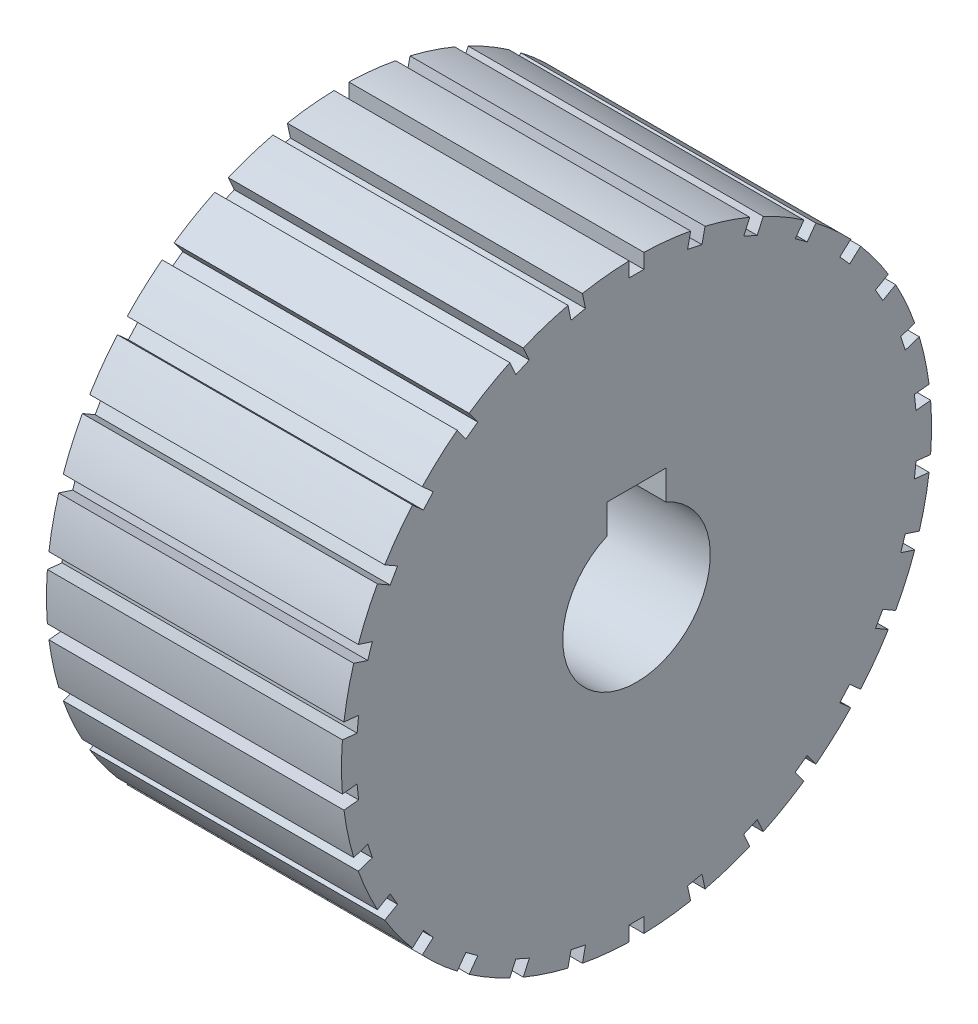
ISO-10303-21;
HEADER;
FILE_DESCRIPTION(('STEP AP214'),'2;1');
FILE_NAME('part.step','',(''),(''),'','','');
FILE_SCHEMA(('AUTOMOTIVE_DESIGN { 1 0 10303 214 1 1 1 1 }'));
ENDSEC;
DATA;
#1=APPLICATION_CONTEXT('core data for automotive mechanical design processes');
#2=APPLICATION_PROTOCOL_DEFINITION('international standard','automotive_design',2000,#1);
#3=PRODUCT_CONTEXT('',#1,'mechanical');
#4=PRODUCT('Part','Part','',(#3));
#5=PRODUCT_RELATED_PRODUCT_CATEGORY('part','',(#4));
#6=PRODUCT_DEFINITION_FORMATION('','',#4);
#7=PRODUCT_DEFINITION_CONTEXT('part definition',#1,'design');
#8=PRODUCT_DEFINITION('design','',#6,#7);
#9=PRODUCT_DEFINITION_SHAPE('','',#8);
#10=(LENGTH_UNIT() NAMED_UNIT(*) SI_UNIT(.MILLI.,.METRE.));
#11=(NAMED_UNIT(*) PLANE_ANGLE_UNIT() SI_UNIT($,.RADIAN.));
#12=(NAMED_UNIT(*) SI_UNIT($,.STERADIAN.) SOLID_ANGLE_UNIT());
#13=UNCERTAINTY_MEASURE_WITH_UNIT(LENGTH_MEASURE(1.E-05),#10,'distance_accuracy_value','');
#14=(GEOMETRIC_REPRESENTATION_CONTEXT(3) GLOBAL_UNCERTAINTY_ASSIGNED_CONTEXT((#13)) GLOBAL_UNIT_ASSIGNED_CONTEXT((#10,
#11,#12)) REPRESENTATION_CONTEXT('',''));
#15=CARTESIAN_POINT('',(0.,0.,0.));
#16=DIRECTION('',(0.,0.,1.));
#17=DIRECTION('',(1.,0.,0.));
#18=AXIS2_PLACEMENT_3D('',#15,#16,#17);
#19=CARTESIAN_POINT('',(-5.,0.,0.));
#20=DIRECTION('',(1.,0.,0.));
#21=DIRECTION('',(0.,0.,-1.));
#22=AXIS2_PLACEMENT_3D('',#19,#20,#21);
#23=CYLINDRICAL_SURFACE('',#22,10.);
#24=DIRECTION('',(1.,0.,0.));
#25=VECTOR('',#24,1.);
#26=CARTESIAN_POINT('',(-5.,9.72644089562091,-2.323003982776));
#27=LINE('',#26,#25);
#28=CARTESIAN_POINT('',(5.,9.72644089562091,-2.323003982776));
#29=VERTEX_POINT('',#28);
#30=CARTESIAN_POINT('',(-5.,9.72644089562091,-2.323003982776));
#31=VERTEX_POINT('',#30);
#32=EDGE_CURVE('E849',#29,#31,#27,.F.);
#33=ORIENTED_EDGE('',*,*,#32,.F.);
#34=CARTESIAN_POINT('',(5.,0.,0.));
#35=DIRECTION('',(1.,0.,0.));
#36=DIRECTION('',(0.,0.,-1.));
#37=AXIS2_PLACEMENT_3D('',#34,#35,#36);
#38=CIRCLE('',#37,10.);
#39=CARTESIAN_POINT('',(5.,9.23428346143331,-3.83770881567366));
#40=VERTEX_POINT('',#39);
#41=EDGE_CURVE('E1712',#40,#29,#38,.T.);
#42=ORIENTED_EDGE('',*,*,#41,.F.);
#43=DIRECTION('',(1.,0.,0.));
#44=VECTOR('',#43,1.);
#45=CARTESIAN_POINT('',(-5.,9.23428346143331,-3.83770881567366));
#46=LINE('',#45,#44);
#47=CARTESIAN_POINT('',(-5.,9.23428346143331,-3.83770881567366));
#48=VERTEX_POINT('',#47);
#49=EDGE_CURVE('E859',#48,#40,#46,.T.);
#50=ORIENTED_EDGE('',*,*,#49,.F.);
#51=CARTESIAN_POINT('',(-5.,0.,0.));
#52=DIRECTION('',(1.,0.,0.));
#53=DIRECTION('',(0.,0.,-1.));
#54=AXIS2_PLACEMENT_3D('',#51,#52,#53);
#55=CIRCLE('',#54,10.);
#56=EDGE_CURVE('E1530',#48,#31,#55,.T.);
#57=ORIENTED_EDGE('',*,*,#56,.T.);
#58=EDGE_LOOP('',(#33,#42,#50,#57));
#59=FACE_BOUND('',#58,.T.);
#60=ADVANCED_FACE('F33',(#59),#23,.T.);
#61=DIRECTION('',(1.,0.,0.));
#62=VECTOR('',#61,1.);
#63=CARTESIAN_POINT('',(-5.,9.03091513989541,-4.29448154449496));
#64=LINE('',#63,#62);
#65=CARTESIAN_POINT('',(5.,9.03091513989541,-4.29448154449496));
#66=VERTEX_POINT('',#65);
#67=CARTESIAN_POINT('',(-5.,9.03091513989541,-4.29448154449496));
#68=VERTEX_POINT('',#67);
#69=EDGE_CURVE('E869',#66,#68,#64,.F.);
#70=ORIENTED_EDGE('',*,*,#69,.F.);
#71=CARTESIAN_POINT('',(5.,8.23458768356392,-5.67376115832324));
#72=VERTEX_POINT('',#71);
#73=EDGE_CURVE('E1516',#72,#66,#38,.T.);
#74=ORIENTED_EDGE('',*,*,#73,.F.);
#75=DIRECTION('',(1.,0.,0.));
#76=VECTOR('',#75,1.);
#77=CARTESIAN_POINT('',(-5.,8.23458768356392,-5.67376115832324));
#78=LINE('',#77,#76);
#79=CARTESIAN_POINT('',(-5.,8.23458768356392,-5.67376115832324));
#80=VERTEX_POINT('',#79);
#81=EDGE_CURVE('E879',#80,#72,#78,.T.);
#82=ORIENTED_EDGE('',*,*,#81,.F.);
#83=EDGE_CURVE('E1526',#80,#68,#55,.T.);
#84=ORIENTED_EDGE('',*,*,#83,.T.);
#85=EDGE_LOOP('',(#70,#74,#82,#84));
#86=FACE_BOUND('',#85,.T.);
#87=ADVANCED_FACE('F1523',(#86),#23,.T.);
#88=DIRECTION('',(1.,0.,0.));
#89=VECTOR('',#88,1.);
#90=CARTESIAN_POINT('',(-5.,7.94069505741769,-6.07826965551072));
#91=LINE('',#90,#89);
#92=CARTESIAN_POINT('',(5.,7.94069505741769,-6.07826965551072));
#93=VERTEX_POINT('',#92);
#94=CARTESIAN_POINT('',(-5.,7.94069505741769,-6.07826965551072));
#95=VERTEX_POINT('',#94);
#96=EDGE_CURVE('E889',#93,#95,#91,.F.);
#97=ORIENTED_EDGE('',*,*,#96,.F.);
#98=CARTESIAN_POINT('',(5.,6.87500090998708,-7.26184291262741));
#99=VERTEX_POINT('',#98);
#100=EDGE_CURVE('E1704',#99,#93,#38,.T.);
#101=ORIENTED_EDGE('',*,*,#100,.F.);
#102=DIRECTION('',(1.,0.,0.));
#103=VECTOR('',#102,1.);
#104=CARTESIAN_POINT('',(-5.,6.87500090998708,-7.26184291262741));
#105=LINE('',#104,#103);
#106=CARTESIAN_POINT('',(-5.,6.87500090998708,-7.26184291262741));
#107=VERTEX_POINT('',#106);
#108=EDGE_CURVE('E899',#107,#99,#105,.T.);
#109=ORIENTED_EDGE('',*,*,#108,.F.);
#110=EDGE_CURVE('E1529',#107,#95,#55,.T.);
#111=ORIENTED_EDGE('',*,*,#110,.T.);
#112=EDGE_LOOP('',(#97,#101,#109,#111));
#113=FACE_BOUND('',#112,.T.);
#114=ADVANCED_FACE('F1726',(#113),#23,.T.);
#115=DIRECTION('',(1.,0.,0.));
#116=VECTOR('',#115,1.);
#117=CARTESIAN_POINT('',(-5.,6.50342849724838,-7.59640821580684));
#118=LINE('',#117,#116);
#119=CARTESIAN_POINT('',(5.,6.50342849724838,-7.59640821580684));
#120=VERTEX_POINT('',#119);
#121=CARTESIAN_POINT('',(-5.,6.50342849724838,-7.59640821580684));
#122=VERTEX_POINT('',#121);
#123=EDGE_CURVE('E909',#120,#122,#118,.F.);
#124=ORIENTED_EDGE('',*,*,#123,.F.);
#125=CARTESIAN_POINT('',(5.,5.21494360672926,-8.53254728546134));
#126=VERTEX_POINT('',#125);
#127=EDGE_CURVE('E1699',#126,#120,#38,.T.);
#128=ORIENTED_EDGE('',*,*,#127,.F.);
#129=DIRECTION('',(1.,0.,0.));
#130=VECTOR('',#129,1.);
#131=CARTESIAN_POINT('',(-5.,5.21494360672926,-8.53254728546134));
#132=LINE('',#131,#130);
#133=CARTESIAN_POINT('',(-5.,5.21494360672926,-8.53254728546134));
#134=VERTEX_POINT('',#133);
#135=EDGE_CURVE('E919',#134,#126,#132,.T.);
#136=ORIENTED_EDGE('',*,*,#135,.F.);
#137=EDGE_CURVE('E1532',#134,#122,#55,.T.);
#138=ORIENTED_EDGE('',*,*,#137,.T.);
#139=EDGE_LOOP('',(#124,#128,#136,#138));
#140=FACE_BOUND('',#139,.T.);
#141=ADVANCED_FACE('F2185',(#140),#23,.T.);
#142=DIRECTION('',(1.,0.,0.));
#143=VECTOR('',#142,1.);
#144=CARTESIAN_POINT('',(-5.,4.78193090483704,-8.78254728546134));
#145=LINE('',#144,#143);
#146=CARTESIAN_POINT('',(5.,4.78193090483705,-8.78254728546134));
#147=VERTEX_POINT('',#146);
#148=CARTESIAN_POINT('',(-5.,4.78193090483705,-8.78254728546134));
#149=VERTEX_POINT('',#148);
#150=EDGE_CURVE('E929',#147,#149,#145,.F.);
#151=ORIENTED_EDGE('',*,*,#150,.F.);
#152=CARTESIAN_POINT('',(5.,3.32696824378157,-9.4303383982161));
#153=VERTEX_POINT('',#152);
#154=EDGE_CURVE('E1694',#153,#147,#38,.T.);
#155=ORIENTED_EDGE('',*,*,#154,.F.);
#156=DIRECTION('',(1.,0.,0.));
#157=VECTOR('',#156,1.);
#158=CARTESIAN_POINT('',(-5.,3.32696824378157,-9.4303383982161));
#159=LINE('',#158,#157);
#160=CARTESIAN_POINT('',(-5.,3.32696824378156,-9.4303383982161));
#161=VERTEX_POINT('',#160);
#162=EDGE_CURVE('E939',#161,#153,#159,.T.);
#163=ORIENTED_EDGE('',*,*,#162,.F.);
#164=EDGE_CURVE('E2168',#161,#149,#55,.T.);
#165=ORIENTED_EDGE('',*,*,#164,.T.);
#166=EDGE_LOOP('',(#151,#155,#163,#165));
#167=FACE_BOUND('',#166,.T.);
#168=ADVANCED_FACE('F2166',(#167),#23,.T.);
#169=DIRECTION('',(1.,0.,0.));
#170=VECTOR('',#169,1.);
#171=CARTESIAN_POINT('',(-5.,2.85143998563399,-9.58484689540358));
#172=LINE('',#171,#170);
#173=CARTESIAN_POINT('',(5.,2.85143998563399,-9.58484689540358));
#174=VERTEX_POINT('',#173);
#175=CARTESIAN_POINT('',(-5.,2.85143998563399,-9.58484689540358));
#176=VERTEX_POINT('',#175);
#177=EDGE_CURVE('E949',#174,#176,#172,.F.);
#178=ORIENTED_EDGE('',*,*,#177,.F.);
#179=CARTESIAN_POINT('',(5.,1.29358840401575,-9.91597847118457));
#180=VERTEX_POINT('',#179);
#181=EDGE_CURVE('E1689',#180,#174,#38,.T.);
#182=ORIENTED_EDGE('',*,*,#181,.F.);
#183=DIRECTION('',(1.,0.,0.));
#184=VECTOR('',#183,1.);
#185=CARTESIAN_POINT('',(-5.,1.29358840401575,-9.91597847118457));
#186=LINE('',#185,#184);
#187=CARTESIAN_POINT('',(-5.,1.29358840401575,-9.91597847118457));
#188=VERTEX_POINT('',#187);
#189=EDGE_CURVE('E959',#188,#180,#186,.T.);
#190=ORIENTED_EDGE('',*,*,#189,.F.);
#191=EDGE_CURVE('E2149',#188,#176,#55,.T.);
#192=ORIENTED_EDGE('',*,*,#191,.T.);
#193=EDGE_LOOP('',(#178,#182,#190,#192));
#194=FACE_BOUND('',#193,.T.);
#195=ADVANCED_FACE('F2147',(#194),#23,.T.);
#196=DIRECTION('',(1.,0.,0.));
#197=VECTOR('',#196,1.);
#198=CARTESIAN_POINT('',(-5.,0.796327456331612,-9.96824270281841));
#199=LINE('',#198,#197);
#200=CARTESIAN_POINT('',(5.,0.796327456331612,-9.96824270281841));
#201=VERTEX_POINT('',#200);
#202=CARTESIAN_POINT('',(-5.,0.796327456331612,-9.96824270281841));
#203=VERTEX_POINT('',#202);
#204=EDGE_CURVE('E969',#201,#203,#199,.F.);
#205=ORIENTED_EDGE('',*,*,#204,.F.);
#206=CARTESIAN_POINT('',(5.,-0.796327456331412,-9.96824270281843));
#207=VERTEX_POINT('',#206);
#208=EDGE_CURVE('E1684',#207,#201,#38,.T.);
#209=ORIENTED_EDGE('',*,*,#208,.F.);
#210=DIRECTION('',(1.,0.,0.));
#211=VECTOR('',#210,1.);
#212=CARTESIAN_POINT('',(-5.,-0.796327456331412,-9.96824270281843));
#213=LINE('',#212,#211);
#214=CARTESIAN_POINT('',(-5.,-0.796327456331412,-9.96824270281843));
#215=VERTEX_POINT('',#214);
#216=EDGE_CURVE('E979',#215,#207,#213,.T.);
#217=ORIENTED_EDGE('',*,*,#216,.F.);
#218=EDGE_CURVE('E2130',#215,#203,#55,.T.);
#219=ORIENTED_EDGE('',*,*,#218,.T.);
#220=EDGE_LOOP('',(#205,#209,#217,#219));
#221=FACE_BOUND('',#220,.T.);
#222=ADVANCED_FACE('F2128',(#221),#23,.T.);
#223=DIRECTION('',(1.,0.,0.));
#224=VECTOR('',#223,1.);
#225=CARTESIAN_POINT('',(-5.,-1.29358840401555,-9.9159784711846));
#226=LINE('',#225,#224);
#227=CARTESIAN_POINT('',(5.,-1.29358840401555,-9.9159784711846));
#228=VERTEX_POINT('',#227);
#229=CARTESIAN_POINT('',(-5.,-1.29358840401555,-9.9159784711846));
#230=VERTEX_POINT('',#229);
#231=EDGE_CURVE('E989',#228,#230,#226,.F.);
#232=ORIENTED_EDGE('',*,*,#231,.F.);
#233=CARTESIAN_POINT('',(5.,-2.8514399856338,-9.58484689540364));
#234=VERTEX_POINT('',#233);
#235=EDGE_CURVE('E1679',#234,#228,#38,.T.);
#236=ORIENTED_EDGE('',*,*,#235,.F.);
#237=DIRECTION('',(1.,0.,0.));
#238=VECTOR('',#237,1.);
#239=CARTESIAN_POINT('',(-5.,-2.8514399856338,-9.58484689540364));
#240=LINE('',#239,#238);
#241=CARTESIAN_POINT('',(-5.,-2.8514399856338,-9.58484689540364));
#242=VERTEX_POINT('',#241);
#243=EDGE_CURVE('E999',#242,#234,#240,.T.);
#244=ORIENTED_EDGE('',*,*,#243,.F.);
#245=EDGE_CURVE('E2111',#242,#230,#55,.T.);
#246=ORIENTED_EDGE('',*,*,#245,.T.);
#247=EDGE_LOOP('',(#232,#236,#244,#246));
#248=FACE_BOUND('',#247,.T.);
#249=ADVANCED_FACE('F2109',(#248),#23,.T.);
#250=DIRECTION('',(1.,0.,0.));
#251=VECTOR('',#250,1.);
#252=CARTESIAN_POINT('',(-5.,-3.32696824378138,-9.43033839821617));
#253=LINE('',#252,#251);
#254=CARTESIAN_POINT('',(5.,-3.32696824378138,-9.43033839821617));
#255=VERTEX_POINT('',#254);
#256=CARTESIAN_POINT('',(-5.,-3.32696824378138,-9.43033839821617));
#257=VERTEX_POINT('',#256);
#258=EDGE_CURVE('E1009',#255,#257,#253,.F.);
#259=ORIENTED_EDGE('',*,*,#258,.F.);
#260=CARTESIAN_POINT('',(5.,-4.78193090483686,-8.78254728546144));
#261=VERTEX_POINT('',#260);
#262=EDGE_CURVE('E1674',#261,#255,#38,.T.);
#263=ORIENTED_EDGE('',*,*,#262,.F.);
#264=DIRECTION('',(1.,0.,0.));
#265=VECTOR('',#264,1.);
#266=CARTESIAN_POINT('',(-5.,-4.78193090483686,-8.78254728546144));
#267=LINE('',#266,#265);
#268=CARTESIAN_POINT('',(-5.,-4.78193090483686,-8.78254728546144));
#269=VERTEX_POINT('',#268);
#270=EDGE_CURVE('E1019',#269,#261,#267,.T.);
#271=ORIENTED_EDGE('',*,*,#270,.F.);
#272=EDGE_CURVE('E2092',#269,#257,#55,.T.);
#273=ORIENTED_EDGE('',*,*,#272,.T.);
#274=EDGE_LOOP('',(#259,#263,#271,#273));
#275=FACE_BOUND('',#274,.T.);
#276=ADVANCED_FACE('F2090',(#275),#23,.T.);
#277=DIRECTION('',(1.,0.,0.));
#278=VECTOR('',#277,1.);
#279=CARTESIAN_POINT('',(-5.,-5.21494360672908,-8.53254728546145));
#280=LINE('',#279,#278);
#281=CARTESIAN_POINT('',(5.,-5.21494360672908,-8.53254728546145));
#282=VERTEX_POINT('',#281);
#283=CARTESIAN_POINT('',(-5.,-5.21494360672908,-8.53254728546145));
#284=VERTEX_POINT('',#283);
#285=EDGE_CURVE('E1029',#282,#284,#280,.F.);
#286=ORIENTED_EDGE('',*,*,#285,.F.);
#287=CARTESIAN_POINT('',(5.,-6.50342849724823,-7.59640821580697));
#288=VERTEX_POINT('',#287);
#289=EDGE_CURVE('E1669',#288,#282,#38,.T.);
#290=ORIENTED_EDGE('',*,*,#289,.F.);
#291=DIRECTION('',(1.,0.,0.));
#292=VECTOR('',#291,1.);
#293=CARTESIAN_POINT('',(-5.,-6.50342849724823,-7.59640821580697));
#294=LINE('',#293,#292);
#295=CARTESIAN_POINT('',(-5.,-6.50342849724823,-7.59640821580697));
#296=VERTEX_POINT('',#295);
#297=EDGE_CURVE('E1039',#296,#288,#294,.T.);
#298=ORIENTED_EDGE('',*,*,#297,.F.);
#299=EDGE_CURVE('E2073',#296,#284,#55,.T.);
#300=ORIENTED_EDGE('',*,*,#299,.T.);
#301=EDGE_LOOP('',(#286,#290,#298,#300));
#302=FACE_BOUND('',#301,.T.);
#303=ADVANCED_FACE('F2071',(#302),#23,.T.);
#304=DIRECTION('',(1.,0.,0.));
#305=VECTOR('',#304,1.);
#306=CARTESIAN_POINT('',(-5.,-6.87500090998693,-7.26184291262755));
#307=LINE('',#306,#305);
#308=CARTESIAN_POINT('',(5.,-6.87500090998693,-7.26184291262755));
#309=VERTEX_POINT('',#308);
#310=CARTESIAN_POINT('',(-5.,-6.87500090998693,-7.26184291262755));
#311=VERTEX_POINT('',#310);
#312=EDGE_CURVE('E1049',#309,#311,#307,.F.);
#313=ORIENTED_EDGE('',*,*,#312,.F.);
#314=CARTESIAN_POINT('',(5.,-7.94069505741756,-6.07826965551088));
#315=VERTEX_POINT('',#314);
#316=EDGE_CURVE('E1664',#315,#309,#38,.T.);
#317=ORIENTED_EDGE('',*,*,#316,.F.);
#318=DIRECTION('',(1.,0.,0.));
#319=VECTOR('',#318,1.);
#320=CARTESIAN_POINT('',(-5.,-7.94069505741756,-6.07826965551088));
#321=LINE('',#320,#319);
#322=CARTESIAN_POINT('',(-5.,-7.94069505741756,-6.07826965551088));
#323=VERTEX_POINT('',#322);
#324=EDGE_CURVE('E1059',#323,#315,#321,.T.);
#325=ORIENTED_EDGE('',*,*,#324,.F.);
#326=EDGE_CURVE('E2054',#323,#311,#55,.T.);
#327=ORIENTED_EDGE('',*,*,#326,.T.);
#328=EDGE_LOOP('',(#313,#317,#325,#327));
#329=FACE_BOUND('',#328,.T.);
#330=ADVANCED_FACE('F2052',(#329),#23,.T.);
#331=DIRECTION('',(1.,0.,0.));
#332=VECTOR('',#331,1.);
#333=CARTESIAN_POINT('',(-5.,-8.2345876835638,-5.67376115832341));
#334=LINE('',#333,#332);
#335=CARTESIAN_POINT('',(5.,-8.2345876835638,-5.67376115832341));
#336=VERTEX_POINT('',#335);
#337=CARTESIAN_POINT('',(-5.,-8.2345876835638,-5.67376115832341));
#338=VERTEX_POINT('',#337);
#339=EDGE_CURVE('E1069',#336,#338,#334,.F.);
#340=ORIENTED_EDGE('',*,*,#339,.F.);
#341=CARTESIAN_POINT('',(5.,-9.03091513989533,-4.29448154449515));
#342=VERTEX_POINT('',#341);
#343=EDGE_CURVE('E1659',#342,#336,#38,.T.);
#344=ORIENTED_EDGE('',*,*,#343,.F.);
#345=DIRECTION('',(1.,0.,0.));
#346=VECTOR('',#345,1.);
#347=CARTESIAN_POINT('',(-5.,-9.03091513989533,-4.29448154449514));
#348=LINE('',#347,#346);
#349=CARTESIAN_POINT('',(-5.,-9.03091513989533,-4.29448154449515));
#350=VERTEX_POINT('',#349);
#351=EDGE_CURVE('E1079',#350,#342,#348,.T.);
#352=ORIENTED_EDGE('',*,*,#351,.F.);
#353=EDGE_CURVE('E2035',#350,#338,#55,.T.);
#354=ORIENTED_EDGE('',*,*,#353,.T.);
#355=EDGE_LOOP('',(#340,#344,#352,#354));
#356=FACE_BOUND('',#355,.T.);
#357=ADVANCED_FACE('F2033',(#356),#23,.T.);
#358=DIRECTION('',(1.,0.,0.));
#359=VECTOR('',#358,1.);
#360=CARTESIAN_POINT('',(-5.,-9.23428346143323,-3.83770881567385));
#361=LINE('',#360,#359);
#362=CARTESIAN_POINT('',(5.,-9.23428346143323,-3.83770881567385));
#363=VERTEX_POINT('',#362);
#364=CARTESIAN_POINT('',(-5.,-9.23428346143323,-3.83770881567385));
#365=VERTEX_POINT('',#364);
#366=EDGE_CURVE('E1089',#363,#365,#361,.F.);
#367=ORIENTED_EDGE('',*,*,#366,.F.);
#368=CARTESIAN_POINT('',(5.,-9.72644089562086,-2.32300398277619));
#369=VERTEX_POINT('',#368);
#370=EDGE_CURVE('E1654',#369,#363,#38,.T.);
#371=ORIENTED_EDGE('',*,*,#370,.F.);
#372=DIRECTION('',(1.,0.,0.));
#373=VECTOR('',#372,1.);
#374=CARTESIAN_POINT('',(-5.,-9.72644089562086,-2.32300398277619));
#375=LINE('',#374,#373);
#376=CARTESIAN_POINT('',(-5.,-9.72644089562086,-2.32300398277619));
#377=VERTEX_POINT('',#376);
#378=EDGE_CURVE('E1099',#377,#369,#375,.T.);
#379=ORIENTED_EDGE('',*,*,#378,.F.);
#380=EDGE_CURVE('E2016',#377,#365,#55,.T.);
#381=ORIENTED_EDGE('',*,*,#380,.T.);
#382=EDGE_LOOP('',(#367,#371,#379,#381));
#383=FACE_BOUND('',#382,.T.);
#384=ADVANCED_FACE('F2014',(#383),#23,.T.);
#385=DIRECTION('',(1.,0.,0.));
#386=VECTOR('',#385,1.);
#387=CARTESIAN_POINT('',(-5.,-9.83039674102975,-1.83393018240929));
#388=LINE('',#387,#386);
#389=CARTESIAN_POINT('',(5.,-9.83039674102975,-1.83393018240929));
#390=VERTEX_POINT('',#389);
#391=CARTESIAN_POINT('',(-5.,-9.83039674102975,-1.83393018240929));
#392=VERTEX_POINT('',#391);
#393=EDGE_CURVE('E1109',#390,#392,#388,.F.);
#394=ORIENTED_EDGE('',*,*,#393,.F.);
#395=CARTESIAN_POINT('',(5.,-9.9968745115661,-0.25));
#396=VERTEX_POINT('',#395);
#397=EDGE_CURVE('E1649',#396,#390,#38,.T.);
#398=ORIENTED_EDGE('',*,*,#397,.F.);
#399=DIRECTION('',(1.,0.,0.));
#400=VECTOR('',#399,1.);
#401=CARTESIAN_POINT('',(-5.,-9.9968745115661,-0.25));
#402=LINE('',#401,#400);
#403=CARTESIAN_POINT('',(-5.,-9.9968745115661,-0.25));
#404=VERTEX_POINT('',#403);
#405=EDGE_CURVE('E1119',#404,#396,#402,.T.);
#406=ORIENTED_EDGE('',*,*,#405,.F.);
#407=EDGE_CURVE('E1997',#404,#392,#55,.T.);
#408=ORIENTED_EDGE('',*,*,#407,.T.);
#409=EDGE_LOOP('',(#394,#398,#406,#408));
#410=FACE_BOUND('',#409,.T.);
#411=ADVANCED_FACE('F1995',(#410),#23,.T.);
#412=DIRECTION('',(1.,0.,0.));
#413=VECTOR('',#412,1.);
#414=CARTESIAN_POINT('',(-5.,-9.9968745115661,0.25));
#415=LINE('',#414,#413);
#416=CARTESIAN_POINT('',(5.,-9.9968745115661,0.25));
#417=VERTEX_POINT('',#416);
#418=CARTESIAN_POINT('',(-5.,-9.9968745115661,0.25));
#419=VERTEX_POINT('',#418);
#420=EDGE_CURVE('E1129',#417,#419,#415,.F.);
#421=ORIENTED_EDGE('',*,*,#420,.F.);
#422=CARTESIAN_POINT('',(5.,-9.83039674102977,1.83393018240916));
#423=VERTEX_POINT('',#422);
#424=EDGE_CURVE('E1644',#423,#417,#38,.T.);
#425=ORIENTED_EDGE('',*,*,#424,.F.);
#426=DIRECTION('',(1.,0.,0.));
#427=VECTOR('',#426,1.);
#428=CARTESIAN_POINT('',(-5.,-9.83039674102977,1.83393018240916));
#429=LINE('',#428,#427);
#430=CARTESIAN_POINT('',(-5.,-9.83039674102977,1.83393018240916));
#431=VERTEX_POINT('',#430);
#432=EDGE_CURVE('E1139',#431,#423,#429,.T.);
#433=ORIENTED_EDGE('',*,*,#432,.F.);
#434=EDGE_CURVE('E1978',#431,#419,#55,.T.);
#435=ORIENTED_EDGE('',*,*,#434,.T.);
#436=EDGE_LOOP('',(#421,#425,#433,#435));
#437=FACE_BOUND('',#436,.T.);
#438=ADVANCED_FACE('F1976',(#437),#23,.T.);
#439=DIRECTION('',(1.,0.,0.));
#440=VECTOR('',#439,1.);
#441=CARTESIAN_POINT('',(-5.,-9.72644089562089,2.32300398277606));
#442=LINE('',#441,#440);
#443=CARTESIAN_POINT('',(5.,-9.72644089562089,2.32300398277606));
#444=VERTEX_POINT('',#443);
#445=CARTESIAN_POINT('',(-5.,-9.72644089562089,2.32300398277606));
#446=VERTEX_POINT('',#445);
#447=EDGE_CURVE('E1149',#444,#446,#442,.F.);
#448=ORIENTED_EDGE('',*,*,#447,.F.);
#449=CARTESIAN_POINT('',(5.,-9.23428346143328,3.83770881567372));
#450=VERTEX_POINT('',#449);
#451=EDGE_CURVE('E1639',#450,#444,#38,.T.);
#452=ORIENTED_EDGE('',*,*,#451,.F.);
#453=DIRECTION('',(1.,0.,0.));
#454=VECTOR('',#453,1.);
#455=CARTESIAN_POINT('',(-5.,-9.23428346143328,3.83770881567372));
#456=LINE('',#455,#454);
#457=CARTESIAN_POINT('',(-5.,-9.23428346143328,3.83770881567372));
#458=VERTEX_POINT('',#457);
#459=EDGE_CURVE('E1159',#458,#450,#456,.T.);
#460=ORIENTED_EDGE('',*,*,#459,.F.);
#461=EDGE_CURVE('E1959',#458,#446,#55,.T.);
#462=ORIENTED_EDGE('',*,*,#461,.T.);
#463=EDGE_LOOP('',(#448,#452,#460,#462));
#464=FACE_BOUND('',#463,.T.);
#465=ADVANCED_FACE('F1957',(#464),#23,.T.);
#466=DIRECTION('',(1.,0.,0.));
#467=VECTOR('',#466,1.);
#468=CARTESIAN_POINT('',(-5.,-9.03091513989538,4.29448154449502));
#469=LINE('',#468,#467);
#470=CARTESIAN_POINT('',(5.,-9.03091513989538,4.29448154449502));
#471=VERTEX_POINT('',#470);
#472=CARTESIAN_POINT('',(-5.,-9.03091513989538,4.29448154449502));
#473=VERTEX_POINT('',#472);
#474=EDGE_CURVE('E1169',#471,#473,#469,.F.);
#475=ORIENTED_EDGE('',*,*,#474,.F.);
#476=CARTESIAN_POINT('',(5.,-8.23458768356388,5.6737611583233));
#477=VERTEX_POINT('',#476);
#478=EDGE_CURVE('E1634',#477,#471,#38,.T.);
#479=ORIENTED_EDGE('',*,*,#478,.F.);
#480=DIRECTION('',(1.,0.,0.));
#481=VECTOR('',#480,1.);
#482=CARTESIAN_POINT('',(-5.,-8.23458768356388,5.6737611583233));
#483=LINE('',#482,#481);
#484=CARTESIAN_POINT('',(-5.,-8.23458768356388,5.6737611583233));
#485=VERTEX_POINT('',#484);
#486=EDGE_CURVE('E1179',#485,#477,#483,.T.);
#487=ORIENTED_EDGE('',*,*,#486,.F.);
#488=EDGE_CURVE('E1940',#485,#473,#55,.T.);
#489=ORIENTED_EDGE('',*,*,#488,.T.);
#490=EDGE_LOOP('',(#475,#479,#487,#489));
#491=FACE_BOUND('',#490,.T.);
#492=ADVANCED_FACE('F1938',(#491),#23,.T.);
#493=DIRECTION('',(1.,0.,0.));
#494=VECTOR('',#493,1.);
#495=CARTESIAN_POINT('',(-5.,-7.94069505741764,6.07826965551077));
#496=LINE('',#495,#494);
#497=CARTESIAN_POINT('',(5.,-7.94069505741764,6.07826965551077));
#498=VERTEX_POINT('',#497);
#499=CARTESIAN_POINT('',(-5.,-7.94069505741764,6.07826965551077));
#500=VERTEX_POINT('',#499);
#501=EDGE_CURVE('E1189',#498,#500,#496,.F.);
#502=ORIENTED_EDGE('',*,*,#501,.F.);
#503=CARTESIAN_POINT('',(5.,-6.87500090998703,7.26184291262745));
#504=VERTEX_POINT('',#503);
#505=EDGE_CURVE('E1629',#504,#498,#38,.T.);
#506=ORIENTED_EDGE('',*,*,#505,.F.);
#507=DIRECTION('',(1.,0.,0.));
#508=VECTOR('',#507,1.);
#509=CARTESIAN_POINT('',(-5.,-6.87500090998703,7.26184291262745));
#510=LINE('',#509,#508);
#511=CARTESIAN_POINT('',(-5.,-6.87500090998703,7.26184291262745));
#512=VERTEX_POINT('',#511);
#513=EDGE_CURVE('E1199',#512,#504,#510,.T.);
#514=ORIENTED_EDGE('',*,*,#513,.F.);
#515=EDGE_CURVE('E1921',#512,#500,#55,.T.);
#516=ORIENTED_EDGE('',*,*,#515,.T.);
#517=EDGE_LOOP('',(#502,#506,#514,#516));
#518=FACE_BOUND('',#517,.T.);
#519=ADVANCED_FACE('F1919',(#518),#23,.T.);
#520=DIRECTION('',(1.,0.,0.));
#521=VECTOR('',#520,1.);
#522=CARTESIAN_POINT('',(-5.,-6.50342849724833,7.59640821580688));
#523=LINE('',#522,#521);
#524=CARTESIAN_POINT('',(5.,-6.50342849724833,7.59640821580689));
#525=VERTEX_POINT('',#524);
#526=CARTESIAN_POINT('',(-5.,-6.50342849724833,7.59640821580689));
#527=VERTEX_POINT('',#526);
#528=EDGE_CURVE('E1209',#525,#527,#523,.F.);
#529=ORIENTED_EDGE('',*,*,#528,.F.);
#530=CARTESIAN_POINT('',(5.,-5.2149436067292,8.53254728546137));
#531=VERTEX_POINT('',#530);
#532=EDGE_CURVE('E1624',#531,#525,#38,.T.);
#533=ORIENTED_EDGE('',*,*,#532,.F.);
#534=DIRECTION('',(1.,0.,0.));
#535=VECTOR('',#534,1.);
#536=CARTESIAN_POINT('',(-5.,-5.2149436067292,8.53254728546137));
#537=LINE('',#536,#535);
#538=CARTESIAN_POINT('',(-5.,-5.2149436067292,8.53254728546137));
#539=VERTEX_POINT('',#538);
#540=EDGE_CURVE('E1219',#539,#531,#537,.T.);
#541=ORIENTED_EDGE('',*,*,#540,.F.);
#542=EDGE_CURVE('E1902',#539,#527,#55,.T.);
#543=ORIENTED_EDGE('',*,*,#542,.T.);
#544=EDGE_LOOP('',(#529,#533,#541,#543));
#545=FACE_BOUND('',#544,.T.);
#546=ADVANCED_FACE('F1900',(#545),#23,.T.);
#547=DIRECTION('',(1.,0.,0.));
#548=VECTOR('',#547,1.);
#549=CARTESIAN_POINT('',(-5.,-4.78193090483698,8.78254728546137));
#550=LINE('',#549,#548);
#551=CARTESIAN_POINT('',(5.,-4.78193090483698,8.78254728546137));
#552=VERTEX_POINT('',#551);
#553=CARTESIAN_POINT('',(-5.,-4.78193090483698,8.78254728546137));
#554=VERTEX_POINT('',#553);
#555=EDGE_CURVE('E1229',#552,#554,#550,.F.);
#556=ORIENTED_EDGE('',*,*,#555,.F.);
#557=CARTESIAN_POINT('',(5.,-3.32696824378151,9.43033839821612));
#558=VERTEX_POINT('',#557);
#559=EDGE_CURVE('E1619',#558,#552,#38,.T.);
#560=ORIENTED_EDGE('',*,*,#559,.F.);
#561=DIRECTION('',(1.,0.,0.));
#562=VECTOR('',#561,1.);
#563=CARTESIAN_POINT('',(-5.,-3.32696824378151,9.43033839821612));
#564=LINE('',#563,#562);
#565=CARTESIAN_POINT('',(-5.,-3.32696824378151,9.43033839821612));
#566=VERTEX_POINT('',#565);
#567=EDGE_CURVE('E1239',#566,#558,#564,.T.);
#568=ORIENTED_EDGE('',*,*,#567,.F.);
#569=EDGE_CURVE('E1883',#566,#554,#55,.T.);
#570=ORIENTED_EDGE('',*,*,#569,.T.);
#571=EDGE_LOOP('',(#556,#560,#568,#570));
#572=FACE_BOUND('',#571,.T.);
#573=ADVANCED_FACE('F1881',(#572),#23,.T.);
#574=DIRECTION('',(1.,0.,0.));
#575=VECTOR('',#574,1.);
#576=CARTESIAN_POINT('',(-5.,-2.85143998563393,9.5848468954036));
#577=LINE('',#576,#575);
#578=CARTESIAN_POINT('',(5.,-2.85143998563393,9.5848468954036));
#579=VERTEX_POINT('',#578);
#580=CARTESIAN_POINT('',(-5.,-2.85143998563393,9.5848468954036));
#581=VERTEX_POINT('',#580);
#582=EDGE_CURVE('E1249',#579,#581,#577,.F.);
#583=ORIENTED_EDGE('',*,*,#582,.F.);
#584=CARTESIAN_POINT('',(5.,-1.29358840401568,9.91597847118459));
#585=VERTEX_POINT('',#584);
#586=EDGE_CURVE('E1614',#585,#579,#38,.T.);
#587=ORIENTED_EDGE('',*,*,#586,.F.);
#588=DIRECTION('',(1.,0.,0.));
#589=VECTOR('',#588,1.);
#590=CARTESIAN_POINT('',(-5.,-1.29358840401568,9.91597847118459));
#591=LINE('',#590,#589);
#592=CARTESIAN_POINT('',(-5.,-1.29358840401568,9.91597847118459));
#593=VERTEX_POINT('',#592);
#594=EDGE_CURVE('E1259',#593,#585,#591,.T.);
#595=ORIENTED_EDGE('',*,*,#594,.F.);
#596=EDGE_CURVE('E1864',#593,#581,#55,.T.);
#597=ORIENTED_EDGE('',*,*,#596,.T.);
#598=EDGE_LOOP('',(#583,#587,#595,#597));
#599=FACE_BOUND('',#598,.T.);
#600=ADVANCED_FACE('F1862',(#599),#23,.T.);
#601=DIRECTION('',(1.,0.,0.));
#602=VECTOR('',#601,1.);
#603=CARTESIAN_POINT('',(-5.,-0.796327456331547,9.96824270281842));
#604=LINE('',#603,#602);
#605=CARTESIAN_POINT('',(5.,-0.796327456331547,9.96824270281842));
#606=VERTEX_POINT('',#605);
#607=CARTESIAN_POINT('',(-5.,-0.796327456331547,9.96824270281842));
#608=VERTEX_POINT('',#607);
#609=EDGE_CURVE('E1269',#606,#608,#604,.F.);
#610=ORIENTED_EDGE('',*,*,#609,.F.);
#611=CARTESIAN_POINT('',(5.,0.796327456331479,9.96824270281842));
#612=VERTEX_POINT('',#611);
#613=EDGE_CURVE('E1609',#612,#606,#38,.T.);
#614=ORIENTED_EDGE('',*,*,#613,.F.);
#615=DIRECTION('',(1.,0.,0.));
#616=VECTOR('',#615,1.);
#617=CARTESIAN_POINT('',(-5.,0.796327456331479,9.96824270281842));
#618=LINE('',#617,#616);
#619=CARTESIAN_POINT('',(-5.,0.796327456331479,9.96824270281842));
#620=VERTEX_POINT('',#619);
#621=EDGE_CURVE('E1279',#620,#612,#618,.T.);
#622=ORIENTED_EDGE('',*,*,#621,.F.);
#623=EDGE_CURVE('E1845',#620,#608,#55,.T.);
#624=ORIENTED_EDGE('',*,*,#623,.T.);
#625=EDGE_LOOP('',(#610,#614,#622,#624));
#626=FACE_BOUND('',#625,.T.);
#627=ADVANCED_FACE('F1843',(#626),#23,.T.);
#628=DIRECTION('',(1.,0.,0.));
#629=VECTOR('',#628,1.);
#630=CARTESIAN_POINT('',(-5.,1.29358840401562,9.91597847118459));
#631=LINE('',#630,#629);
#632=CARTESIAN_POINT('',(5.,1.29358840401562,9.91597847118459));
#633=VERTEX_POINT('',#632);
#634=CARTESIAN_POINT('',(-5.,1.29358840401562,9.91597847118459));
#635=VERTEX_POINT('',#634);
#636=EDGE_CURVE('E1289',#633,#635,#631,.F.);
#637=ORIENTED_EDGE('',*,*,#636,.F.);
#638=CARTESIAN_POINT('',(5.,2.85143998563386,9.58484689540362));
#639=VERTEX_POINT('',#638);
#640=EDGE_CURVE('E1604',#639,#633,#38,.T.);
#641=ORIENTED_EDGE('',*,*,#640,.F.);
#642=DIRECTION('',(1.,0.,0.));
#643=VECTOR('',#642,1.);
#644=CARTESIAN_POINT('',(-5.,2.85143998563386,9.58484689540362));
#645=LINE('',#644,#643);
#646=CARTESIAN_POINT('',(-5.,2.85143998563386,9.58484689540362));
#647=VERTEX_POINT('',#646);
#648=EDGE_CURVE('E1299',#647,#639,#645,.T.);
#649=ORIENTED_EDGE('',*,*,#648,.F.);
#650=EDGE_CURVE('E1826',#647,#635,#55,.T.);
#651=ORIENTED_EDGE('',*,*,#650,.T.);
#652=EDGE_LOOP('',(#637,#641,#649,#651));
#653=FACE_BOUND('',#652,.T.);
#654=ADVANCED_FACE('F1824',(#653),#23,.T.);
#655=DIRECTION('',(1.,0.,0.));
#656=VECTOR('',#655,1.);
#657=CARTESIAN_POINT('',(-5.,3.32696824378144,9.43033839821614));
#658=LINE('',#657,#656);
#659=CARTESIAN_POINT('',(5.,3.32696824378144,9.43033839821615));
#660=VERTEX_POINT('',#659);
#661=CARTESIAN_POINT('',(-5.,3.32696824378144,9.43033839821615));
#662=VERTEX_POINT('',#661);
#663=EDGE_CURVE('E1309',#660,#662,#658,.F.);
#664=ORIENTED_EDGE('',*,*,#663,.F.);
#665=CARTESIAN_POINT('',(5.,4.78193090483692,8.78254728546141));
#666=VERTEX_POINT('',#665);
#667=EDGE_CURVE('E1599',#666,#660,#38,.T.);
#668=ORIENTED_EDGE('',*,*,#667,.F.);
#669=DIRECTION('',(1.,0.,0.));
#670=VECTOR('',#669,1.);
#671=CARTESIAN_POINT('',(-5.,4.78193090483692,8.78254728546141));
#672=LINE('',#671,#670);
#673=CARTESIAN_POINT('',(-5.,4.78193090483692,8.78254728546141));
#674=VERTEX_POINT('',#673);
#675=EDGE_CURVE('E1319',#674,#666,#672,.T.);
#676=ORIENTED_EDGE('',*,*,#675,.F.);
#677=EDGE_CURVE('E1807',#674,#662,#55,.T.);
#678=ORIENTED_EDGE('',*,*,#677,.T.);
#679=EDGE_LOOP('',(#664,#668,#676,#678));
#680=FACE_BOUND('',#679,.T.);
#681=ADVANCED_FACE('F1805',(#680),#23,.T.);
#682=DIRECTION('',(1.,0.,0.));
#683=VECTOR('',#682,1.);
#684=CARTESIAN_POINT('',(-5.,5.21494360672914,8.53254728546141));
#685=LINE('',#684,#683);
#686=CARTESIAN_POINT('',(5.,5.21494360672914,8.53254728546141));
#687=VERTEX_POINT('',#686);
#688=CARTESIAN_POINT('',(-5.,5.21494360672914,8.53254728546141));
#689=VERTEX_POINT('',#688);
#690=EDGE_CURVE('E1329',#687,#689,#685,.F.);
#691=ORIENTED_EDGE('',*,*,#690,.F.);
#692=CARTESIAN_POINT('',(5.,6.50342849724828,7.59640821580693));
#693=VERTEX_POINT('',#692);
#694=EDGE_CURVE('E1594',#693,#687,#38,.T.);
#695=ORIENTED_EDGE('',*,*,#694,.F.);
#696=DIRECTION('',(1.,0.,0.));
#697=VECTOR('',#696,1.);
#698=CARTESIAN_POINT('',(-5.,6.50342849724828,7.59640821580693));
#699=LINE('',#698,#697);
#700=CARTESIAN_POINT('',(-5.,6.50342849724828,7.59640821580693));
#701=VERTEX_POINT('',#700);
#702=EDGE_CURVE('E1339',#701,#693,#699,.T.);
#703=ORIENTED_EDGE('',*,*,#702,.F.);
#704=EDGE_CURVE('E1788',#701,#689,#55,.T.);
#705=ORIENTED_EDGE('',*,*,#704,.T.);
#706=EDGE_LOOP('',(#691,#695,#703,#705));
#707=FACE_BOUND('',#706,.T.);
#708=ADVANCED_FACE('F1746',(#707),#23,.T.);
#709=DIRECTION('',(1.,0.,0.));
#710=VECTOR('',#709,1.);
#711=CARTESIAN_POINT('',(-5.,6.87500090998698,7.2618429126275));
#712=LINE('',#711,#710);
#713=CARTESIAN_POINT('',(5.,6.87500090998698,7.2618429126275));
#714=VERTEX_POINT('',#713);
#715=CARTESIAN_POINT('',(-5.,6.87500090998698,7.2618429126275));
#716=VERTEX_POINT('',#715);
#717=EDGE_CURVE('E1349',#714,#716,#712,.F.);
#718=ORIENTED_EDGE('',*,*,#717,.F.);
#719=CARTESIAN_POINT('',(5.,7.9406950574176,6.07826965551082));
#720=VERTEX_POINT('',#719);
#721=EDGE_CURVE('E1589',#720,#714,#38,.T.);
#722=ORIENTED_EDGE('',*,*,#721,.F.);
#723=DIRECTION('',(1.,0.,0.));
#724=VECTOR('',#723,1.);
#725=CARTESIAN_POINT('',(-5.,7.9406950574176,6.07826965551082));
#726=LINE('',#725,#724);
#727=CARTESIAN_POINT('',(-5.,7.9406950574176,6.07826965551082));
#728=VERTEX_POINT('',#727);
#729=EDGE_CURVE('E1359',#728,#720,#726,.T.);
#730=ORIENTED_EDGE('',*,*,#729,.F.);
#731=EDGE_CURVE('E1770',#728,#716,#55,.T.);
#732=ORIENTED_EDGE('',*,*,#731,.T.);
#733=EDGE_LOOP('',(#718,#722,#730,#732));
#734=FACE_BOUND('',#733,.T.);
#735=ADVANCED_FACE('F1741',(#734),#23,.T.);
#736=DIRECTION('',(1.,0.,0.));
#737=VECTOR('',#736,1.);
#738=CARTESIAN_POINT('',(-5.,8.23458768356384,5.67376115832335));
#739=LINE('',#738,#737);
#740=CARTESIAN_POINT('',(5.,8.23458768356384,5.67376115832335));
#741=VERTEX_POINT('',#740);
#742=CARTESIAN_POINT('',(-5.,8.23458768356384,5.67376115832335));
#743=VERTEX_POINT('',#742);
#744=EDGE_CURVE('E1369',#741,#743,#739,.F.);
#745=ORIENTED_EDGE('',*,*,#744,.F.);
#746=CARTESIAN_POINT('',(5.,9.03091513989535,4.29448154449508));
#747=VERTEX_POINT('',#746);
#748=EDGE_CURVE('E1587',#747,#741,#38,.T.);
#749=ORIENTED_EDGE('',*,*,#748,.F.);
#750=DIRECTION('',(1.,0.,0.));
#751=VECTOR('',#750,1.);
#752=CARTESIAN_POINT('',(-5.,9.03091513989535,4.29448154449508));
#753=LINE('',#752,#751);
#754=CARTESIAN_POINT('',(-5.,9.03091513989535,4.29448154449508));
#755=VERTEX_POINT('',#754);
#756=EDGE_CURVE('E1379',#755,#747,#753,.T.);
#757=ORIENTED_EDGE('',*,*,#756,.F.);
#758=EDGE_CURVE('E1752',#755,#743,#55,.T.);
#759=ORIENTED_EDGE('',*,*,#758,.T.);
#760=EDGE_LOOP('',(#745,#749,#757,#759));
#761=FACE_BOUND('',#760,.T.);
#762=ADVANCED_FACE('F1737',(#761),#23,.T.);
#763=DIRECTION('',(1.,0.,0.));
#764=VECTOR('',#763,1.);
#765=CARTESIAN_POINT('',(-5.,9.23428346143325,3.83770881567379));
#766=LINE('',#765,#764);
#767=CARTESIAN_POINT('',(5.,9.23428346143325,3.83770881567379));
#768=VERTEX_POINT('',#767);
#769=CARTESIAN_POINT('',(-5.,9.23428346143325,3.83770881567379));
#770=VERTEX_POINT('',#769);
#771=EDGE_CURVE('E1389',#768,#770,#766,.F.);
#772=ORIENTED_EDGE('',*,*,#771,.F.);
#773=CARTESIAN_POINT('',(5.,9.72644089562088,2.32300398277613));
#774=VERTEX_POINT('',#773);
#775=EDGE_CURVE('E1438',#774,#768,#38,.T.);
#776=ORIENTED_EDGE('',*,*,#775,.F.);
#777=DIRECTION('',(1.,0.,0.));
#778=VECTOR('',#777,1.);
#779=CARTESIAN_POINT('',(-5.,9.72644089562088,2.32300398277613));
#780=LINE('',#779,#778);
#781=CARTESIAN_POINT('',(-5.,9.72644089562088,2.32300398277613));
#782=VERTEX_POINT('',#781);
#783=EDGE_CURVE('E1399',#782,#774,#780,.T.);
#784=ORIENTED_EDGE('',*,*,#783,.F.);
#785=EDGE_CURVE('E1443',#782,#770,#55,.T.);
#786=ORIENTED_EDGE('',*,*,#785,.T.);
#787=EDGE_LOOP('',(#772,#776,#784,#786));
#788=FACE_BOUND('',#787,.T.);
#789=ADVANCED_FACE('F1585',(#788),#23,.T.);
#790=DIRECTION('',(1.,0.,0.));
#791=VECTOR('',#790,1.);
#792=CARTESIAN_POINT('',(-5.,9.83039674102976,1.83393018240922));
#793=LINE('',#792,#791);
#794=CARTESIAN_POINT('',(5.,9.83039674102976,1.83393018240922));
#795=VERTEX_POINT('',#794);
#796=CARTESIAN_POINT('',(-5.,9.83039674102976,1.83393018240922));
#797=VERTEX_POINT('',#796);
#798=EDGE_CURVE('E1409',#795,#797,#793,.F.);
#799=ORIENTED_EDGE('',*,*,#798,.F.);
#800=CARTESIAN_POINT('',(5.,9.9968745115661,0.25));
#801=VERTEX_POINT('',#800);
#802=EDGE_CURVE('E1434',#801,#795,#38,.T.);
#803=ORIENTED_EDGE('',*,*,#802,.F.);
#804=DIRECTION('',(1.,0.,0.));
#805=VECTOR('',#804,1.);
#806=CARTESIAN_POINT('',(-5.,9.9968745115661,0.25));
#807=LINE('',#806,#805);
#808=CARTESIAN_POINT('',(-5.,9.9968745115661,0.25));
#809=VERTEX_POINT('',#808);
#810=EDGE_CURVE('E1419',#809,#801,#807,.T.);
#811=ORIENTED_EDGE('',*,*,#810,.F.);
#812=EDGE_CURVE('E1439',#809,#797,#55,.T.);
#813=ORIENTED_EDGE('',*,*,#812,.T.);
#814=EDGE_LOOP('',(#799,#803,#811,#813));
#815=FACE_BOUND('',#814,.T.);
#816=ADVANCED_FACE('F1564',(#815),#23,.T.);
#817=DIRECTION('',(1.,0.,0.));
#818=VECTOR('',#817,1.);
#819=CARTESIAN_POINT('',(-5.,9.83039674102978,-1.83393018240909));
#820=LINE('',#819,#818);
#821=CARTESIAN_POINT('',(-5.,9.83039674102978,-1.83393018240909));
#822=VERTEX_POINT('',#821);
#823=CARTESIAN_POINT('',(5.,9.83039674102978,-1.83393018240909));
#824=VERTEX_POINT('',#823);
#825=EDGE_CURVE('E55',#822,#824,#820,.T.);
#826=ORIENTED_EDGE('',*,*,#825,.F.);
#827=CARTESIAN_POINT('',(-5.,9.9968745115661,-0.25));
#828=VERTEX_POINT('',#827);
#829=EDGE_CURVE('E1437',#822,#828,#55,.T.);
#830=ORIENTED_EDGE('',*,*,#829,.T.);
#831=DIRECTION('',(1.,0.,0.));
#832=VECTOR('',#831,1.);
#833=CARTESIAN_POINT('',(-5.,9.9968745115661,-0.25));
#834=LINE('',#833,#832);
#835=CARTESIAN_POINT('',(5.,9.9968745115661,-0.25));
#836=VERTEX_POINT('',#835);
#837=EDGE_CURVE('E1430',#836,#828,#834,.F.);
#838=ORIENTED_EDGE('',*,*,#837,.F.);
#839=EDGE_CURVE('E1433',#824,#836,#38,.T.);
#840=ORIENTED_EDGE('',*,*,#839,.F.);
#841=EDGE_LOOP('',(#826,#830,#838,#840));
#842=FACE_BOUND('',#841,.T.);
#843=ADVANCED_FACE('F35',(#842),#23,.T.);
#844=CARTESIAN_POINT('',(-5.,0.,0.));
#845=DIRECTION('',(1.,0.,0.));
#846=DIRECTION('',(0.,0.,-1.));
#847=AXIS2_PLACEMENT_3D('',#844,#845,#846);
#848=PLANE('',#847);
#849=DIRECTION('',(0.,0.,-1.));
#850=VECTOR('',#849,1.);
#851=CARTESIAN_POINT('',(-5.,3.29128784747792,1.));
#852=LINE('',#851,#850);
#853=CARTESIAN_POINT('',(-5.,3.29128784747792,1.));
#854=VERTEX_POINT('',#853);
#855=CARTESIAN_POINT('',(-5.,3.29128784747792,-1.));
#856=VERTEX_POINT('',#855);
#857=EDGE_CURVE('E815',#854,#856,#852,.T.);
#858=ORIENTED_EDGE('',*,*,#857,.F.);
#859=DIRECTION('',(0.,1.,0.));
#860=VECTOR('',#859,1.);
#861=CARTESIAN_POINT('',(-5.,2.29128784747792,1.));
#862=LINE('',#861,#860);
#863=CARTESIAN_POINT('',(-5.,2.29128784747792,1.));
#864=VERTEX_POINT('',#863);
#865=EDGE_CURVE('E805',#864,#854,#862,.T.);
#866=ORIENTED_EDGE('',*,*,#865,.F.);
#867=CARTESIAN_POINT('',(-5.,0.,0.));
#868=DIRECTION('',(1.,0.,0.));
#869=DIRECTION('',(0.,0.,-1.));
#870=AXIS2_PLACEMENT_3D('',#867,#868,#869);
#871=CIRCLE('',#870,2.5);
#872=CARTESIAN_POINT('',(-5.,2.29128784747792,-1.));
#873=VERTEX_POINT('',#872);
#874=EDGE_CURVE('E829',#873,#864,#871,.F.);
#875=ORIENTED_EDGE('',*,*,#874,.F.);
#876=DIRECTION('',(0.,-1.,0.));
#877=VECTOR('',#876,1.);
#878=CARTESIAN_POINT('',(-5.,3.29128784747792,-1.));
#879=LINE('',#878,#877);
#880=EDGE_CURVE('E813',#856,#873,#879,.T.);
#881=ORIENTED_EDGE('',*,*,#880,.F.);
#882=EDGE_LOOP('',(#858,#866,#875,#881));
#883=FACE_BOUND('',#882,.T.);
#884=DIRECTION('',(0.,0.207911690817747,0.978147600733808));
#885=VECTOR('',#884,1.);
#886=CARTESIAN_POINT('',(-5.,9.34132294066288,-1.72997433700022));
#887=LINE('',#886,#885);
#888=CARTESIAN_POINT('',(-5.,9.237367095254,-2.21904813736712));
#889=VERTEX_POINT('',#888);
#890=CARTESIAN_POINT('',(-5.,9.34132294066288,-1.72997433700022));
#891=VERTEX_POINT('',#890);
#892=EDGE_CURVE('E835',#889,#891,#887,.T.);
#893=ORIENTED_EDGE('',*,*,#892,.F.);
#894=DIRECTION('',(0.,-0.978147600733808,0.207911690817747));
#895=VECTOR('',#894,1.);
#896=CARTESIAN_POINT('',(-5.,9.237367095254,-2.21904813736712));
#897=LINE('',#896,#895);
#898=EDGE_CURVE('E838',#31,#889,#897,.T.);
#899=ORIENTED_EDGE('',*,*,#898,.F.);
#900=ORIENTED_EDGE('',*,*,#56,.F.);
#901=DIRECTION('',(0.,0.913545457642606,-0.406736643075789));
#902=VECTOR('',#901,1.);
#903=CARTESIAN_POINT('',(-5.,9.32563800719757,-3.87838247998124));
#904=LINE('',#903,#902);
#905=CARTESIAN_POINT('',(-5.,8.777510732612,-3.63434049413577));
#906=VERTEX_POINT('',#905);
#907=EDGE_CURVE('E852',#906,#48,#904,.T.);
#908=ORIENTED_EDGE('',*,*,#907,.F.);
#909=DIRECTION('',(0.,0.406736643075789,0.913545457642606));
#910=VECTOR('',#909,1.);
#911=CARTESIAN_POINT('',(-5.,8.777510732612,-3.63434049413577));
#912=LINE('',#911,#910);
#913=CARTESIAN_POINT('',(-5.,8.57414241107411,-4.09111322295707));
#914=VERTEX_POINT('',#913);
#915=EDGE_CURVE('E854',#914,#906,#912,.T.);
#916=ORIENTED_EDGE('',*,*,#915,.F.);
#917=DIRECTION('',(0.,-0.913545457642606,0.406736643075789));
#918=VECTOR('',#917,1.);
#919=CARTESIAN_POINT('',(-5.,8.57414241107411,-4.09111322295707));
#920=LINE('',#919,#918);
#921=EDGE_CURVE('E857',#68,#914,#920,.T.);
#922=ORIENTED_EDGE('',*,*,#921,.F.);
#923=ORIENTED_EDGE('',*,*,#83,.F.);
#924=DIRECTION('',(0.,0.809016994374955,-0.587785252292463));
#925=VECTOR('',#924,1.);
#926=CARTESIAN_POINT('',(-5.,8.31548938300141,-5.73253968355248));
#927=LINE('',#926,#925);
#928=CARTESIAN_POINT('',(-5.,7.83007918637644,-5.37986853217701));
#929=VERTEX_POINT('',#928);
#930=EDGE_CURVE('E872',#929,#80,#927,.T.);
#931=ORIENTED_EDGE('',*,*,#930,.F.);
#932=DIRECTION('',(0.,0.587785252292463,0.809016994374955));
#933=VECTOR('',#932,1.);
#934=CARTESIAN_POINT('',(-5.,7.83007918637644,-5.37986853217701));
#935=LINE('',#934,#933);
#936=CARTESIAN_POINT('',(-5.,7.53618656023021,-5.78437702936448));
#937=VERTEX_POINT('',#936);
#938=EDGE_CURVE('E874',#937,#929,#935,.T.);
#939=ORIENTED_EDGE('',*,*,#938,.F.);
#940=DIRECTION('',(0.,-0.809016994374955,0.587785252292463));
#941=VECTOR('',#940,1.);
#942=CARTESIAN_POINT('',(-5.,7.53618656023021,-5.78437702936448));
#943=LINE('',#942,#941);
#944=EDGE_CURVE('E877',#95,#937,#943,.T.);
#945=ORIENTED_EDGE('',*,*,#944,.F.);
#946=ORIENTED_EDGE('',*,*,#110,.F.);
#947=DIRECTION('',(0.,0.669130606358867,-0.743144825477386));
#948=VECTOR('',#947,1.);
#949=CARTESIAN_POINT('',(-5.,6.94191397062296,-7.33615739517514));
#950=LINE('',#949,#948);
#951=CARTESIAN_POINT('',(-5.,6.54043560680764,-6.89027049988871));
#952=VERTEX_POINT('',#951);
#953=EDGE_CURVE('E892',#952,#107,#950,.T.);
#954=ORIENTED_EDGE('',*,*,#953,.F.);
#955=DIRECTION('',(0.,0.743144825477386,0.669130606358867));
#956=VECTOR('',#955,1.);
#957=CARTESIAN_POINT('',(-5.,6.54043560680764,-6.89027049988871));
#958=LINE('',#957,#956);
#959=CARTESIAN_POINT('',(-5.,6.16886319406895,-7.22483580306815));
#960=VERTEX_POINT('',#959);
#961=EDGE_CURVE('E894',#960,#952,#958,.T.);
#962=ORIENTED_EDGE('',*,*,#961,.F.);
#963=DIRECTION('',(0.,-0.669130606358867,0.743144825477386));
#964=VECTOR('',#963,1.);
#965=CARTESIAN_POINT('',(-5.,6.16886319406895,-7.22483580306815));
#966=LINE('',#965,#964);
#967=EDGE_CURVE('E897',#122,#960,#966,.T.);
#968=ORIENTED_EDGE('',*,*,#967,.F.);
#969=ORIENTED_EDGE('',*,*,#137,.F.);
#970=DIRECTION('',(0.,0.50000000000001,-0.866025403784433));
#971=VECTOR('',#970,1.);
#972=CARTESIAN_POINT('',(-5.,5.26494360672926,-8.61914982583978));
#973=LINE('',#972,#971);
#974=CARTESIAN_POINT('',(-5.,4.96494360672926,-8.09953458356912));
#975=VERTEX_POINT('',#974);
#976=EDGE_CURVE('E912',#975,#134,#973,.T.);
#977=ORIENTED_EDGE('',*,*,#976,.F.);
#978=DIRECTION('',(0.,0.866025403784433,0.50000000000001));
#979=VECTOR('',#978,1.);
#980=CARTESIAN_POINT('',(-5.,4.96494360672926,-8.09953458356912));
#981=LINE('',#980,#979);
#982=CARTESIAN_POINT('',(-5.,4.53193090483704,-8.34953458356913));
#983=VERTEX_POINT('',#982);
#984=EDGE_CURVE('E914',#983,#975,#981,.T.);
#985=ORIENTED_EDGE('',*,*,#984,.F.);
#986=DIRECTION('',(0.,-0.50000000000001,0.866025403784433));
#987=VECTOR('',#986,1.);
#988=CARTESIAN_POINT('',(-5.,4.53193090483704,-8.34953458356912));
#989=LINE('',#988,#987);
#990=EDGE_CURVE('E917',#149,#983,#989,.T.);
#991=ORIENTED_EDGE('',*,*,#990,.F.);
#992=ORIENTED_EDGE('',*,*,#164,.F.);
#993=DIRECTION('',(0.,0.309016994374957,-0.95105651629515));
#994=VECTOR('',#993,1.);
#995=CARTESIAN_POINT('',(-5.,3.35786994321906,-9.52544404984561));
#996=LINE('',#995,#994);
#997=CARTESIAN_POINT('',(-5.,3.17245974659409,-8.95481014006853));
#998=VERTEX_POINT('',#997);
#999=EDGE_CURVE('E932',#998,#161,#996,.T.);
#1000=ORIENTED_EDGE('',*,*,#999,.F.);
#1001=DIRECTION('',(0.,0.95105651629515,0.309016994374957));
#1002=VECTOR('',#1001,1.);
#1003=CARTESIAN_POINT('',(-5.,3.17245974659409,-8.95481014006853));
#1004=LINE('',#1003,#1002);
#1005=CARTESIAN_POINT('',(-5.,2.69693148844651,-9.109318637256));
#1006=VERTEX_POINT('',#1005);
#1007=EDGE_CURVE('E934',#1006,#998,#1004,.T.);
#1008=ORIENTED_EDGE('',*,*,#1007,.F.);
#1009=DIRECTION('',(0.,-0.309016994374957,0.951056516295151));
#1010=VECTOR('',#1009,1.);
#1011=CARTESIAN_POINT('',(-5.,2.69693148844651,-9.109318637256));
#1012=LINE('',#1011,#1010);
#1013=EDGE_CURVE('E937',#176,#1006,#1012,.T.);
#1014=ORIENTED_EDGE('',*,*,#1013,.F.);
#1015=ORIENTED_EDGE('',*,*,#191,.F.);
#1016=DIRECTION('',(0.,0.104528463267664,-0.994521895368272));
#1017=VECTOR('',#1016,1.);
#1018=CARTESIAN_POINT('',(-5.,1.30404125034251,-10.0154306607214));
#1019=LINE('',#1018,#1017);
#1020=CARTESIAN_POINT('',(-5.,1.24132417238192,-9.41871752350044));
#1021=VERTEX_POINT('',#1020);
#1022=EDGE_CURVE('E952',#1021,#188,#1019,.T.);
#1023=ORIENTED_EDGE('',*,*,#1022,.F.);
#1024=DIRECTION('',(0.,0.994521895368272,0.104528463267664));
#1025=VECTOR('',#1024,1.);
#1026=CARTESIAN_POINT('',(-5.,1.24132417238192,-9.41871752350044));
#1027=LINE('',#1026,#1025);
#1028=CARTESIAN_POINT('',(-5.,0.74406322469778,-9.47098175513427));
#1029=VERTEX_POINT('',#1028);
#1030=EDGE_CURVE('E954',#1029,#1021,#1027,.T.);
#1031=ORIENTED_EDGE('',*,*,#1030,.F.);
#1032=DIRECTION('',(0.,-0.104528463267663,0.994521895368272));
#1033=VECTOR('',#1032,1.);
#1034=CARTESIAN_POINT('',(-5.,0.74406322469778,-9.47098175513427));
#1035=LINE('',#1034,#1033);
#1036=EDGE_CURVE('E957',#203,#1029,#1035,.T.);
#1037=ORIENTED_EDGE('',*,*,#1036,.F.);
#1038=ORIENTED_EDGE('',*,*,#218,.F.);
#1039=DIRECTION('',(0.,-0.104528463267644,-0.994521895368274));
#1040=VECTOR('',#1039,1.);
#1041=CARTESIAN_POINT('',(-5.,-0.806780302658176,-10.0676948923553));
#1042=LINE('',#1041,#1040);
#1043=CARTESIAN_POINT('',(-5.,-0.74406322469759,-9.47098175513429));
#1044=VERTEX_POINT('',#1043);
#1045=EDGE_CURVE('E972',#1044,#215,#1042,.T.);
#1046=ORIENTED_EDGE('',*,*,#1045,.F.);
#1047=DIRECTION('',(0.,0.994521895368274,-0.104528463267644));
#1048=VECTOR('',#1047,1.);
#1049=CARTESIAN_POINT('',(-5.,-0.74406322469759,-9.47098175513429));
#1050=LINE('',#1049,#1048);
#1051=CARTESIAN_POINT('',(-5.,-1.24132417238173,-9.41871752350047));
#1052=VERTEX_POINT('',#1051);
#1053=EDGE_CURVE('E974',#1052,#1044,#1050,.T.);
#1054=ORIENTED_EDGE('',*,*,#1053,.F.);
#1055=DIRECTION('',(0.,0.104528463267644,0.994521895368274));
#1056=VECTOR('',#1055,1.);
#1057=CARTESIAN_POINT('',(-5.,-1.24132417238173,-9.41871752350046));
#1058=LINE('',#1057,#1056);
#1059=EDGE_CURVE('E977',#230,#1052,#1058,.T.);
#1060=ORIENTED_EDGE('',*,*,#1059,.F.);
#1061=ORIENTED_EDGE('',*,*,#245,.F.);
#1062=DIRECTION('',(0.,-0.309016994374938,-0.951056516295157));
#1063=VECTOR('',#1062,1.);
#1064=CARTESIAN_POINT('',(-5.,-2.88234168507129,-9.67995254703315));
#1065=LINE('',#1064,#1063);
#1066=CARTESIAN_POINT('',(-5.,-2.69693148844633,-9.10931863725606));
#1067=VERTEX_POINT('',#1066);
#1068=EDGE_CURVE('E992',#1067,#242,#1065,.T.);
#1069=ORIENTED_EDGE('',*,*,#1068,.F.);
#1070=DIRECTION('',(0.,0.951056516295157,-0.309016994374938));
#1071=VECTOR('',#1070,1.);
#1072=CARTESIAN_POINT('',(-5.,-2.69693148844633,-9.10931863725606));
#1073=LINE('',#1072,#1071);
#1074=CARTESIAN_POINT('',(-5.,-3.17245974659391,-8.95481014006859));
#1075=VERTEX_POINT('',#1074);
#1076=EDGE_CURVE('E994',#1075,#1067,#1073,.T.);
#1077=ORIENTED_EDGE('',*,*,#1076,.F.);
#1078=DIRECTION('',(0.,0.309016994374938,0.951056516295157));
#1079=VECTOR('',#1078,1.);
#1080=CARTESIAN_POINT('',(-5.,-3.17245974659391,-8.95481014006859));
#1081=LINE('',#1080,#1079);
#1082=EDGE_CURVE('E997',#257,#1075,#1081,.T.);
#1083=ORIENTED_EDGE('',*,*,#1082,.F.);
#1084=ORIENTED_EDGE('',*,*,#272,.F.);
#1085=DIRECTION('',(0.,-0.499999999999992,-0.866025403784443));
#1086=VECTOR('',#1085,1.);
#1087=CARTESIAN_POINT('',(-5.,-4.83193090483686,-8.86914982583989));
#1088=LINE('',#1087,#1086);
#1089=CARTESIAN_POINT('',(-5.,-4.53193090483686,-8.34953458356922));
#1090=VERTEX_POINT('',#1089);
#1091=EDGE_CURVE('E1012',#1090,#269,#1088,.T.);
#1092=ORIENTED_EDGE('',*,*,#1091,.F.);
#1093=DIRECTION('',(0.,0.866025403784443,-0.499999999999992));
#1094=VECTOR('',#1093,1.);
#1095=CARTESIAN_POINT('',(-5.,-4.53193090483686,-8.34953458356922));
#1096=LINE('',#1095,#1094);
#1097=CARTESIAN_POINT('',(-5.,-4.96494360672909,-8.09953458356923));
#1098=VERTEX_POINT('',#1097);
#1099=EDGE_CURVE('E1014',#1098,#1090,#1096,.T.);
#1100=ORIENTED_EDGE('',*,*,#1099,.F.);
#1101=DIRECTION('',(0.,0.499999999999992,0.866025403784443));
#1102=VECTOR('',#1101,1.);
#1103=CARTESIAN_POINT('',(-5.,-4.96494360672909,-8.09953458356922));
#1104=LINE('',#1103,#1102);
#1105=EDGE_CURVE('E1017',#284,#1098,#1104,.T.);
#1106=ORIENTED_EDGE('',*,*,#1105,.F.);
#1107=ORIENTED_EDGE('',*,*,#299,.F.);
#1108=DIRECTION('',(0.,-0.669130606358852,-0.7431448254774));
#1109=VECTOR('',#1108,1.);
#1110=CARTESIAN_POINT('',(-5.,-6.57034155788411,-7.67072269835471));
#1111=LINE('',#1110,#1109);
#1112=CARTESIAN_POINT('',(-5.,-6.1688631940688,-7.22483580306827));
#1113=VERTEX_POINT('',#1112);
#1114=EDGE_CURVE('E1032',#1113,#296,#1111,.T.);
#1115=ORIENTED_EDGE('',*,*,#1114,.F.);
#1116=DIRECTION('',(0.,0.7431448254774,-0.669130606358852));
#1117=VECTOR('',#1116,1.);
#1118=CARTESIAN_POINT('',(-5.,-6.1688631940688,-7.22483580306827));
#1119=LINE('',#1118,#1117);
#1120=CARTESIAN_POINT('',(-5.,-6.5404356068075,-6.89027049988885));
#1121=VERTEX_POINT('',#1120);
#1122=EDGE_CURVE('E1034',#1121,#1113,#1119,.T.);
#1123=ORIENTED_EDGE('',*,*,#1122,.F.);
#1124=DIRECTION('',(0.,0.669130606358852,0.7431448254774));
#1125=VECTOR('',#1124,1.);
#1126=CARTESIAN_POINT('',(-5.,-6.5404356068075,-6.89027049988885));
#1127=LINE('',#1126,#1125);
#1128=EDGE_CURVE('E1037',#311,#1121,#1127,.T.);
#1129=ORIENTED_EDGE('',*,*,#1128,.F.);
#1130=ORIENTED_EDGE('',*,*,#326,.F.);
#1131=DIRECTION('',(0.,-0.809016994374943,-0.58778525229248));
#1132=VECTOR('',#1131,1.);
#1133=CARTESIAN_POINT('',(-5.,-8.02159675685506,-6.13704818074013));
#1134=LINE('',#1133,#1132);
#1135=CARTESIAN_POINT('',(-5.,-7.53618656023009,-5.78437702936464));
#1136=VERTEX_POINT('',#1135);
#1137=EDGE_CURVE('E1052',#1136,#323,#1134,.T.);
#1138=ORIENTED_EDGE('',*,*,#1137,.F.);
#1139=DIRECTION('',(0.,0.58778525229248,-0.809016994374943));
#1140=VECTOR('',#1139,1.);
#1141=CARTESIAN_POINT('',(-5.,-7.53618656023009,-5.78437702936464));
#1142=LINE('',#1141,#1140);
#1143=CARTESIAN_POINT('',(-5.,-7.83007918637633,-5.37986853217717));
#1144=VERTEX_POINT('',#1143);
#1145=EDGE_CURVE('E1054',#1144,#1136,#1142,.T.);
#1146=ORIENTED_EDGE('',*,*,#1145,.F.);
#1147=DIRECTION('',(0.,0.809016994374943,0.58778525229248));
#1148=VECTOR('',#1147,1.);
#1149=CARTESIAN_POINT('',(-5.,-7.83007918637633,-5.37986853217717));
#1150=LINE('',#1149,#1148);
#1151=EDGE_CURVE('E1057',#338,#1144,#1150,.T.);
#1152=ORIENTED_EDGE('',*,*,#1151,.F.);
#1153=ORIENTED_EDGE('',*,*,#353,.F.);
#1154=DIRECTION('',(0.,-0.913545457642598,-0.406736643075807));
#1155=VECTOR('',#1154,1.);
#1156=CARTESIAN_POINT('',(-5.,-9.12226968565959,-4.33515520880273));
#1157=LINE('',#1156,#1155);
#1158=CARTESIAN_POINT('',(-5.,-8.57414241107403,-4.09111322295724));
#1159=VERTEX_POINT('',#1158);
#1160=EDGE_CURVE('E1072',#1159,#350,#1157,.T.);
#1161=ORIENTED_EDGE('',*,*,#1160,.F.);
#1162=DIRECTION('',(0.,0.406736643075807,-0.913545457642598));
#1163=VECTOR('',#1162,1.);
#1164=CARTESIAN_POINT('',(-5.,-8.57414241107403,-4.09111322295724));
#1165=LINE('',#1164,#1163);
#1166=CARTESIAN_POINT('',(-5.,-8.77751073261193,-3.63434049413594));
#1167=VERTEX_POINT('',#1166);
#1168=EDGE_CURVE('E1074',#1167,#1159,#1165,.T.);
#1169=ORIENTED_EDGE('',*,*,#1168,.F.);
#1170=DIRECTION('',(0.,0.913545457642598,0.406736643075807));
#1171=VECTOR('',#1170,1.);
#1172=CARTESIAN_POINT('',(-5.,-8.77751073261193,-3.63434049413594));
#1173=LINE('',#1172,#1171);
#1174=EDGE_CURVE('E1077',#365,#1167,#1173,.T.);
#1175=ORIENTED_EDGE('',*,*,#1174,.F.);
#1176=ORIENTED_EDGE('',*,*,#380,.F.);
#1177=DIRECTION('',(0.,-0.978147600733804,-0.207911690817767));
#1178=VECTOR('',#1177,1.);
#1179=CARTESIAN_POINT('',(-5.,-9.82425565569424,-2.34379515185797));
#1180=LINE('',#1179,#1178);
#1181=CARTESIAN_POINT('',(-5.,-9.23736709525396,-2.21904813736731));
#1182=VERTEX_POINT('',#1181);
#1183=EDGE_CURVE('E1092',#1182,#377,#1180,.T.);
#1184=ORIENTED_EDGE('',*,*,#1183,.F.);
#1185=DIRECTION('',(0.,0.207911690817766,-0.978147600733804));
#1186=VECTOR('',#1185,1.);
#1187=CARTESIAN_POINT('',(-5.,-9.23736709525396,-2.21904813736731));
#1188=LINE('',#1187,#1186);
#1189=CARTESIAN_POINT('',(-5.,-9.34132294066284,-1.72997433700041));
#1190=VERTEX_POINT('',#1189);
#1191=EDGE_CURVE('E1094',#1190,#1182,#1188,.T.);
#1192=ORIENTED_EDGE('',*,*,#1191,.F.);
#1193=DIRECTION('',(0.,0.978147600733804,0.207911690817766));
#1194=VECTOR('',#1193,1.);
#1195=CARTESIAN_POINT('',(-5.,-9.34132294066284,-1.72997433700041));
#1196=LINE('',#1195,#1194);
#1197=EDGE_CURVE('E1097',#392,#1190,#1196,.T.);
#1198=ORIENTED_EDGE('',*,*,#1197,.F.);
#1199=ORIENTED_EDGE('',*,*,#407,.F.);
#1200=DIRECTION('',(0.,-1.,0.));
#1201=VECTOR('',#1200,1.);
#1202=CARTESIAN_POINT('',(-5.,-10.0968745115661,-0.25));
#1203=LINE('',#1202,#1201);
#1204=CARTESIAN_POINT('',(-5.,-9.4968745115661,-0.25));
#1205=VERTEX_POINT('',#1204);
#1206=EDGE_CURVE('E1112',#1205,#404,#1203,.T.);
#1207=ORIENTED_EDGE('',*,*,#1206,.F.);
#1208=DIRECTION('',(0.,0.,-1.));
#1209=VECTOR('',#1208,1.);
#1210=CARTESIAN_POINT('',(-5.,-9.4968745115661,-0.25));
#1211=LINE('',#1210,#1209);
#1212=CARTESIAN_POINT('',(-5.,-9.4968745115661,0.25));
#1213=VERTEX_POINT('',#1212);
#1214=EDGE_CURVE('E1114',#1213,#1205,#1211,.T.);
#1215=ORIENTED_EDGE('',*,*,#1214,.F.);
#1216=DIRECTION('',(0.,1.,0.));
#1217=VECTOR('',#1216,1.);
#1218=CARTESIAN_POINT('',(-5.,-9.4968745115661,0.25));
#1219=LINE('',#1218,#1217);
#1220=EDGE_CURVE('E1117',#419,#1213,#1219,.T.);
#1221=ORIENTED_EDGE('',*,*,#1220,.F.);
#1222=ORIENTED_EDGE('',*,*,#434,.F.);
#1223=DIRECTION('',(0.,-0.978147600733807,0.207911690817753));
#1224=VECTOR('',#1223,1.);
#1225=CARTESIAN_POINT('',(-5.,-9.92821150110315,1.85472135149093));
#1226=LINE('',#1225,#1224);
#1227=CARTESIAN_POINT('',(-5.,-9.34132294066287,1.72997433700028));
#1228=VERTEX_POINT('',#1227);
#1229=EDGE_CURVE('E1132',#1228,#431,#1226,.T.);
#1230=ORIENTED_EDGE('',*,*,#1229,.F.);
#1231=DIRECTION('',(0.,-0.207911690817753,-0.978147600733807));
#1232=VECTOR('',#1231,1.);
#1233=CARTESIAN_POINT('',(-5.,-9.34132294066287,1.72997433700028));
#1234=LINE('',#1233,#1232);
#1235=CARTESIAN_POINT('',(-5.,-9.23736709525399,2.21904813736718));
#1236=VERTEX_POINT('',#1235);
#1237=EDGE_CURVE('E1134',#1236,#1228,#1234,.T.);
#1238=ORIENTED_EDGE('',*,*,#1237,.F.);
#1239=DIRECTION('',(0.,0.978147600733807,-0.207911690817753));
#1240=VECTOR('',#1239,1.);
#1241=CARTESIAN_POINT('',(-5.,-9.23736709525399,2.21904813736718));
#1242=LINE('',#1241,#1240);
#1243=EDGE_CURVE('E1137',#446,#1236,#1242,.T.);
#1244=ORIENTED_EDGE('',*,*,#1243,.F.);
#1245=ORIENTED_EDGE('',*,*,#461,.F.);
#1246=DIRECTION('',(0.,-0.913545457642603,0.406736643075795));
#1247=VECTOR('',#1246,1.);
#1248=CARTESIAN_POINT('',(-5.,-9.32563800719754,3.8783824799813));
#1249=LINE('',#1248,#1247);
#1250=CARTESIAN_POINT('',(-5.,-8.77751073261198,3.63434049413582));
#1251=VERTEX_POINT('',#1250);
#1252=EDGE_CURVE('E1152',#1251,#458,#1249,.T.);
#1253=ORIENTED_EDGE('',*,*,#1252,.F.);
#1254=DIRECTION('',(0.,-0.406736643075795,-0.913545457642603));
#1255=VECTOR('',#1254,1.);
#1256=CARTESIAN_POINT('',(-5.,-8.77751073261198,3.63434049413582));
#1257=LINE('',#1256,#1255);
#1258=CARTESIAN_POINT('',(-5.,-8.57414241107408,4.09111322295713));
#1259=VERTEX_POINT('',#1258);
#1260=EDGE_CURVE('E1154',#1259,#1251,#1257,.T.);
#1261=ORIENTED_EDGE('',*,*,#1260,.F.);
#1262=DIRECTION('',(0.,0.913545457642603,-0.406736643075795));
#1263=VECTOR('',#1262,1.);
#1264=CARTESIAN_POINT('',(-5.,-8.57414241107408,4.09111322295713));
#1265=LINE('',#1264,#1263);
#1266=EDGE_CURVE('E1157',#473,#1259,#1265,.T.);
#1267=ORIENTED_EDGE('',*,*,#1266,.F.);
#1268=ORIENTED_EDGE('',*,*,#488,.F.);
#1269=DIRECTION('',(0.,-0.809016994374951,0.587785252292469));
#1270=VECTOR('',#1269,1.);
#1271=CARTESIAN_POINT('',(-5.,-8.31548938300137,5.73253968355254));
#1272=LINE('',#1271,#1270);
#1273=CARTESIAN_POINT('',(-5.,-7.8300791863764,5.37986853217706));
#1274=VERTEX_POINT('',#1273);
#1275=EDGE_CURVE('E1172',#1274,#485,#1272,.T.);
#1276=ORIENTED_EDGE('',*,*,#1275,.F.);
#1277=DIRECTION('',(0.,-0.587785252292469,-0.809016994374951));
#1278=VECTOR('',#1277,1.);
#1279=CARTESIAN_POINT('',(-5.,-7.8300791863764,5.37986853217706));
#1280=LINE('',#1279,#1278);
#1281=CARTESIAN_POINT('',(-5.,-7.53618656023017,5.78437702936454));
#1282=VERTEX_POINT('',#1281);
#1283=EDGE_CURVE('E1174',#1282,#1274,#1280,.T.);
#1284=ORIENTED_EDGE('',*,*,#1283,.F.);
#1285=DIRECTION('',(0.,0.809016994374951,-0.587785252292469));
#1286=VECTOR('',#1285,1.);
#1287=CARTESIAN_POINT('',(-5.,-7.53618656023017,5.78437702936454));
#1288=LINE('',#1287,#1286);
#1289=EDGE_CURVE('E1177',#500,#1282,#1288,.T.);
#1290=ORIENTED_EDGE('',*,*,#1289,.F.);
#1291=ORIENTED_EDGE('',*,*,#515,.F.);
#1292=DIRECTION('',(0.,-0.669130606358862,0.743144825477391));
#1293=VECTOR('',#1292,1.);
#1294=CARTESIAN_POINT('',(-5.,-6.94191397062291,7.33615739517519));
#1295=LINE('',#1294,#1293);
#1296=CARTESIAN_POINT('',(-5.,-6.54043560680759,6.89027049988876));
#1297=VERTEX_POINT('',#1296);
#1298=EDGE_CURVE('E1192',#1297,#512,#1295,.T.);
#1299=ORIENTED_EDGE('',*,*,#1298,.F.);
#1300=DIRECTION('',(0.,-0.743144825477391,-0.669130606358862));
#1301=VECTOR('',#1300,1.);
#1302=CARTESIAN_POINT('',(-5.,-6.54043560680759,6.89027049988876));
#1303=LINE('',#1302,#1301);
#1304=CARTESIAN_POINT('',(-5.,-6.1688631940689,7.22483580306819));
#1305=VERTEX_POINT('',#1304);
#1306=EDGE_CURVE('E1194',#1305,#1297,#1303,.T.);
#1307=ORIENTED_EDGE('',*,*,#1306,.F.);
#1308=DIRECTION('',(0.,0.669130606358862,-0.743144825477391));
#1309=VECTOR('',#1308,1.);
#1310=CARTESIAN_POINT('',(-5.,-6.1688631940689,7.22483580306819));
#1311=LINE('',#1310,#1309);
#1312=EDGE_CURVE('E1197',#527,#1305,#1311,.T.);
#1313=ORIENTED_EDGE('',*,*,#1312,.F.);
#1314=ORIENTED_EDGE('',*,*,#542,.F.);
#1315=DIRECTION('',(0.,-0.500000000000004,0.866025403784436));
#1316=VECTOR('',#1315,1.);
#1317=CARTESIAN_POINT('',(-5.,-5.2649436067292,8.61914982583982));
#1318=LINE('',#1317,#1316);
#1319=CARTESIAN_POINT('',(-5.,-4.9649436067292,8.09953458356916));
#1320=VERTEX_POINT('',#1319);
#1321=EDGE_CURVE('E1212',#1320,#539,#1318,.T.);
#1322=ORIENTED_EDGE('',*,*,#1321,.F.);
#1323=DIRECTION('',(0.,-0.866025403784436,-0.500000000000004));
#1324=VECTOR('',#1323,1.);
#1325=CARTESIAN_POINT('',(-5.,-4.9649436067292,8.09953458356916));
#1326=LINE('',#1325,#1324);
#1327=CARTESIAN_POINT('',(-5.,-4.53193090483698,8.34953458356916));
#1328=VERTEX_POINT('',#1327);
#1329=EDGE_CURVE('E1214',#1328,#1320,#1326,.T.);
#1330=ORIENTED_EDGE('',*,*,#1329,.F.);
#1331=DIRECTION('',(0.,0.500000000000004,-0.866025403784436));
#1332=VECTOR('',#1331,1.);
#1333=CARTESIAN_POINT('',(-5.,-4.53193090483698,8.34953458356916));
#1334=LINE('',#1333,#1332);
#1335=EDGE_CURVE('E1217',#554,#1328,#1334,.T.);
#1336=ORIENTED_EDGE('',*,*,#1335,.F.);
#1337=ORIENTED_EDGE('',*,*,#569,.F.);
#1338=DIRECTION('',(0.,-0.309016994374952,0.951056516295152));
#1339=VECTOR('',#1338,1.);
#1340=CARTESIAN_POINT('',(-5.,-3.357869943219,9.52544404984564));
#1341=LINE('',#1340,#1339);
#1342=CARTESIAN_POINT('',(-5.,-3.17245974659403,8.95481014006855));
#1343=VERTEX_POINT('',#1342);
#1344=EDGE_CURVE('E1232',#1343,#566,#1341,.T.);
#1345=ORIENTED_EDGE('',*,*,#1344,.F.);
#1346=DIRECTION('',(0.,-0.951056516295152,-0.309016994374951));
#1347=VECTOR('',#1346,1.);
#1348=CARTESIAN_POINT('',(-5.,-3.17245974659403,8.95481014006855));
#1349=LINE('',#1348,#1347);
#1350=CARTESIAN_POINT('',(-5.,-2.69693148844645,9.10931863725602));
#1351=VERTEX_POINT('',#1350);
#1352=EDGE_CURVE('E1234',#1351,#1343,#1349,.T.);
#1353=ORIENTED_EDGE('',*,*,#1352,.F.);
#1354=DIRECTION('',(0.,0.309016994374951,-0.951056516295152));
#1355=VECTOR('',#1354,1.);
#1356=CARTESIAN_POINT('',(-5.,-2.69693148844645,9.10931863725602));
#1357=LINE('',#1356,#1355);
#1358=EDGE_CURVE('E1237',#581,#1351,#1357,.T.);
#1359=ORIENTED_EDGE('',*,*,#1358,.F.);
#1360=ORIENTED_EDGE('',*,*,#596,.F.);
#1361=DIRECTION('',(0.,-0.104528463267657,0.994521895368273));
#1362=VECTOR('',#1361,1.);
#1363=CARTESIAN_POINT('',(-5.,-1.30404125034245,10.0154306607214));
#1364=LINE('',#1363,#1362);
#1365=CARTESIAN_POINT('',(-5.,-1.24132417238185,9.41871752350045));
#1366=VERTEX_POINT('',#1365);
#1367=EDGE_CURVE('E1252',#1366,#593,#1364,.T.);
#1368=ORIENTED_EDGE('',*,*,#1367,.F.);
#1369=DIRECTION('',(0.,-0.994521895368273,-0.104528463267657));
#1370=VECTOR('',#1369,1.);
#1371=CARTESIAN_POINT('',(-5.,-1.24132417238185,9.41871752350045));
#1372=LINE('',#1371,#1370);
#1373=CARTESIAN_POINT('',(-5.,-0.744063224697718,9.47098175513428));
#1374=VERTEX_POINT('',#1373);
#1375=EDGE_CURVE('E1254',#1374,#1366,#1372,.T.);
#1376=ORIENTED_EDGE('',*,*,#1375,.F.);
#1377=DIRECTION('',(0.,0.104528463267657,-0.994521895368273));
#1378=VECTOR('',#1377,1.);
#1379=CARTESIAN_POINT('',(-5.,-0.744063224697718,9.47098175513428));
#1380=LINE('',#1379,#1378);
#1381=EDGE_CURVE('E1257',#608,#1374,#1380,.T.);
#1382=ORIENTED_EDGE('',*,*,#1381,.F.);
#1383=ORIENTED_EDGE('',*,*,#623,.F.);
#1384=DIRECTION('',(0.,0.10452846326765,0.994521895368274));
#1385=VECTOR('',#1384,1.);
#1386=CARTESIAN_POINT('',(-5.,0.806780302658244,10.0676948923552));
#1387=LINE('',#1386,#1385);
#1388=CARTESIAN_POINT('',(-5.,0.744063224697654,9.47098175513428));
#1389=VERTEX_POINT('',#1388);
#1390=EDGE_CURVE('E1272',#1389,#620,#1387,.T.);
#1391=ORIENTED_EDGE('',*,*,#1390,.F.);
#1392=DIRECTION('',(0.,-0.994521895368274,0.10452846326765));
#1393=VECTOR('',#1392,1.);
#1394=CARTESIAN_POINT('',(-5.,0.744063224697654,9.47098175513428));
#1395=LINE('',#1394,#1393);
#1396=CARTESIAN_POINT('',(-5.,1.24132417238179,9.41871752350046));
#1397=VERTEX_POINT('',#1396);
#1398=EDGE_CURVE('E1274',#1397,#1389,#1395,.T.);
#1399=ORIENTED_EDGE('',*,*,#1398,.F.);
#1400=DIRECTION('',(0.,-0.10452846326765,-0.994521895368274));
#1401=VECTOR('',#1400,1.);
#1402=CARTESIAN_POINT('',(-5.,1.24132417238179,9.41871752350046));
#1403=LINE('',#1402,#1401);
#1404=EDGE_CURVE('E1277',#635,#1397,#1403,.T.);
#1405=ORIENTED_EDGE('',*,*,#1404,.F.);
#1406=ORIENTED_EDGE('',*,*,#650,.F.);
#1407=DIRECTION('',(0.,0.309016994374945,0.951056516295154));
#1408=VECTOR('',#1407,1.);
#1409=CARTESIAN_POINT('',(-5.,2.88234168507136,9.67995254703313));
#1410=LINE('',#1409,#1408);
#1411=CARTESIAN_POINT('',(-5.,2.69693148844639,9.10931863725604));
#1412=VERTEX_POINT('',#1411);
#1413=EDGE_CURVE('E1292',#1412,#647,#1410,.T.);
#1414=ORIENTED_EDGE('',*,*,#1413,.F.);
#1415=DIRECTION('',(0.,-0.951056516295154,0.309016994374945));
#1416=VECTOR('',#1415,1.);
#1417=CARTESIAN_POINT('',(-5.,2.69693148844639,9.10931863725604));
#1418=LINE('',#1417,#1416);
#1419=CARTESIAN_POINT('',(-5.,3.17245974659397,8.95481014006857));
#1420=VERTEX_POINT('',#1419);
#1421=EDGE_CURVE('E1294',#1420,#1412,#1418,.T.);
#1422=ORIENTED_EDGE('',*,*,#1421,.F.);
#1423=DIRECTION('',(0.,-0.309016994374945,-0.951056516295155));
#1424=VECTOR('',#1423,1.);
#1425=CARTESIAN_POINT('',(-5.,3.17245974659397,8.95481014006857));
#1426=LINE('',#1425,#1424);
#1427=EDGE_CURVE('E1297',#662,#1420,#1426,.T.);
#1428=ORIENTED_EDGE('',*,*,#1427,.F.);
#1429=ORIENTED_EDGE('',*,*,#677,.F.);
#1430=DIRECTION('',(0.,0.499999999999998,0.86602540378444));
#1431=VECTOR('',#1430,1.);
#1432=CARTESIAN_POINT('',(-5.,4.83193090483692,8.86914982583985));
#1433=LINE('',#1432,#1431);
#1434=CARTESIAN_POINT('',(-5.,4.53193090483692,8.34953458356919));
#1435=VERTEX_POINT('',#1434);
#1436=EDGE_CURVE('E1312',#1435,#674,#1433,.T.);
#1437=ORIENTED_EDGE('',*,*,#1436,.F.);
#1438=DIRECTION('',(0.,-0.86602540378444,0.499999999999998));
#1439=VECTOR('',#1438,1.);
#1440=CARTESIAN_POINT('',(-5.,4.53193090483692,8.34953458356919));
#1441=LINE('',#1440,#1439);
#1442=CARTESIAN_POINT('',(-5.,4.96494360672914,8.09953458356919));
#1443=VERTEX_POINT('',#1442);
#1444=EDGE_CURVE('E1314',#1443,#1435,#1441,.T.);
#1445=ORIENTED_EDGE('',*,*,#1444,.F.);
#1446=DIRECTION('',(0.,-0.499999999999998,-0.86602540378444));
#1447=VECTOR('',#1446,1.);
#1448=CARTESIAN_POINT('',(-5.,4.96494360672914,8.09953458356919));
#1449=LINE('',#1448,#1447);
#1450=EDGE_CURVE('E1317',#689,#1443,#1449,.T.);
#1451=ORIENTED_EDGE('',*,*,#1450,.F.);
#1452=ORIENTED_EDGE('',*,*,#704,.F.);
#1453=DIRECTION('',(0.,0.669130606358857,0.743144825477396));
#1454=VECTOR('',#1453,1.);
#1455=CARTESIAN_POINT('',(-5.,6.57034155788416,7.67072269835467));
#1456=LINE('',#1455,#1454);
#1457=CARTESIAN_POINT('',(-5.,6.16886319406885,7.22483580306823));
#1458=VERTEX_POINT('',#1457);
#1459=EDGE_CURVE('E1332',#1458,#701,#1456,.T.);
#1460=ORIENTED_EDGE('',*,*,#1459,.F.);
#1461=DIRECTION('',(0.,-0.743144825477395,0.669130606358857));
#1462=VECTOR('',#1461,1.);
#1463=CARTESIAN_POINT('',(-5.,6.16886319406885,7.22483580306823));
#1464=LINE('',#1463,#1462);
#1465=CARTESIAN_POINT('',(-5.,6.54043560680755,6.8902704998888));
#1466=VERTEX_POINT('',#1465);
#1467=EDGE_CURVE('E1334',#1466,#1458,#1464,.T.);
#1468=ORIENTED_EDGE('',*,*,#1467,.F.);
#1469=DIRECTION('',(0.,-0.669130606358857,-0.743144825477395));
#1470=VECTOR('',#1469,1.);
#1471=CARTESIAN_POINT('',(-5.,6.54043560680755,6.8902704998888));
#1472=LINE('',#1471,#1470);
#1473=EDGE_CURVE('E1337',#716,#1466,#1472,.T.);
#1474=ORIENTED_EDGE('',*,*,#1473,.F.);
#1475=ORIENTED_EDGE('',*,*,#731,.F.);
#1476=DIRECTION('',(0.,0.809016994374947,0.587785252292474));
#1477=VECTOR('',#1476,1.);
#1478=CARTESIAN_POINT('',(-5.,8.0215967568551,6.13704818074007));
#1479=LINE('',#1478,#1477);
#1480=CARTESIAN_POINT('',(-5.,7.53618656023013,5.78437702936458));
#1481=VERTEX_POINT('',#1480);
#1482=EDGE_CURVE('E1352',#1481,#728,#1479,.T.);
#1483=ORIENTED_EDGE('',*,*,#1482,.F.);
#1484=DIRECTION('',(0.,-0.587785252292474,0.809016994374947));
#1485=VECTOR('',#1484,1.);
#1486=CARTESIAN_POINT('',(-5.,7.53618656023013,5.78437702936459));
#1487=LINE('',#1486,#1485);
#1488=CARTESIAN_POINT('',(-5.,7.83007918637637,5.37986853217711));
#1489=VERTEX_POINT('',#1488);
#1490=EDGE_CURVE('E1354',#1489,#1481,#1487,.T.);
#1491=ORIENTED_EDGE('',*,*,#1490,.F.);
#1492=DIRECTION('',(0.,-0.809016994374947,-0.587785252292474));
#1493=VECTOR('',#1492,1.);
#1494=CARTESIAN_POINT('',(-5.,7.83007918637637,5.37986853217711));
#1495=LINE('',#1494,#1493);
#1496=EDGE_CURVE('E1357',#743,#1489,#1495,.T.);
#1497=ORIENTED_EDGE('',*,*,#1496,.F.);
#1498=ORIENTED_EDGE('',*,*,#758,.F.);
#1499=DIRECTION('',(0.,0.913545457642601,0.406736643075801));
#1500=VECTOR('',#1499,1.);
#1501=CARTESIAN_POINT('',(-5.,9.12226968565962,4.33515520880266));
#1502=LINE('',#1501,#1500);
#1503=CARTESIAN_POINT('',(-5.,8.57414241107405,4.09111322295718));
#1504=VERTEX_POINT('',#1503);
#1505=EDGE_CURVE('E1372',#1504,#755,#1502,.T.);
#1506=ORIENTED_EDGE('',*,*,#1505,.F.);
#1507=DIRECTION('',(0.,-0.406736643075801,0.913545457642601));
#1508=VECTOR('',#1507,1.);
#1509=CARTESIAN_POINT('',(-5.,8.57414241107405,4.09111322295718));
#1510=LINE('',#1509,#1508);
#1511=CARTESIAN_POINT('',(-5.,8.77751073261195,3.63434049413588));
#1512=VERTEX_POINT('',#1511);
#1513=EDGE_CURVE('E1374',#1512,#1504,#1510,.T.);
#1514=ORIENTED_EDGE('',*,*,#1513,.F.);
#1515=DIRECTION('',(0.,-0.913545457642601,-0.406736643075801));
#1516=VECTOR('',#1515,1.);
#1517=CARTESIAN_POINT('',(-5.,8.77751073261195,3.63434049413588));
#1518=LINE('',#1517,#1516);
#1519=EDGE_CURVE('E1377',#770,#1512,#1518,.T.);
#1520=ORIENTED_EDGE('',*,*,#1519,.F.);
#1521=ORIENTED_EDGE('',*,*,#785,.F.);
#1522=DIRECTION('',(0.,0.978147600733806,0.20791169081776));
#1523=VECTOR('',#1522,1.);
#1524=CARTESIAN_POINT('',(-5.,9.82425565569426,2.3437951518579));
#1525=LINE('',#1524,#1523);
#1526=CARTESIAN_POINT('',(-5.,9.23736709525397,2.21904813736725));
#1527=VERTEX_POINT('',#1526);
#1528=EDGE_CURVE('E1392',#1527,#782,#1525,.T.);
#1529=ORIENTED_EDGE('',*,*,#1528,.F.);
#1530=DIRECTION('',(0.,-0.20791169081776,0.978147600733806));
#1531=VECTOR('',#1530,1.);
#1532=CARTESIAN_POINT('',(-5.,9.23736709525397,2.21904813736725));
#1533=LINE('',#1532,#1531);
#1534=CARTESIAN_POINT('',(-5.,9.34132294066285,1.72997433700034));
#1535=VERTEX_POINT('',#1534);
#1536=EDGE_CURVE('E1394',#1535,#1527,#1533,.T.);
#1537=ORIENTED_EDGE('',*,*,#1536,.F.);
#1538=DIRECTION('',(0.,-0.978147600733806,-0.20791169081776));
#1539=VECTOR('',#1538,1.);
#1540=CARTESIAN_POINT('',(-5.,9.34132294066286,1.72997433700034));
#1541=LINE('',#1540,#1539);
#1542=EDGE_CURVE('E1397',#797,#1535,#1541,.T.);
#1543=ORIENTED_EDGE('',*,*,#1542,.F.);
#1544=ORIENTED_EDGE('',*,*,#812,.F.);
#1545=DIRECTION('',(0.,1.,0.));
#1546=VECTOR('',#1545,1.);
#1547=CARTESIAN_POINT('',(-5.,10.0968745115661,0.25));
#1548=LINE('',#1547,#1546);
#1549=CARTESIAN_POINT('',(-5.,9.4968745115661,0.25));
#1550=VERTEX_POINT('',#1549);
#1551=EDGE_CURVE('E1412',#1550,#809,#1548,.T.);
#1552=ORIENTED_EDGE('',*,*,#1551,.F.);
#1553=DIRECTION('',(0.,0.,1.));
#1554=VECTOR('',#1553,1.);
#1555=CARTESIAN_POINT('',(-5.,9.4968745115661,0.25));
#1556=LINE('',#1555,#1554);
#1557=CARTESIAN_POINT('',(-5.,9.4968745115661,-0.25));
#1558=VERTEX_POINT('',#1557);
#1559=EDGE_CURVE('E1414',#1558,#1550,#1556,.T.);
#1560=ORIENTED_EDGE('',*,*,#1559,.F.);
#1561=DIRECTION('',(0.,-1.,0.));
#1562=VECTOR('',#1561,1.);
#1563=CARTESIAN_POINT('',(-5.,9.4968745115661,-0.25));
#1564=LINE('',#1563,#1562);
#1565=EDGE_CURVE('E1417',#828,#1558,#1564,.T.);
#1566=ORIENTED_EDGE('',*,*,#1565,.F.);
#1567=ORIENTED_EDGE('',*,*,#829,.F.);
#1568=DIRECTION('',(0.,0.978147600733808,-0.207911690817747));
#1569=VECTOR('',#1568,1.);
#1570=CARTESIAN_POINT('',(-5.,9.92821150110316,-1.85472135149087));
#1571=LINE('',#1570,#1569);
#1572=EDGE_CURVE('E833',#891,#822,#1571,.T.);
#1573=ORIENTED_EDGE('',*,*,#1572,.F.);
#1574=EDGE_LOOP('',(#893,#899,#900,#908,#916,#922,#923,#931,#939,#945,#946,#954,#962,#968,#969,
#977,#985,#991,#992,#1000,#1008,#1014,#1015,#1023,#1031,#1037,#1038,#1046,#1054,#1060,#1061,
#1069,#1077,#1083,#1084,#1092,#1100,#1106,#1107,#1115,#1123,#1129,#1130,#1138,#1146,#1152,#1153,
#1161,#1169,#1175,#1176,#1184,#1192,#1198,#1199,#1207,#1215,#1221,#1222,#1230,#1238,#1244,#1245,
#1253,#1261,#1267,#1268,#1276,#1284,#1290,#1291,#1299,#1307,#1313,#1314,#1322,#1330,#1336,#1337,
#1345,#1353,#1359,#1360,#1368,#1376,#1382,#1383,#1391,#1399,#1405,#1406,#1414,#1422,#1428,#1429,
#1437,#1445,#1451,#1452,#1460,#1468,#1474,#1475,#1483,#1491,#1497,#1498,#1506,#1514,#1520,#1521,
#1529,#1537,#1543,#1544,#1552,#1560,#1566,#1567,#1573));
#1575=FACE_BOUND('',#1574,.T.);
#1576=ADVANCED_FACE('F1549',(#883,#1575),#848,.F.);
#1577=CARTESIAN_POINT('',(5.,0.,0.));
#1578=DIRECTION('',(1.,0.,0.));
#1579=DIRECTION('',(0.,0.,-1.));
#1580=AXIS2_PLACEMENT_3D('',#1577,#1578,#1579);
#1581=PLANE('',#1580);
#1582=DIRECTION('',(0.,1.,0.));
#1583=VECTOR('',#1582,1.);
#1584=CARTESIAN_POINT('',(5.,2.29128784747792,1.));
#1585=LINE('',#1584,#1583);
#1586=CARTESIAN_POINT('',(5.,2.29128784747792,0.999999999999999));
#1587=VERTEX_POINT('',#1586);
#1588=CARTESIAN_POINT('',(5.,3.29128784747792,1.));
#1589=VERTEX_POINT('',#1588);
#1590=EDGE_CURVE('E48',#1587,#1589,#1585,.T.);
#1591=ORIENTED_EDGE('',*,*,#1590,.T.);
#1592=DIRECTION('',(0.,0.,-1.));
#1593=VECTOR('',#1592,1.);
#1594=CARTESIAN_POINT('',(5.,3.29128784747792,1.));
#1595=LINE('',#1594,#1593);
#1596=CARTESIAN_POINT('',(5.,3.29128784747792,-1.));
#1597=VERTEX_POINT('',#1596);
#1598=EDGE_CURVE('E794',#1589,#1597,#1595,.T.);
#1599=ORIENTED_EDGE('',*,*,#1598,.T.);
#1600=DIRECTION('',(0.,-1.,0.));
#1601=VECTOR('',#1600,1.);
#1602=CARTESIAN_POINT('',(5.,3.29128784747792,-1.));
#1603=LINE('',#1602,#1601);
#1604=CARTESIAN_POINT('',(5.,2.29128784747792,-1.));
#1605=VERTEX_POINT('',#1604);
#1606=EDGE_CURVE('E820',#1597,#1605,#1603,.T.);
#1607=ORIENTED_EDGE('',*,*,#1606,.T.);
#1608=CARTESIAN_POINT('',(5.,0.,0.));
#1609=DIRECTION('',(1.,0.,0.));
#1610=DIRECTION('',(0.,0.,-1.));
#1611=AXIS2_PLACEMENT_3D('',#1608,#1609,#1610);
#1612=CIRCLE('',#1611,2.5);
#1613=EDGE_CURVE('E812',#1587,#1605,#1612,.T.);
#1614=ORIENTED_EDGE('',*,*,#1613,.F.);
#1615=EDGE_LOOP('',(#1591,#1599,#1607,#1614));
#1616=FACE_BOUND('',#1615,.T.);
#1617=DIRECTION('',(0.,0.978147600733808,-0.207911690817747));
#1618=VECTOR('',#1617,1.);
#1619=CARTESIAN_POINT('',(5.,9.237367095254,-2.21904813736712));
#1620=LINE('',#1619,#1618);
#1621=CARTESIAN_POINT('',(5.,9.237367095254,-2.21904813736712));
#1622=VERTEX_POINT('',#1621);
#1623=EDGE_CURVE('E832',#1622,#29,#1620,.T.);
#1624=ORIENTED_EDGE('',*,*,#1623,.F.);
#1625=DIRECTION('',(0.,-0.207911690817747,-0.978147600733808));
#1626=VECTOR('',#1625,1.);
#1627=CARTESIAN_POINT('',(5.,9.34132294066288,-1.72997433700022));
#1628=LINE('',#1627,#1626);
#1629=CARTESIAN_POINT('',(5.,9.34132294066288,-1.72997433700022));
#1630=VERTEX_POINT('',#1629);
#1631=EDGE_CURVE('E841',#1630,#1622,#1628,.T.);
#1632=ORIENTED_EDGE('',*,*,#1631,.F.);
#1633=DIRECTION('',(0.,-0.978147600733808,0.207911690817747));
#1634=VECTOR('',#1633,1.);
#1635=CARTESIAN_POINT('',(5.,0.0519779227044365,0.244536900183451));
#1636=LINE('',#1635,#1634);
#1637=EDGE_CURVE('E11',#824,#1630,#1636,.T.);
#1638=ORIENTED_EDGE('',*,*,#1637,.F.);
#1639=ORIENTED_EDGE('',*,*,#839,.T.);
#1640=DIRECTION('',(0.,1.,0.));
#1641=VECTOR('',#1640,1.);
#1642=CARTESIAN_POINT('',(5.,9.4968745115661,-0.25));
#1643=LINE('',#1642,#1641);
#1644=CARTESIAN_POINT('',(5.,9.4968745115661,-0.25));
#1645=VERTEX_POINT('',#1644);
#1646=EDGE_CURVE('E1411',#1645,#836,#1643,.T.);
#1647=ORIENTED_EDGE('',*,*,#1646,.F.);
#1648=DIRECTION('',(0.,0.,-1.));
#1649=VECTOR('',#1648,1.);
#1650=CARTESIAN_POINT('',(5.,9.4968745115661,0.25));
#1651=LINE('',#1650,#1649);
#1652=CARTESIAN_POINT('',(5.,9.4968745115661,0.25));
#1653=VERTEX_POINT('',#1652);
#1654=EDGE_CURVE('E1422',#1653,#1645,#1651,.T.);
#1655=ORIENTED_EDGE('',*,*,#1654,.F.);
#1656=DIRECTION('',(0.,-1.,0.));
#1657=VECTOR('',#1656,1.);
#1658=CARTESIAN_POINT('',(5.,0.,0.249999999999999));
#1659=LINE('',#1658,#1657);
#1660=EDGE_CURVE('E1442',#801,#1653,#1659,.T.);
#1661=ORIENTED_EDGE('',*,*,#1660,.F.);
#1662=ORIENTED_EDGE('',*,*,#802,.T.);
#1663=DIRECTION('',(0.,0.978147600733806,0.20791169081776));
#1664=VECTOR('',#1663,1.);
#1665=CARTESIAN_POINT('',(5.,9.34132294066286,1.72997433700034));
#1666=LINE('',#1665,#1664);
#1667=CARTESIAN_POINT('',(5.,9.34132294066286,1.72997433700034));
#1668=VERTEX_POINT('',#1667);
#1669=EDGE_CURVE('E1391',#1668,#795,#1666,.T.);
#1670=ORIENTED_EDGE('',*,*,#1669,.F.);
#1671=DIRECTION('',(0.,0.20791169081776,-0.978147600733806));
#1672=VECTOR('',#1671,1.);
#1673=CARTESIAN_POINT('',(5.,9.23736709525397,2.21904813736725));
#1674=LINE('',#1673,#1672);
#1675=CARTESIAN_POINT('',(5.,9.23736709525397,2.21904813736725));
#1676=VERTEX_POINT('',#1675);
#1677=EDGE_CURVE('E1401',#1676,#1668,#1674,.T.);
#1678=ORIENTED_EDGE('',*,*,#1677,.F.);
#1679=DIRECTION('',(0.,-0.978147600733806,-0.20791169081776));
#1680=VECTOR('',#1679,1.);
#1681=CARTESIAN_POINT('',(5.,-0.0519779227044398,0.244536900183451));
#1682=LINE('',#1681,#1680);
#1683=EDGE_CURVE('E1445',#774,#1676,#1682,.T.);
#1684=ORIENTED_EDGE('',*,*,#1683,.F.);
#1685=ORIENTED_EDGE('',*,*,#775,.T.);
#1686=DIRECTION('',(0.,0.913545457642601,0.406736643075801));
#1687=VECTOR('',#1686,1.);
#1688=CARTESIAN_POINT('',(5.,8.77751073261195,3.63434049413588));
#1689=LINE('',#1688,#1687);
#1690=CARTESIAN_POINT('',(5.,8.77751073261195,3.63434049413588));
#1691=VERTEX_POINT('',#1690);
#1692=EDGE_CURVE('E1371',#1691,#768,#1689,.T.);
#1693=ORIENTED_EDGE('',*,*,#1692,.F.);
#1694=DIRECTION('',(0.,0.406736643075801,-0.913545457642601));
#1695=VECTOR('',#1694,1.);
#1696=CARTESIAN_POINT('',(5.,8.57414241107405,4.09111322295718));
#1697=LINE('',#1696,#1695);
#1698=CARTESIAN_POINT('',(5.,8.57414241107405,4.09111322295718));
#1699=VERTEX_POINT('',#1698);
#1700=EDGE_CURVE('E1381',#1699,#1691,#1697,.T.);
#1701=ORIENTED_EDGE('',*,*,#1700,.F.);
#1702=DIRECTION('',(0.,-0.913545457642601,-0.406736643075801));
#1703=VECTOR('',#1702,1.);
#1704=CARTESIAN_POINT('',(5.,-0.10168416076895,0.22838636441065));
#1705=LINE('',#1704,#1703);
#1706=EDGE_CURVE('E1447',#747,#1699,#1705,.T.);
#1707=ORIENTED_EDGE('',*,*,#1706,.F.);
#1708=ORIENTED_EDGE('',*,*,#748,.T.);
#1709=DIRECTION('',(0.,0.809016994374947,0.587785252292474));
#1710=VECTOR('',#1709,1.);
#1711=CARTESIAN_POINT('',(5.,7.83007918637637,5.37986853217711));
#1712=LINE('',#1711,#1710);
#1713=CARTESIAN_POINT('',(5.,7.83007918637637,5.37986853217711));
#1714=VERTEX_POINT('',#1713);
#1715=EDGE_CURVE('E1351',#1714,#741,#1712,.T.);
#1716=ORIENTED_EDGE('',*,*,#1715,.F.);
#1717=DIRECTION('',(0.,0.587785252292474,-0.809016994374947));
#1718=VECTOR('',#1717,1.);
#1719=CARTESIAN_POINT('',(5.,7.53618656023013,5.78437702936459));
#1720=LINE('',#1719,#1718);
#1721=CARTESIAN_POINT('',(5.,7.53618656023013,5.78437702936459));
#1722=VERTEX_POINT('',#1721);
#1723=EDGE_CURVE('E1361',#1722,#1714,#1720,.T.);
#1724=ORIENTED_EDGE('',*,*,#1723,.F.);
#1725=DIRECTION('',(0.,-0.809016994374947,-0.587785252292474));
#1726=VECTOR('',#1725,1.);
#1727=CARTESIAN_POINT('',(5.,-0.146946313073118,0.202254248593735));
#1728=LINE('',#1727,#1726);
#1729=EDGE_CURVE('E1449',#720,#1722,#1728,.T.);
#1730=ORIENTED_EDGE('',*,*,#1729,.F.);
#1731=ORIENTED_EDGE('',*,*,#721,.T.);
#1732=DIRECTION('',(0.,0.669130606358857,0.743144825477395));
#1733=VECTOR('',#1732,1.);
#1734=CARTESIAN_POINT('',(5.,6.54043560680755,6.8902704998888));
#1735=LINE('',#1734,#1733);
#1736=CARTESIAN_POINT('',(5.,6.54043560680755,6.8902704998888));
#1737=VERTEX_POINT('',#1736);
#1738=EDGE_CURVE('E1331',#1737,#714,#1735,.T.);
#1739=ORIENTED_EDGE('',*,*,#1738,.F.);
#1740=DIRECTION('',(0.,0.743144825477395,-0.669130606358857));
#1741=VECTOR('',#1740,1.);
#1742=CARTESIAN_POINT('',(5.,6.16886319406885,7.22483580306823));
#1743=LINE('',#1742,#1741);
#1744=CARTESIAN_POINT('',(5.,6.16886319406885,7.22483580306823));
#1745=VERTEX_POINT('',#1744);
#1746=EDGE_CURVE('E1341',#1745,#1737,#1743,.T.);
#1747=ORIENTED_EDGE('',*,*,#1746,.F.);
#1748=DIRECTION('',(0.,-0.669130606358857,-0.743144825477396));
#1749=VECTOR('',#1748,1.);
#1750=CARTESIAN_POINT('',(5.,-0.185786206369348,0.167282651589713));
#1751=LINE('',#1750,#1749);
#1752=EDGE_CURVE('E1451',#693,#1745,#1751,.T.);
#1753=ORIENTED_EDGE('',*,*,#1752,.F.);
#1754=ORIENTED_EDGE('',*,*,#694,.T.);
#1755=DIRECTION('',(0.,0.499999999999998,0.86602540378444));
#1756=VECTOR('',#1755,1.);
#1757=CARTESIAN_POINT('',(5.,4.96494360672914,8.09953458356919));
#1758=LINE('',#1757,#1756);
#1759=CARTESIAN_POINT('',(5.,4.96494360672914,8.09953458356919));
#1760=VERTEX_POINT('',#1759);
#1761=EDGE_CURVE('E1311',#1760,#687,#1758,.T.);
#1762=ORIENTED_EDGE('',*,*,#1761,.F.);
#1763=DIRECTION('',(0.,0.86602540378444,-0.499999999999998));
#1764=VECTOR('',#1763,1.);
#1765=CARTESIAN_POINT('',(5.,4.53193090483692,8.34953458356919));
#1766=LINE('',#1765,#1764);
#1767=CARTESIAN_POINT('',(5.,4.53193090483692,8.34953458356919));
#1768=VERTEX_POINT('',#1767);
#1769=EDGE_CURVE('E1321',#1768,#1760,#1766,.T.);
#1770=ORIENTED_EDGE('',*,*,#1769,.F.);
#1771=DIRECTION('',(0.,-0.499999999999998,-0.86602540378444));
#1772=VECTOR('',#1771,1.);
#1773=CARTESIAN_POINT('',(5.,-0.216506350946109,0.124999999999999));
#1774=LINE('',#1773,#1772);
#1775=EDGE_CURVE('E1453',#666,#1768,#1774,.T.);
#1776=ORIENTED_EDGE('',*,*,#1775,.F.);
#1777=ORIENTED_EDGE('',*,*,#667,.T.);
#1778=DIRECTION('',(0.,0.309016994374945,0.951056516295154));
#1779=VECTOR('',#1778,1.);
#1780=CARTESIAN_POINT('',(5.,3.17245974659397,8.95481014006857));
#1781=LINE('',#1780,#1779);
#1782=CARTESIAN_POINT('',(5.,3.17245974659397,8.95481014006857));
#1783=VERTEX_POINT('',#1782);
#1784=EDGE_CURVE('E1291',#1783,#660,#1781,.T.);
#1785=ORIENTED_EDGE('',*,*,#1784,.F.);
#1786=DIRECTION('',(0.,0.951056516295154,-0.309016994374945));
#1787=VECTOR('',#1786,1.);
#1788=CARTESIAN_POINT('',(5.,2.69693148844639,9.10931863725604));
#1789=LINE('',#1788,#1787);
#1790=CARTESIAN_POINT('',(5.,2.69693148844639,9.10931863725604));
#1791=VERTEX_POINT('',#1790);
#1792=EDGE_CURVE('E1301',#1791,#1783,#1789,.T.);
#1793=ORIENTED_EDGE('',*,*,#1792,.F.);
#1794=DIRECTION('',(0.,-0.309016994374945,-0.951056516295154));
#1795=VECTOR('',#1794,1.);
#1796=CARTESIAN_POINT('',(5.,-0.237764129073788,0.077254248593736));
#1797=LINE('',#1796,#1795);
#1798=EDGE_CURVE('E1455',#639,#1791,#1797,.T.);
#1799=ORIENTED_EDGE('',*,*,#1798,.F.);
#1800=ORIENTED_EDGE('',*,*,#640,.T.);
#1801=DIRECTION('',(0.,0.10452846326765,0.994521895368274));
#1802=VECTOR('',#1801,1.);
#1803=CARTESIAN_POINT('',(5.,1.24132417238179,9.41871752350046));
#1804=LINE('',#1803,#1802);
#1805=CARTESIAN_POINT('',(5.,1.24132417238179,9.41871752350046));
#1806=VERTEX_POINT('',#1805);
#1807=EDGE_CURVE('E1271',#1806,#633,#1804,.T.);
#1808=ORIENTED_EDGE('',*,*,#1807,.F.);
#1809=DIRECTION('',(0.,0.994521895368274,-0.10452846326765));
#1810=VECTOR('',#1809,1.);
#1811=CARTESIAN_POINT('',(5.,0.744063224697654,9.47098175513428));
#1812=LINE('',#1811,#1810);
#1813=CARTESIAN_POINT('',(5.,0.744063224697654,9.47098175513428));
#1814=VERTEX_POINT('',#1813);
#1815=EDGE_CURVE('E1281',#1814,#1806,#1812,.T.);
#1816=ORIENTED_EDGE('',*,*,#1815,.F.);
#1817=DIRECTION('',(0.,-0.10452846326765,-0.994521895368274));
#1818=VECTOR('',#1817,1.);
#1819=CARTESIAN_POINT('',(5.,-0.248630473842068,0.0261321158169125));
#1820=LINE('',#1819,#1818);
#1821=EDGE_CURVE('E1457',#612,#1814,#1820,.T.);
#1822=ORIENTED_EDGE('',*,*,#1821,.F.);
#1823=ORIENTED_EDGE('',*,*,#613,.T.);
#1824=DIRECTION('',(0.,-0.104528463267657,0.994521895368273));
#1825=VECTOR('',#1824,1.);
#1826=CARTESIAN_POINT('',(5.,-0.744063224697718,9.47098175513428));
#1827=LINE('',#1826,#1825);
#1828=CARTESIAN_POINT('',(5.,-0.744063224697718,9.47098175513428));
#1829=VERTEX_POINT('',#1828);
#1830=EDGE_CURVE('E1251',#1829,#606,#1827,.T.);
#1831=ORIENTED_EDGE('',*,*,#1830,.F.);
#1832=DIRECTION('',(0.,0.994521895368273,0.104528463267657));
#1833=VECTOR('',#1832,1.);
#1834=CARTESIAN_POINT('',(5.,-1.24132417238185,9.41871752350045));
#1835=LINE('',#1834,#1833);
#1836=CARTESIAN_POINT('',(5.,-1.24132417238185,9.41871752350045));
#1837=VERTEX_POINT('',#1836);
#1838=EDGE_CURVE('E1261',#1837,#1829,#1835,.T.);
#1839=ORIENTED_EDGE('',*,*,#1838,.F.);
#1840=DIRECTION('',(0.,0.104528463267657,-0.994521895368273));
#1841=VECTOR('',#1840,1.);
#1842=CARTESIAN_POINT('',(5.,-0.248630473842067,-0.0261321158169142));
#1843=LINE('',#1842,#1841);
#1844=EDGE_CURVE('E1459',#585,#1837,#1843,.T.);
#1845=ORIENTED_EDGE('',*,*,#1844,.F.);
#1846=ORIENTED_EDGE('',*,*,#586,.T.);
#1847=DIRECTION('',(0.,-0.309016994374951,0.951056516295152));
#1848=VECTOR('',#1847,1.);
#1849=CARTESIAN_POINT('',(5.,-2.69693148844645,9.10931863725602));
#1850=LINE('',#1849,#1848);
#1851=CARTESIAN_POINT('',(5.,-2.69693148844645,9.10931863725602));
#1852=VERTEX_POINT('',#1851);
#1853=EDGE_CURVE('E1231',#1852,#579,#1850,.T.);
#1854=ORIENTED_EDGE('',*,*,#1853,.F.);
#1855=DIRECTION('',(0.,0.951056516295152,0.309016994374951));
#1856=VECTOR('',#1855,1.);
#1857=CARTESIAN_POINT('',(5.,-3.17245974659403,8.95481014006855));
#1858=LINE('',#1857,#1856);
#1859=CARTESIAN_POINT('',(5.,-3.17245974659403,8.95481014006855));
#1860=VERTEX_POINT('',#1859);
#1861=EDGE_CURVE('E1241',#1860,#1852,#1858,.T.);
#1862=ORIENTED_EDGE('',*,*,#1861,.F.);
#1863=DIRECTION('',(0.,0.309016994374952,-0.951056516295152));
#1864=VECTOR('',#1863,1.);
#1865=CARTESIAN_POINT('',(5.,-0.237764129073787,-0.0772542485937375));
#1866=LINE('',#1865,#1864);
#1867=EDGE_CURVE('E1461',#558,#1860,#1866,.T.);
#1868=ORIENTED_EDGE('',*,*,#1867,.F.);
#1869=ORIENTED_EDGE('',*,*,#559,.T.);
#1870=DIRECTION('',(0.,-0.500000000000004,0.866025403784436));
#1871=VECTOR('',#1870,1.);
#1872=CARTESIAN_POINT('',(5.,-4.53193090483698,8.34953458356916));
#1873=LINE('',#1872,#1871);
#1874=CARTESIAN_POINT('',(5.,-4.53193090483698,8.34953458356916));
#1875=VERTEX_POINT('',#1874);
#1876=EDGE_CURVE('E1211',#1875,#552,#1873,.T.);
#1877=ORIENTED_EDGE('',*,*,#1876,.F.);
#1878=DIRECTION('',(0.,0.866025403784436,0.500000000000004));
#1879=VECTOR('',#1878,1.);
#1880=CARTESIAN_POINT('',(5.,-4.9649436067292,8.09953458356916));
#1881=LINE('',#1880,#1879);
#1882=CARTESIAN_POINT('',(5.,-4.9649436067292,8.09953458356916));
#1883=VERTEX_POINT('',#1882);
#1884=EDGE_CURVE('E1221',#1883,#1875,#1881,.T.);
#1885=ORIENTED_EDGE('',*,*,#1884,.F.);
#1886=DIRECTION('',(0.,0.500000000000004,-0.866025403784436));
#1887=VECTOR('',#1886,1.);
#1888=CARTESIAN_POINT('',(5.,-0.216506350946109,-0.125000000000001));
#1889=LINE('',#1888,#1887);
#1890=EDGE_CURVE('E1463',#531,#1883,#1889,.T.);
#1891=ORIENTED_EDGE('',*,*,#1890,.F.);
#1892=ORIENTED_EDGE('',*,*,#532,.T.);
#1893=DIRECTION('',(0.,-0.669130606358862,0.743144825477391));
#1894=VECTOR('',#1893,1.);
#1895=CARTESIAN_POINT('',(5.,-6.1688631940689,7.22483580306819));
#1896=LINE('',#1895,#1894);
#1897=CARTESIAN_POINT('',(5.,-6.1688631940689,7.22483580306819));
#1898=VERTEX_POINT('',#1897);
#1899=EDGE_CURVE('E1191',#1898,#525,#1896,.T.);
#1900=ORIENTED_EDGE('',*,*,#1899,.F.);
#1901=DIRECTION('',(0.,0.743144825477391,0.669130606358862));
#1902=VECTOR('',#1901,1.);
#1903=CARTESIAN_POINT('',(5.,-6.54043560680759,6.89027049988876));
#1904=LINE('',#1903,#1902);
#1905=CARTESIAN_POINT('',(5.,-6.54043560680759,6.89027049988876));
#1906=VERTEX_POINT('',#1905);
#1907=EDGE_CURVE('E1201',#1906,#1898,#1904,.T.);
#1908=ORIENTED_EDGE('',*,*,#1907,.F.);
#1909=DIRECTION('',(0.,0.669130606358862,-0.743144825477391));
#1910=VECTOR('',#1909,1.);
#1911=CARTESIAN_POINT('',(5.,-0.185786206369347,-0.167282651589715));
#1912=LINE('',#1911,#1910);
#1913=EDGE_CURVE('E1465',#504,#1906,#1912,.T.);
#1914=ORIENTED_EDGE('',*,*,#1913,.F.);
#1915=ORIENTED_EDGE('',*,*,#505,.T.);
#1916=DIRECTION('',(0.,-0.80901699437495,0.587785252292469));
#1917=VECTOR('',#1916,1.);
#1918=CARTESIAN_POINT('',(5.,-7.53618656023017,5.78437702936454));
#1919=LINE('',#1918,#1917);
#1920=CARTESIAN_POINT('',(5.,-7.53618656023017,5.78437702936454));
#1921=VERTEX_POINT('',#1920);
#1922=EDGE_CURVE('E1171',#1921,#498,#1919,.T.);
#1923=ORIENTED_EDGE('',*,*,#1922,.F.);
#1924=DIRECTION('',(0.,0.587785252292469,0.80901699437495));
#1925=VECTOR('',#1924,1.);
#1926=CARTESIAN_POINT('',(5.,-7.8300791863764,5.37986853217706));
#1927=LINE('',#1926,#1925);
#1928=CARTESIAN_POINT('',(5.,-7.8300791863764,5.37986853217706));
#1929=VERTEX_POINT('',#1928);
#1930=EDGE_CURVE('E1181',#1929,#1921,#1927,.T.);
#1931=ORIENTED_EDGE('',*,*,#1930,.F.);
#1932=DIRECTION('',(0.,0.809016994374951,-0.587785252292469));
#1933=VECTOR('',#1932,1.);
#1934=CARTESIAN_POINT('',(5.,-0.146946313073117,-0.202254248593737));
#1935=LINE('',#1934,#1933);
#1936=EDGE_CURVE('E1467',#477,#1929,#1935,.T.);
#1937=ORIENTED_EDGE('',*,*,#1936,.F.);
#1938=ORIENTED_EDGE('',*,*,#478,.T.);
#1939=DIRECTION('',(0.,-0.913545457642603,0.406736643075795));
#1940=VECTOR('',#1939,1.);
#1941=CARTESIAN_POINT('',(5.,-8.57414241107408,4.09111322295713));
#1942=LINE('',#1941,#1940);
#1943=CARTESIAN_POINT('',(5.,-8.57414241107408,4.09111322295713));
#1944=VERTEX_POINT('',#1943);
#1945=EDGE_CURVE('E1151',#1944,#471,#1942,.T.);
#1946=ORIENTED_EDGE('',*,*,#1945,.F.);
#1947=DIRECTION('',(0.,0.406736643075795,0.913545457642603));
#1948=VECTOR('',#1947,1.);
#1949=CARTESIAN_POINT('',(5.,-8.77751073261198,3.63434049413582));
#1950=LINE('',#1949,#1948);
#1951=CARTESIAN_POINT('',(5.,-8.77751073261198,3.63434049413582));
#1952=VERTEX_POINT('',#1951);
#1953=EDGE_CURVE('E1161',#1952,#1944,#1950,.T.);
#1954=ORIENTED_EDGE('',*,*,#1953,.F.);
#1955=DIRECTION('',(0.,0.913545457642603,-0.406736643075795));
#1956=VECTOR('',#1955,1.);
#1957=CARTESIAN_POINT('',(5.,-0.101684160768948,-0.22838636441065));
#1958=LINE('',#1957,#1956);
#1959=EDGE_CURVE('E1469',#450,#1952,#1958,.T.);
#1960=ORIENTED_EDGE('',*,*,#1959,.F.);
#1961=ORIENTED_EDGE('',*,*,#451,.T.);
#1962=DIRECTION('',(0.,-0.978147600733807,0.207911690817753));
#1963=VECTOR('',#1962,1.);
#1964=CARTESIAN_POINT('',(5.,-9.23736709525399,2.21904813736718));
#1965=LINE('',#1964,#1963);
#1966=CARTESIAN_POINT('',(5.,-9.23736709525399,2.21904813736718));
#1967=VERTEX_POINT('',#1966);
#1968=EDGE_CURVE('E1131',#1967,#444,#1965,.T.);
#1969=ORIENTED_EDGE('',*,*,#1968,.F.);
#1970=DIRECTION('',(0.,0.207911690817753,0.978147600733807));
#1971=VECTOR('',#1970,1.);
#1972=CARTESIAN_POINT('',(5.,-9.34132294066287,1.72997433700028));
#1973=LINE('',#1972,#1971);
#1974=CARTESIAN_POINT('',(5.,-9.34132294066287,1.72997433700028));
#1975=VERTEX_POINT('',#1974);
#1976=EDGE_CURVE('E1141',#1975,#1967,#1973,.T.);
#1977=ORIENTED_EDGE('',*,*,#1976,.F.);
#1978=DIRECTION('',(0.,0.978147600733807,-0.207911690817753));
#1979=VECTOR('',#1978,1.);
#1980=CARTESIAN_POINT('',(5.,-0.0519779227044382,-0.244536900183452));
#1981=LINE('',#1980,#1979);
#1982=EDGE_CURVE('E1471',#423,#1975,#1981,.T.);
#1983=ORIENTED_EDGE('',*,*,#1982,.F.);
#1984=ORIENTED_EDGE('',*,*,#424,.T.);
#1985=DIRECTION('',(0.,-1.,0.));
#1986=VECTOR('',#1985,1.);
#1987=CARTESIAN_POINT('',(5.,-9.4968745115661,0.25));
#1988=LINE('',#1987,#1986);
#1989=CARTESIAN_POINT('',(5.,-9.4968745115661,0.25));
#1990=VERTEX_POINT('',#1989);
#1991=EDGE_CURVE('E1111',#1990,#417,#1988,.T.);
#1992=ORIENTED_EDGE('',*,*,#1991,.F.);
#1993=DIRECTION('',(0.,0.,1.));
#1994=VECTOR('',#1993,1.);
#1995=CARTESIAN_POINT('',(5.,-9.4968745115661,-0.25));
#1996=LINE('',#1995,#1994);
#1997=CARTESIAN_POINT('',(5.,-9.4968745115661,-0.25));
#1998=VERTEX_POINT('',#1997);
#1999=EDGE_CURVE('E1121',#1998,#1990,#1996,.T.);
#2000=ORIENTED_EDGE('',*,*,#1999,.F.);
#2001=DIRECTION('',(0.,1.,0.));
#2002=VECTOR('',#2001,1.);
#2003=CARTESIAN_POINT('',(5.,0.,-0.249999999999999));
#2004=LINE('',#2003,#2002);
#2005=EDGE_CURVE('E1473',#396,#1998,#2004,.T.);
#2006=ORIENTED_EDGE('',*,*,#2005,.F.);
#2007=ORIENTED_EDGE('',*,*,#397,.T.);
#2008=DIRECTION('',(0.,-0.978147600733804,-0.207911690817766));
#2009=VECTOR('',#2008,1.);
#2010=CARTESIAN_POINT('',(5.,-9.34132294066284,-1.72997433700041));
#2011=LINE('',#2010,#2009);
#2012=CARTESIAN_POINT('',(5.,-9.34132294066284,-1.72997433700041));
#2013=VERTEX_POINT('',#2012);
#2014=EDGE_CURVE('E1091',#2013,#390,#2011,.T.);
#2015=ORIENTED_EDGE('',*,*,#2014,.F.);
#2016=DIRECTION('',(0.,-0.207911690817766,0.978147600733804));
#2017=VECTOR('',#2016,1.);
#2018=CARTESIAN_POINT('',(5.,-9.23736709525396,-2.21904813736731));
#2019=LINE('',#2018,#2017);
#2020=CARTESIAN_POINT('',(5.,-9.23736709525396,-2.21904813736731));
#2021=VERTEX_POINT('',#2020);
#2022=EDGE_CURVE('E1101',#2021,#2013,#2019,.T.);
#2023=ORIENTED_EDGE('',*,*,#2022,.F.);
#2024=DIRECTION('',(0.,0.978147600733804,0.207911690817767));
#2025=VECTOR('',#2024,1.);
#2026=CARTESIAN_POINT('',(5.,0.0519779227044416,-0.244536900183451));
#2027=LINE('',#2026,#2025);
#2028=EDGE_CURVE('E1475',#369,#2021,#2027,.T.);
#2029=ORIENTED_EDGE('',*,*,#2028,.F.);
#2030=ORIENTED_EDGE('',*,*,#370,.T.);
#2031=DIRECTION('',(0.,-0.913545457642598,-0.406736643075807));
#2032=VECTOR('',#2031,1.);
#2033=CARTESIAN_POINT('',(5.,-8.77751073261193,-3.63434049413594));
#2034=LINE('',#2033,#2032);
#2035=CARTESIAN_POINT('',(5.,-8.77751073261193,-3.63434049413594));
#2036=VERTEX_POINT('',#2035);
#2037=EDGE_CURVE('E1071',#2036,#363,#2034,.T.);
#2038=ORIENTED_EDGE('',*,*,#2037,.F.);
#2039=DIRECTION('',(0.,-0.406736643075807,0.913545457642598));
#2040=VECTOR('',#2039,1.);
#2041=CARTESIAN_POINT('',(5.,-8.57414241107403,-4.09111322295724));
#2042=LINE('',#2041,#2040);
#2043=CARTESIAN_POINT('',(5.,-8.57414241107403,-4.09111322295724));
#2044=VERTEX_POINT('',#2043);
#2045=EDGE_CURVE('E1081',#2044,#2036,#2042,.T.);
#2046=ORIENTED_EDGE('',*,*,#2045,.F.);
#2047=DIRECTION('',(0.,0.913545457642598,0.406736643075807));
#2048=VECTOR('',#2047,1.);
#2049=CARTESIAN_POINT('',(5.,0.101684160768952,-0.228386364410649));
#2050=LINE('',#2049,#2048);
#2051=EDGE_CURVE('E1477',#342,#2044,#2050,.T.);
#2052=ORIENTED_EDGE('',*,*,#2051,.F.);
#2053=ORIENTED_EDGE('',*,*,#343,.T.);
#2054=DIRECTION('',(0.,-0.809016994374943,-0.58778525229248));
#2055=VECTOR('',#2054,1.);
#2056=CARTESIAN_POINT('',(5.,-7.83007918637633,-5.37986853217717));
#2057=LINE('',#2056,#2055);
#2058=CARTESIAN_POINT('',(5.,-7.83007918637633,-5.37986853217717));
#2059=VERTEX_POINT('',#2058);
#2060=EDGE_CURVE('E1051',#2059,#336,#2057,.T.);
#2061=ORIENTED_EDGE('',*,*,#2060,.F.);
#2062=DIRECTION('',(0.,-0.58778525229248,0.809016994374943));
#2063=VECTOR('',#2062,1.);
#2064=CARTESIAN_POINT('',(5.,-7.53618656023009,-5.78437702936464));
#2065=LINE('',#2064,#2063);
#2066=CARTESIAN_POINT('',(5.,-7.53618656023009,-5.78437702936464));
#2067=VERTEX_POINT('',#2066);
#2068=EDGE_CURVE('E1061',#2067,#2059,#2065,.T.);
#2069=ORIENTED_EDGE('',*,*,#2068,.F.);
#2070=DIRECTION('',(0.,0.809016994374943,0.58778525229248));
#2071=VECTOR('',#2070,1.);
#2072=CARTESIAN_POINT('',(5.,0.14694631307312,-0.202254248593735));
#2073=LINE('',#2072,#2071);
#2074=EDGE_CURVE('E1479',#315,#2067,#2073,.T.);
#2075=ORIENTED_EDGE('',*,*,#2074,.F.);
#2076=ORIENTED_EDGE('',*,*,#316,.T.);
#2077=DIRECTION('',(0.,-0.669130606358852,-0.7431448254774));
#2078=VECTOR('',#2077,1.);
#2079=CARTESIAN_POINT('',(5.,-6.5404356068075,-6.89027049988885));
#2080=LINE('',#2079,#2078);
#2081=CARTESIAN_POINT('',(5.,-6.5404356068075,-6.89027049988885));
#2082=VERTEX_POINT('',#2081);
#2083=EDGE_CURVE('E1031',#2082,#309,#2080,.T.);
#2084=ORIENTED_EDGE('',*,*,#2083,.F.);
#2085=DIRECTION('',(0.,-0.7431448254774,0.669130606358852));
#2086=VECTOR('',#2085,1.);
#2087=CARTESIAN_POINT('',(5.,-6.1688631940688,-7.22483580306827));
#2088=LINE('',#2087,#2086);
#2089=CARTESIAN_POINT('',(5.,-6.1688631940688,-7.22483580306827));
#2090=VERTEX_POINT('',#2089);
#2091=EDGE_CURVE('E1041',#2090,#2082,#2088,.T.);
#2092=ORIENTED_EDGE('',*,*,#2091,.F.);
#2093=DIRECTION('',(0.,0.669130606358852,0.7431448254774));
#2094=VECTOR('',#2093,1.);
#2095=CARTESIAN_POINT('',(5.,0.185786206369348,-0.167282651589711));
#2096=LINE('',#2095,#2094);
#2097=EDGE_CURVE('E1481',#288,#2090,#2096,.T.);
#2098=ORIENTED_EDGE('',*,*,#2097,.F.);
#2099=ORIENTED_EDGE('',*,*,#289,.T.);
#2100=DIRECTION('',(0.,-0.499999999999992,-0.866025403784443));
#2101=VECTOR('',#2100,1.);
#2102=CARTESIAN_POINT('',(5.,-4.96494360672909,-8.09953458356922));
#2103=LINE('',#2102,#2101);
#2104=CARTESIAN_POINT('',(5.,-4.96494360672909,-8.09953458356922));
#2105=VERTEX_POINT('',#2104);
#2106=EDGE_CURVE('E1011',#2105,#282,#2103,.T.);
#2107=ORIENTED_EDGE('',*,*,#2106,.F.);
#2108=DIRECTION('',(0.,-0.866025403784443,0.499999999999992));
#2109=VECTOR('',#2108,1.);
#2110=CARTESIAN_POINT('',(5.,-4.53193090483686,-8.34953458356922));
#2111=LINE('',#2110,#2109);
#2112=CARTESIAN_POINT('',(5.,-4.53193090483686,-8.34953458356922));
#2113=VERTEX_POINT('',#2112);
#2114=EDGE_CURVE('E1021',#2113,#2105,#2111,.T.);
#2115=ORIENTED_EDGE('',*,*,#2114,.F.);
#2116=DIRECTION('',(0.,0.499999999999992,0.866025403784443));
#2117=VECTOR('',#2116,1.);
#2118=CARTESIAN_POINT('',(5.,0.216506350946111,-0.124999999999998));
#2119=LINE('',#2118,#2117);
#2120=EDGE_CURVE('E1483',#261,#2113,#2119,.T.);
#2121=ORIENTED_EDGE('',*,*,#2120,.F.);
#2122=ORIENTED_EDGE('',*,*,#262,.T.);
#2123=DIRECTION('',(0.,-0.309016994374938,-0.951056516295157));
#2124=VECTOR('',#2123,1.);
#2125=CARTESIAN_POINT('',(5.,-3.17245974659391,-8.95481014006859));
#2126=LINE('',#2125,#2124);
#2127=CARTESIAN_POINT('',(5.,-3.17245974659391,-8.95481014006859));
#2128=VERTEX_POINT('',#2127);
#2129=EDGE_CURVE('E991',#2128,#255,#2126,.T.);
#2130=ORIENTED_EDGE('',*,*,#2129,.F.);
#2131=DIRECTION('',(0.,-0.951056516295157,0.309016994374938));
#2132=VECTOR('',#2131,1.);
#2133=CARTESIAN_POINT('',(5.,-2.69693148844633,-9.10931863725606));
#2134=LINE('',#2133,#2132);
#2135=CARTESIAN_POINT('',(5.,-2.69693148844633,-9.10931863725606));
#2136=VERTEX_POINT('',#2135);
#2137=EDGE_CURVE('E1001',#2136,#2128,#2134,.T.);
#2138=ORIENTED_EDGE('',*,*,#2137,.F.);
#2139=DIRECTION('',(0.,0.309016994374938,0.951056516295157));
#2140=VECTOR('',#2139,1.);
#2141=CARTESIAN_POINT('',(5.,0.237764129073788,-0.0772542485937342));
#2142=LINE('',#2141,#2140);
#2143=EDGE_CURVE('E1485',#234,#2136,#2142,.T.);
#2144=ORIENTED_EDGE('',*,*,#2143,.F.);
#2145=ORIENTED_EDGE('',*,*,#235,.T.);
#2146=DIRECTION('',(0.,-0.104528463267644,-0.994521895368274));
#2147=VECTOR('',#2146,1.);
#2148=CARTESIAN_POINT('',(5.,-1.24132417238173,-9.41871752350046));
#2149=LINE('',#2148,#2147);
#2150=CARTESIAN_POINT('',(5.,-1.24132417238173,-9.41871752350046));
#2151=VERTEX_POINT('',#2150);
#2152=EDGE_CURVE('E971',#2151,#228,#2149,.T.);
#2153=ORIENTED_EDGE('',*,*,#2152,.F.);
#2154=DIRECTION('',(0.,-0.994521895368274,0.104528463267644));
#2155=VECTOR('',#2154,1.);
#2156=CARTESIAN_POINT('',(5.,-0.74406322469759,-9.47098175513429));
#2157=LINE('',#2156,#2155);
#2158=CARTESIAN_POINT('',(5.,-0.74406322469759,-9.47098175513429));
#2159=VERTEX_POINT('',#2158);
#2160=EDGE_CURVE('E981',#2159,#2151,#2157,.T.);
#2161=ORIENTED_EDGE('',*,*,#2160,.F.);
#2162=DIRECTION('',(0.,0.104528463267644,0.994521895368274));
#2163=VECTOR('',#2162,1.);
#2164=CARTESIAN_POINT('',(5.,0.248630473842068,-0.0261321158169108));
#2165=LINE('',#2164,#2163);
#2166=EDGE_CURVE('E1487',#207,#2159,#2165,.T.);
#2167=ORIENTED_EDGE('',*,*,#2166,.F.);
#2168=ORIENTED_EDGE('',*,*,#208,.T.);
#2169=DIRECTION('',(0.,0.104528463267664,-0.994521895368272));
#2170=VECTOR('',#2169,1.);
#2171=CARTESIAN_POINT('',(5.,0.74406322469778,-9.47098175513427));
#2172=LINE('',#2171,#2170);
#2173=CARTESIAN_POINT('',(5.,0.74406322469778,-9.47098175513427));
#2174=VERTEX_POINT('',#2173);
#2175=EDGE_CURVE('E951',#2174,#201,#2172,.T.);
#2176=ORIENTED_EDGE('',*,*,#2175,.F.);
#2177=DIRECTION('',(0.,-0.994521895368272,-0.104528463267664));
#2178=VECTOR('',#2177,1.);
#2179=CARTESIAN_POINT('',(5.,1.24132417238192,-9.41871752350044));
#2180=LINE('',#2179,#2178);
#2181=CARTESIAN_POINT('',(5.,1.24132417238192,-9.41871752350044));
#2182=VERTEX_POINT('',#2181);
#2183=EDGE_CURVE('E961',#2182,#2174,#2180,.T.);
#2184=ORIENTED_EDGE('',*,*,#2183,.F.);
#2185=DIRECTION('',(0.,-0.104528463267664,0.994521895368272));
#2186=VECTOR('',#2185,1.);
#2187=CARTESIAN_POINT('',(5.,0.248630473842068,0.0261321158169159));
#2188=LINE('',#2187,#2186);
#2189=EDGE_CURVE('E1489',#180,#2182,#2188,.T.);
#2190=ORIENTED_EDGE('',*,*,#2189,.F.);
#2191=ORIENTED_EDGE('',*,*,#181,.T.);
#2192=DIRECTION('',(0.,0.309016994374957,-0.95105651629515));
#2193=VECTOR('',#2192,1.);
#2194=CARTESIAN_POINT('',(5.,2.69693148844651,-9.109318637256));
#2195=LINE('',#2194,#2193);
#2196=CARTESIAN_POINT('',(5.,2.69693148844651,-9.109318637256));
#2197=VERTEX_POINT('',#2196);
#2198=EDGE_CURVE('E931',#2197,#174,#2195,.T.);
#2199=ORIENTED_EDGE('',*,*,#2198,.F.);
#2200=DIRECTION('',(0.,-0.95105651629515,-0.309016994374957));
#2201=VECTOR('',#2200,1.);
#2202=CARTESIAN_POINT('',(5.,3.17245974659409,-8.95481014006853));
#2203=LINE('',#2202,#2201);
#2204=CARTESIAN_POINT('',(5.,3.17245974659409,-8.95481014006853));
#2205=VERTEX_POINT('',#2204);
#2206=EDGE_CURVE('E941',#2205,#2197,#2203,.T.);
#2207=ORIENTED_EDGE('',*,*,#2206,.F.);
#2208=DIRECTION('',(0.,-0.309016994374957,0.95105651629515));
#2209=VECTOR('',#2208,1.);
#2210=CARTESIAN_POINT('',(5.,0.237764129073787,0.0772542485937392));
#2211=LINE('',#2210,#2209);
#2212=EDGE_CURVE('E1491',#153,#2205,#2211,.T.);
#2213=ORIENTED_EDGE('',*,*,#2212,.F.);
#2214=ORIENTED_EDGE('',*,*,#154,.T.);
#2215=DIRECTION('',(0.,0.50000000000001,-0.866025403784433));
#2216=VECTOR('',#2215,1.);
#2217=CARTESIAN_POINT('',(5.,4.53193090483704,-8.34953458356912));
#2218=LINE('',#2217,#2216);
#2219=CARTESIAN_POINT('',(5.,4.53193090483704,-8.34953458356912));
#2220=VERTEX_POINT('',#2219);
#2221=EDGE_CURVE('E911',#2220,#147,#2218,.T.);
#2222=ORIENTED_EDGE('',*,*,#2221,.F.);
#2223=DIRECTION('',(0.,-0.866025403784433,-0.50000000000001));
#2224=VECTOR('',#2223,1.);
#2225=CARTESIAN_POINT('',(5.,4.96494360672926,-8.09953458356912));
#2226=LINE('',#2225,#2224);
#2227=CARTESIAN_POINT('',(5.,4.96494360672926,-8.09953458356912));
#2228=VERTEX_POINT('',#2227);
#2229=EDGE_CURVE('E921',#2228,#2220,#2226,.T.);
#2230=ORIENTED_EDGE('',*,*,#2229,.F.);
#2231=DIRECTION('',(0.,-0.50000000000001,0.866025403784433));
#2232=VECTOR('',#2231,1.);
#2233=CARTESIAN_POINT('',(5.,0.216506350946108,0.125000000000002));
#2234=LINE('',#2233,#2232);
#2235=EDGE_CURVE('E1493',#126,#2228,#2234,.T.);
#2236=ORIENTED_EDGE('',*,*,#2235,.F.);
#2237=ORIENTED_EDGE('',*,*,#127,.T.);
#2238=DIRECTION('',(0.,0.669130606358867,-0.743144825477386));
#2239=VECTOR('',#2238,1.);
#2240=CARTESIAN_POINT('',(5.,6.16886319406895,-7.22483580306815));
#2241=LINE('',#2240,#2239);
#2242=CARTESIAN_POINT('',(5.,6.16886319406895,-7.22483580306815));
#2243=VERTEX_POINT('',#2242);
#2244=EDGE_CURVE('E891',#2243,#120,#2241,.T.);
#2245=ORIENTED_EDGE('',*,*,#2244,.F.);
#2246=DIRECTION('',(0.,-0.743144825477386,-0.669130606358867));
#2247=VECTOR('',#2246,1.);
#2248=CARTESIAN_POINT('',(5.,6.54043560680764,-6.89027049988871));
#2249=LINE('',#2248,#2247);
#2250=CARTESIAN_POINT('',(5.,6.54043560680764,-6.89027049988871));
#2251=VERTEX_POINT('',#2250);
#2252=EDGE_CURVE('E901',#2251,#2243,#2249,.T.);
#2253=ORIENTED_EDGE('',*,*,#2252,.F.);
#2254=DIRECTION('',(0.,-0.669130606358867,0.743144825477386));
#2255=VECTOR('',#2254,1.);
#2256=CARTESIAN_POINT('',(5.,0.185786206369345,0.167282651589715));
#2257=LINE('',#2256,#2255);
#2258=EDGE_CURVE('E1495',#99,#2251,#2257,.T.);
#2259=ORIENTED_EDGE('',*,*,#2258,.F.);
#2260=ORIENTED_EDGE('',*,*,#100,.T.);
#2261=DIRECTION('',(0.,0.809016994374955,-0.587785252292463));
#2262=VECTOR('',#2261,1.);
#2263=CARTESIAN_POINT('',(5.,7.53618656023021,-5.78437702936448));
#2264=LINE('',#2263,#2262);
#2265=CARTESIAN_POINT('',(5.,7.53618656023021,-5.78437702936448));
#2266=VERTEX_POINT('',#2265);
#2267=EDGE_CURVE('E871',#2266,#93,#2264,.T.);
#2268=ORIENTED_EDGE('',*,*,#2267,.F.);
#2269=DIRECTION('',(0.,-0.587785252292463,-0.809016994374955));
#2270=VECTOR('',#2269,1.);
#2271=CARTESIAN_POINT('',(5.,7.83007918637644,-5.37986853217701));
#2272=LINE('',#2271,#2270);
#2273=CARTESIAN_POINT('',(5.,7.83007918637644,-5.37986853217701));
#2274=VERTEX_POINT('',#2273);
#2275=EDGE_CURVE('E881',#2274,#2266,#2272,.T.);
#2276=ORIENTED_EDGE('',*,*,#2275,.F.);
#2277=DIRECTION('',(0.,-0.809016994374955,0.587785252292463));
#2278=VECTOR('',#2277,1.);
#2279=CARTESIAN_POINT('',(5.,0.146946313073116,0.202254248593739));
#2280=LINE('',#2279,#2278);
#2281=EDGE_CURVE('E1497',#72,#2274,#2280,.T.);
#2282=ORIENTED_EDGE('',*,*,#2281,.F.);
#2283=ORIENTED_EDGE('',*,*,#73,.T.);
#2284=DIRECTION('',(0.,0.913545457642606,-0.406736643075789));
#2285=VECTOR('',#2284,1.);
#2286=CARTESIAN_POINT('',(5.,8.57414241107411,-4.09111322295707));
#2287=LINE('',#2286,#2285);
#2288=CARTESIAN_POINT('',(5.,8.57414241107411,-4.09111322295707));
#2289=VERTEX_POINT('',#2288);
#2290=EDGE_CURVE('E851',#2289,#66,#2287,.T.);
#2291=ORIENTED_EDGE('',*,*,#2290,.F.);
#2292=DIRECTION('',(0.,-0.406736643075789,-0.913545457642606));
#2293=VECTOR('',#2292,1.);
#2294=CARTESIAN_POINT('',(5.,8.777510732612,-3.63434049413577));
#2295=LINE('',#2294,#2293);
#2296=CARTESIAN_POINT('',(5.,8.777510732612,-3.63434049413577));
#2297=VERTEX_POINT('',#2296);
#2298=EDGE_CURVE('E861',#2297,#2289,#2295,.T.);
#2299=ORIENTED_EDGE('',*,*,#2298,.F.);
#2300=DIRECTION('',(0.,-0.913545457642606,0.406736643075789));
#2301=VECTOR('',#2300,1.);
#2302=CARTESIAN_POINT('',(5.,0.101684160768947,0.228386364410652));
#2303=LINE('',#2302,#2301);
#2304=EDGE_CURVE('E41',#40,#2297,#2303,.T.);
#2305=ORIENTED_EDGE('',*,*,#2304,.F.);
#2306=ORIENTED_EDGE('',*,*,#41,.T.);
#2307=EDGE_LOOP('',(#1624,#1632,#1638,#1639,#1647,#1655,#1661,#1662,#1670,#1678,#1684,#1685,
#1693,#1701,#1707,#1708,#1716,#1724,#1730,#1731,#1739,#1747,#1753,#1754,#1762,#1770,#1776,#1777,
#1785,#1793,#1799,#1800,#1808,#1816,#1822,#1823,#1831,#1839,#1845,#1846,#1854,#1862,#1868,#1869,
#1877,#1885,#1891,#1892,#1900,#1908,#1914,#1915,#1923,#1931,#1937,#1938,#1946,#1954,#1960,#1961,
#1969,#1977,#1983,#1984,#1992,#2000,#2006,#2007,#2015,#2023,#2029,#2030,#2038,#2046,#2052,#2053,
#2061,#2069,#2075,#2076,#2084,#2092,#2098,#2099,#2107,#2115,#2121,#2122,#2130,#2138,#2144,#2145,
#2153,#2161,#2167,#2168,#2176,#2184,#2190,#2191,#2199,#2207,#2213,#2214,#2222,#2230,#2236,#2237,
#2245,#2253,#2259,#2260,#2268,#2276,#2282,#2283,#2291,#2299,#2305,#2306));
#2308=FACE_BOUND('',#2307,.T.);
#2309=ADVANCED_FACE('F809',(#1616,#2308),#1581,.T.);
#2310=CARTESIAN_POINT('',(-5.78102496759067,9.4968745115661,-0.25));
#2311=DIRECTION('',(0.,0.,-1.));
#2312=DIRECTION('',(0.,1.,0.));
#2313=AXIS2_PLACEMENT_3D('',#2310,#2311,#2312);
#2314=PLANE('',#2313);
#2315=ORIENTED_EDGE('',*,*,#837,.T.);
#2316=ORIENTED_EDGE('',*,*,#1565,.T.);
#2317=DIRECTION('',(1.,0.,0.));
#2318=VECTOR('',#2317,1.);
#2319=CARTESIAN_POINT('',(-5.78102496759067,9.4968745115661,-0.25));
#2320=LINE('',#2319,#2318);
#2321=EDGE_CURVE('E1415',#1558,#1645,#2320,.T.);
#2322=ORIENTED_EDGE('',*,*,#2321,.T.);
#2323=ORIENTED_EDGE('',*,*,#1646,.T.);
#2324=EDGE_LOOP('',(#2315,#2316,#2322,#2323));
#2325=FACE_BOUND('',#2324,.T.);
#2326=ADVANCED_FACE('F1544',(#2325),#2314,.F.);
#2327=CARTESIAN_POINT('',(-5.78102496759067,9.4968745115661,0.25));
#2328=DIRECTION('',(0.,-1.,0.));
#2329=DIRECTION('',(0.,0.,-1.));
#2330=AXIS2_PLACEMENT_3D('',#2327,#2328,#2329);
#2331=PLANE('',#2330);
#2332=ORIENTED_EDGE('',*,*,#1559,.T.);
#2333=DIRECTION('',(1.,0.,0.));
#2334=VECTOR('',#2333,1.);
#2335=CARTESIAN_POINT('',(-5.78102496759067,9.4968745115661,0.25));
#2336=LINE('',#2335,#2334);
#2337=EDGE_CURVE('E1425',#1550,#1653,#2336,.T.);
#2338=ORIENTED_EDGE('',*,*,#2337,.T.);
#2339=ORIENTED_EDGE('',*,*,#1654,.T.);
#2340=ORIENTED_EDGE('',*,*,#2321,.F.);
#2341=EDGE_LOOP('',(#2332,#2338,#2339,#2340));
#2342=FACE_BOUND('',#2341,.T.);
#2343=ADVANCED_FACE('F1554',(#2342),#2331,.F.);
#2344=CARTESIAN_POINT('',(-5.78102496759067,10.0968745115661,0.25));
#2345=DIRECTION('',(0.,0.,1.));
#2346=DIRECTION('',(0.,-1.,0.));
#2347=AXIS2_PLACEMENT_3D('',#2344,#2345,#2346);
#2348=PLANE('',#2347);
#2349=ORIENTED_EDGE('',*,*,#810,.T.);
#2350=ORIENTED_EDGE('',*,*,#1660,.T.);
#2351=ORIENTED_EDGE('',*,*,#2337,.F.);
#2352=ORIENTED_EDGE('',*,*,#1551,.T.);
#2353=EDGE_LOOP('',(#2349,#2350,#2351,#2352));
#2354=FACE_BOUND('',#2353,.T.);
#2355=ADVANCED_FACE('F1557',(#2354),#2348,.F.);
#2356=CARTESIAN_POINT('',(-5.92414392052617,9.34132294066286,1.72997433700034));
#2357=DIRECTION('',(0.,0.20791169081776,-0.978147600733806));
#2358=DIRECTION('',(0.,0.978147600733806,0.20791169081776));
#2359=AXIS2_PLACEMENT_3D('',#2356,#2357,#2358);
#2360=PLANE('',#2359);
#2361=ORIENTED_EDGE('',*,*,#798,.T.);
#2362=ORIENTED_EDGE('',*,*,#1542,.T.);
#2363=DIRECTION('',(1.,0.,0.));
#2364=VECTOR('',#2363,1.);
#2365=CARTESIAN_POINT('',(-5.92414392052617,9.34132294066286,1.72997433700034));
#2366=LINE('',#2365,#2364);
#2367=EDGE_CURVE('E1395',#1535,#1668,#2366,.T.);
#2368=ORIENTED_EDGE('',*,*,#2367,.T.);
#2369=ORIENTED_EDGE('',*,*,#1669,.T.);
#2370=EDGE_LOOP('',(#2361,#2362,#2368,#2369));
#2371=FACE_BOUND('',#2370,.T.);
#2372=ADVANCED_FACE('F1567',(#2371),#2360,.F.);
#2373=CARTESIAN_POINT('',(-5.92414392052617,9.23736709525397,2.21904813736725));
#2374=DIRECTION('',(0.,-0.978147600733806,-0.20791169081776));
#2375=DIRECTION('',(0.,0.20791169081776,-0.978147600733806));
#2376=AXIS2_PLACEMENT_3D('',#2373,#2374,#2375);
#2377=PLANE('',#2376);
#2378=ORIENTED_EDGE('',*,*,#1536,.T.);
#2379=DIRECTION('',(1.,0.,0.));
#2380=VECTOR('',#2379,1.);
#2381=CARTESIAN_POINT('',(-5.92414392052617,9.23736709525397,2.21904813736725));
#2382=LINE('',#2381,#2380);
#2383=EDGE_CURVE('E1404',#1527,#1676,#2382,.T.);
#2384=ORIENTED_EDGE('',*,*,#2383,.T.);
#2385=ORIENTED_EDGE('',*,*,#1677,.T.);
#2386=ORIENTED_EDGE('',*,*,#2367,.F.);
#2387=EDGE_LOOP('',(#2378,#2384,#2385,#2386));
#2388=FACE_BOUND('',#2387,.T.);
#2389=ADVANCED_FACE('F1574',(#2388),#2377,.F.);
#2390=CARTESIAN_POINT('',(-5.92414392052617,9.82425565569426,2.3437951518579));
#2391=DIRECTION('',(0.,-0.20791169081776,0.978147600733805));
#2392=DIRECTION('',(0.,-0.978147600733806,-0.20791169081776));
#2393=AXIS2_PLACEMENT_3D('',#2390,#2391,#2392);
#2394=PLANE('',#2393);
#2395=ORIENTED_EDGE('',*,*,#783,.T.);
#2396=ORIENTED_EDGE('',*,*,#1683,.T.);
#2397=ORIENTED_EDGE('',*,*,#2383,.F.);
#2398=ORIENTED_EDGE('',*,*,#1528,.T.);
#2399=EDGE_LOOP('',(#2395,#2396,#2397,#2398));
#2400=FACE_BOUND('',#2399,.T.);
#2401=ADVANCED_FACE('F1577',(#2400),#2394,.F.);
#2402=CARTESIAN_POINT('',(-6.02756357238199,8.77751073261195,3.63434049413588));
#2403=DIRECTION('',(0.,0.406736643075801,-0.913545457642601));
#2404=DIRECTION('',(0.,0.913545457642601,0.406736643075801));
#2405=AXIS2_PLACEMENT_3D('',#2402,#2403,#2404);
#2406=PLANE('',#2405);
#2407=ORIENTED_EDGE('',*,*,#771,.T.);
#2408=ORIENTED_EDGE('',*,*,#1519,.T.);
#2409=DIRECTION('',(1.,0.,0.));
#2410=VECTOR('',#2409,1.);
#2411=CARTESIAN_POINT('',(-6.02756357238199,8.77751073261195,3.63434049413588));
#2412=LINE('',#2411,#2410);
#2413=EDGE_CURVE('E1375',#1512,#1691,#2412,.T.);
#2414=ORIENTED_EDGE('',*,*,#2413,.T.);
#2415=ORIENTED_EDGE('',*,*,#1692,.T.);
#2416=EDGE_LOOP('',(#2407,#2408,#2414,#2415));
#2417=FACE_BOUND('',#2416,.T.);
#2418=ADVANCED_FACE('F2373',(#2417),#2406,.F.);
#2419=CARTESIAN_POINT('',(-6.02756357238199,8.57414241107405,4.09111322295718));
#2420=DIRECTION('',(0.,-0.913545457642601,-0.406736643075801));
#2421=DIRECTION('',(0.,0.406736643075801,-0.913545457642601));
#2422=AXIS2_PLACEMENT_3D('',#2419,#2420,#2421);
#2423=PLANE('',#2422);
#2424=ORIENTED_EDGE('',*,*,#1513,.T.);
#2425=DIRECTION('',(1.,0.,0.));
#2426=VECTOR('',#2425,1.);
#2427=CARTESIAN_POINT('',(-6.02756357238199,8.57414241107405,4.09111322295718));
#2428=LINE('',#2427,#2426);
#2429=EDGE_CURVE('E1384',#1504,#1699,#2428,.T.);
#2430=ORIENTED_EDGE('',*,*,#2429,.T.);
#2431=ORIENTED_EDGE('',*,*,#1700,.T.);
#2432=ORIENTED_EDGE('',*,*,#2413,.F.);
#2433=EDGE_LOOP('',(#2424,#2430,#2431,#2432));
#2434=FACE_BOUND('',#2433,.T.);
#2435=ADVANCED_FACE('F2370',(#2434),#2423,.F.);
#2436=CARTESIAN_POINT('',(-6.02756357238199,9.12226968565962,4.33515520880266));
#2437=DIRECTION('',(0.,-0.406736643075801,0.913545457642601));
#2438=DIRECTION('',(0.,-0.913545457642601,-0.406736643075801));
#2439=AXIS2_PLACEMENT_3D('',#2436,#2437,#2438);
#2440=PLANE('',#2439);
#2441=ORIENTED_EDGE('',*,*,#756,.T.);
#2442=ORIENTED_EDGE('',*,*,#1706,.T.);
#2443=ORIENTED_EDGE('',*,*,#2429,.F.);
#2444=ORIENTED_EDGE('',*,*,#1505,.T.);
#2445=EDGE_LOOP('',(#2441,#2442,#2443,#2444));
#2446=FACE_BOUND('',#2445,.T.);
#2447=ADVANCED_FACE('F2369',(#2446),#2440,.F.);
#2448=CARTESIAN_POINT('',(-6.08656979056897,7.83007918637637,5.37986853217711));
#2449=DIRECTION('',(0.,0.587785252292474,-0.809016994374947));
#2450=DIRECTION('',(0.,0.809016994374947,0.587785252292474));
#2451=AXIS2_PLACEMENT_3D('',#2448,#2449,#2450);
#2452=PLANE('',#2451);
#2453=ORIENTED_EDGE('',*,*,#744,.T.);
#2454=ORIENTED_EDGE('',*,*,#1496,.T.);
#2455=DIRECTION('',(1.,0.,0.));
#2456=VECTOR('',#2455,1.);
#2457=CARTESIAN_POINT('',(-6.08656979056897,7.83007918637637,5.37986853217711));
#2458=LINE('',#2457,#2456);
#2459=EDGE_CURVE('E1355',#1489,#1714,#2458,.T.);
#2460=ORIENTED_EDGE('',*,*,#2459,.T.);
#2461=ORIENTED_EDGE('',*,*,#1715,.T.);
#2462=EDGE_LOOP('',(#2453,#2454,#2460,#2461));
#2463=FACE_BOUND('',#2462,.T.);
#2464=ADVANCED_FACE('F1755',(#2463),#2452,.F.);
#2465=CARTESIAN_POINT('',(-6.08656979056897,7.53618656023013,5.78437702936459));
#2466=DIRECTION('',(0.,-0.809016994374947,-0.587785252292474));
#2467=DIRECTION('',(0.,0.587785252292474,-0.809016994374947));
#2468=AXIS2_PLACEMENT_3D('',#2465,#2466,#2467);
#2469=PLANE('',#2468);
#2470=ORIENTED_EDGE('',*,*,#1490,.T.);
#2471=DIRECTION('',(1.,0.,0.));
#2472=VECTOR('',#2471,1.);
#2473=CARTESIAN_POINT('',(-6.08656979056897,7.53618656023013,5.78437702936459));
#2474=LINE('',#2473,#2472);
#2475=EDGE_CURVE('E1364',#1481,#1722,#2474,.T.);
#2476=ORIENTED_EDGE('',*,*,#2475,.T.);
#2477=ORIENTED_EDGE('',*,*,#1723,.T.);
#2478=ORIENTED_EDGE('',*,*,#2459,.F.);
#2479=EDGE_LOOP('',(#2470,#2476,#2477,#2478));
#2480=FACE_BOUND('',#2479,.T.);
#2481=ADVANCED_FACE('F1763',(#2480),#2469,.F.);
#2482=CARTESIAN_POINT('',(-6.08656979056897,8.0215967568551,6.13704818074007));
#2483=DIRECTION('',(0.,-0.587785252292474,0.809016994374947));
#2484=DIRECTION('',(0.,-0.809016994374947,-0.587785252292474));
#2485=AXIS2_PLACEMENT_3D('',#2482,#2483,#2484);
#2486=PLANE('',#2485);
#2487=ORIENTED_EDGE('',*,*,#729,.T.);
#2488=ORIENTED_EDGE('',*,*,#1729,.T.);
#2489=ORIENTED_EDGE('',*,*,#2475,.F.);
#2490=ORIENTED_EDGE('',*,*,#1482,.T.);
#2491=EDGE_LOOP('',(#2487,#2488,#2489,#2490));
#2492=FACE_BOUND('',#2491,.T.);
#2493=ADVANCED_FACE('F1766',(#2492),#2486,.F.);
#2494=CARTESIAN_POINT('',(-6.09850495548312,6.54043560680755,6.8902704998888));
#2495=DIRECTION('',(0.,0.743144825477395,-0.669130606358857));
#2496=DIRECTION('',(0.,0.669130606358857,0.743144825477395));
#2497=AXIS2_PLACEMENT_3D('',#2494,#2495,#2496);
#2498=PLANE('',#2497);
#2499=ORIENTED_EDGE('',*,*,#717,.T.);
#2500=ORIENTED_EDGE('',*,*,#1473,.T.);
#2501=DIRECTION('',(1.,0.,0.));
#2502=VECTOR('',#2501,1.);
#2503=CARTESIAN_POINT('',(-6.09850495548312,6.54043560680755,6.8902704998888));
#2504=LINE('',#2503,#2502);
#2505=EDGE_CURVE('E1335',#1466,#1737,#2504,.T.);
#2506=ORIENTED_EDGE('',*,*,#2505,.T.);
#2507=ORIENTED_EDGE('',*,*,#1738,.T.);
#2508=EDGE_LOOP('',(#2499,#2500,#2506,#2507));
#2509=FACE_BOUND('',#2508,.T.);
#2510=ADVANCED_FACE('F1773',(#2509),#2498,.F.);
#2511=CARTESIAN_POINT('',(-6.09850495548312,6.16886319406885,7.22483580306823));
#2512=DIRECTION('',(0.,-0.669130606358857,-0.743144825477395));
#2513=DIRECTION('',(0.,0.743144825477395,-0.669130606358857));
#2514=AXIS2_PLACEMENT_3D('',#2511,#2512,#2513);
#2515=PLANE('',#2514);
#2516=ORIENTED_EDGE('',*,*,#1467,.T.);
#2517=DIRECTION('',(1.,0.,0.));
#2518=VECTOR('',#2517,1.);
#2519=CARTESIAN_POINT('',(-6.09850495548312,6.16886319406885,7.22483580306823));
#2520=LINE('',#2519,#2518);
#2521=EDGE_CURVE('E1344',#1458,#1745,#2520,.T.);
#2522=ORIENTED_EDGE('',*,*,#2521,.T.);
#2523=ORIENTED_EDGE('',*,*,#1746,.T.);
#2524=ORIENTED_EDGE('',*,*,#2505,.F.);
#2525=EDGE_LOOP('',(#2516,#2522,#2523,#2524));
#2526=FACE_BOUND('',#2525,.T.);
#2527=ADVANCED_FACE('F1780',(#2526),#2515,.F.);
#2528=CARTESIAN_POINT('',(-6.09850495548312,6.57034155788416,7.67072269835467));
#2529=DIRECTION('',(0.,-0.743144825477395,0.669130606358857));
#2530=DIRECTION('',(0.,-0.669130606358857,-0.743144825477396));
#2531=AXIS2_PLACEMENT_3D('',#2528,#2529,#2530);
#2532=PLANE('',#2531);
#2533=ORIENTED_EDGE('',*,*,#702,.T.);
#2534=ORIENTED_EDGE('',*,*,#1752,.T.);
#2535=ORIENTED_EDGE('',*,*,#2521,.F.);
#2536=ORIENTED_EDGE('',*,*,#1459,.T.);
#2537=EDGE_LOOP('',(#2533,#2534,#2535,#2536));
#2538=FACE_BOUND('',#2537,.T.);
#2539=ADVANCED_FACE('F1783',(#2538),#2532,.F.);
#2540=CARTESIAN_POINT('',(-6.06283359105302,4.96494360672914,8.09953458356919));
#2541=DIRECTION('',(0.,0.86602540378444,-0.499999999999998));
#2542=DIRECTION('',(0.,0.499999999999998,0.86602540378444));
#2543=AXIS2_PLACEMENT_3D('',#2540,#2541,#2542);
#2544=PLANE('',#2543);
#2545=ORIENTED_EDGE('',*,*,#690,.T.);
#2546=ORIENTED_EDGE('',*,*,#1450,.T.);
#2547=DIRECTION('',(1.,0.,0.));
#2548=VECTOR('',#2547,1.);
#2549=CARTESIAN_POINT('',(-6.06283359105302,4.96494360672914,8.09953458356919));
#2550=LINE('',#2549,#2548);
#2551=EDGE_CURVE('E1315',#1443,#1760,#2550,.T.);
#2552=ORIENTED_EDGE('',*,*,#2551,.T.);
#2553=ORIENTED_EDGE('',*,*,#1761,.T.);
#2554=EDGE_LOOP('',(#2545,#2546,#2552,#2553));
#2555=FACE_BOUND('',#2554,.T.);
#2556=ADVANCED_FACE('F1791',(#2555),#2544,.F.);
#2557=CARTESIAN_POINT('',(-6.06283359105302,4.53193090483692,8.34953458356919));
#2558=DIRECTION('',(0.,-0.499999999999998,-0.86602540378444));
#2559=DIRECTION('',(0.,0.86602540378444,-0.499999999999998));
#2560=AXIS2_PLACEMENT_3D('',#2557,#2558,#2559);
#2561=PLANE('',#2560);
#2562=ORIENTED_EDGE('',*,*,#1444,.T.);
#2563=DIRECTION('',(1.,0.,0.));
#2564=VECTOR('',#2563,1.);
#2565=CARTESIAN_POINT('',(-6.06283359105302,4.53193090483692,8.34953458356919));
#2566=LINE('',#2565,#2564);
#2567=EDGE_CURVE('E1324',#1435,#1768,#2566,.T.);
#2568=ORIENTED_EDGE('',*,*,#2567,.T.);
#2569=ORIENTED_EDGE('',*,*,#1769,.T.);
#2570=ORIENTED_EDGE('',*,*,#2551,.F.);
#2571=EDGE_LOOP('',(#2562,#2568,#2569,#2570));
#2572=FACE_BOUND('',#2571,.T.);
#2573=ADVANCED_FACE('F1798',(#2572),#2561,.F.);
#2574=CARTESIAN_POINT('',(-6.06283359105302,4.83193090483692,8.86914982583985));
#2575=DIRECTION('',(0.,-0.86602540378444,0.499999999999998));
#2576=DIRECTION('',(0.,-0.499999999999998,-0.86602540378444));
#2577=AXIS2_PLACEMENT_3D('',#2574,#2575,#2576);
#2578=PLANE('',#2577);
#2579=ORIENTED_EDGE('',*,*,#675,.T.);
#2580=ORIENTED_EDGE('',*,*,#1775,.T.);
#2581=ORIENTED_EDGE('',*,*,#2567,.F.);
#2582=ORIENTED_EDGE('',*,*,#1436,.T.);
#2583=EDGE_LOOP('',(#2579,#2580,#2581,#2582));
#2584=FACE_BOUND('',#2583,.T.);
#2585=ADVANCED_FACE('F1801',(#2584),#2578,.F.);
#2586=CARTESIAN_POINT('',(-5.98115806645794,3.17245974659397,8.95481014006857));
#2587=DIRECTION('',(0.,0.951056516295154,-0.309016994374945));
#2588=DIRECTION('',(0.,0.309016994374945,0.951056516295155));
#2589=AXIS2_PLACEMENT_3D('',#2586,#2587,#2588);
#2590=PLANE('',#2589);
#2591=ORIENTED_EDGE('',*,*,#663,.T.);
#2592=ORIENTED_EDGE('',*,*,#1427,.T.);
#2593=DIRECTION('',(1.,0.,0.));
#2594=VECTOR('',#2593,1.);
#2595=CARTESIAN_POINT('',(-5.98115806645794,3.17245974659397,8.95481014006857));
#2596=LINE('',#2595,#2594);
#2597=EDGE_CURVE('E1295',#1420,#1783,#2596,.T.);
#2598=ORIENTED_EDGE('',*,*,#2597,.T.);
#2599=ORIENTED_EDGE('',*,*,#1784,.T.);
#2600=EDGE_LOOP('',(#2591,#2592,#2598,#2599));
#2601=FACE_BOUND('',#2600,.T.);
#2602=ADVANCED_FACE('F1810',(#2601),#2590,.F.);
#2603=CARTESIAN_POINT('',(-5.98115806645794,2.69693148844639,9.10931863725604));
#2604=DIRECTION('',(0.,-0.309016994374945,-0.951056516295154));
#2605=DIRECTION('',(0.,0.951056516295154,-0.309016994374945));
#2606=AXIS2_PLACEMENT_3D('',#2603,#2604,#2605);
#2607=PLANE('',#2606);
#2608=ORIENTED_EDGE('',*,*,#1421,.T.);
#2609=DIRECTION('',(1.,0.,0.));
#2610=VECTOR('',#2609,1.);
#2611=CARTESIAN_POINT('',(-5.98115806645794,2.69693148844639,9.10931863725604));
#2612=LINE('',#2611,#2610);
#2613=EDGE_CURVE('E1304',#1412,#1791,#2612,.T.);
#2614=ORIENTED_EDGE('',*,*,#2613,.T.);
#2615=ORIENTED_EDGE('',*,*,#1792,.T.);
#2616=ORIENTED_EDGE('',*,*,#2597,.F.);
#2617=EDGE_LOOP('',(#2608,#2614,#2615,#2616));
#2618=FACE_BOUND('',#2617,.T.);
#2619=ADVANCED_FACE('F1817',(#2618),#2607,.F.);
#2620=CARTESIAN_POINT('',(-5.98115806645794,2.88234168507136,9.67995254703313));
#2621=DIRECTION('',(0.,-0.951056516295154,0.309016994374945));
#2622=DIRECTION('',(0.,-0.309016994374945,-0.951056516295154));
#2623=AXIS2_PLACEMENT_3D('',#2620,#2621,#2622);
#2624=PLANE('',#2623);
#2625=ORIENTED_EDGE('',*,*,#648,.T.);
#2626=ORIENTED_EDGE('',*,*,#1798,.T.);
#2627=ORIENTED_EDGE('',*,*,#2613,.F.);
#2628=ORIENTED_EDGE('',*,*,#1413,.T.);
#2629=EDGE_LOOP('',(#2625,#2626,#2627,#2628));
#2630=FACE_BOUND('',#2629,.T.);
#2631=ADVANCED_FACE('F1820',(#2630),#2624,.F.);
#2632=CARTESIAN_POINT('',(-5.85717385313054,1.24132417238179,9.41871752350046));
#2633=DIRECTION('',(0.,0.994521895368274,-0.10452846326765));
#2634=DIRECTION('',(0.,0.10452846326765,0.994521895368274));
#2635=AXIS2_PLACEMENT_3D('',#2632,#2633,#2634);
#2636=PLANE('',#2635);
#2637=ORIENTED_EDGE('',*,*,#636,.T.);
#2638=ORIENTED_EDGE('',*,*,#1404,.T.);
#2639=DIRECTION('',(1.,0.,0.));
#2640=VECTOR('',#2639,1.);
#2641=CARTESIAN_POINT('',(-5.85717385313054,1.24132417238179,9.41871752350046));
#2642=LINE('',#2641,#2640);
#2643=EDGE_CURVE('E1275',#1397,#1806,#2642,.T.);
#2644=ORIENTED_EDGE('',*,*,#2643,.T.);
#2645=ORIENTED_EDGE('',*,*,#1807,.T.);
#2646=EDGE_LOOP('',(#2637,#2638,#2644,#2645));
#2647=FACE_BOUND('',#2646,.T.);
#2648=ADVANCED_FACE('F1829',(#2647),#2636,.F.);
#2649=CARTESIAN_POINT('',(-5.85717385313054,0.744063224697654,9.47098175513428));
#2650=DIRECTION('',(0.,-0.10452846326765,-0.994521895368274));
#2651=DIRECTION('',(0.,0.994521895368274,-0.10452846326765));
#2652=AXIS2_PLACEMENT_3D('',#2649,#2650,#2651);
#2653=PLANE('',#2652);
#2654=ORIENTED_EDGE('',*,*,#1398,.T.);
#2655=DIRECTION('',(1.,0.,0.));
#2656=VECTOR('',#2655,1.);
#2657=CARTESIAN_POINT('',(-5.85717385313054,0.744063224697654,9.47098175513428));
#2658=LINE('',#2657,#2656);
#2659=EDGE_CURVE('E1284',#1389,#1814,#2658,.T.);
#2660=ORIENTED_EDGE('',*,*,#2659,.T.);
#2661=ORIENTED_EDGE('',*,*,#1815,.T.);
#2662=ORIENTED_EDGE('',*,*,#2643,.F.);
#2663=EDGE_LOOP('',(#2654,#2660,#2661,#2662));
#2664=FACE_BOUND('',#2663,.T.);
#2665=ADVANCED_FACE('F1836',(#2664),#2653,.F.);
#2666=CARTESIAN_POINT('',(-5.85717385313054,0.806780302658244,10.0676948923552));
#2667=DIRECTION('',(0.,-0.994521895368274,0.10452846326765));
#2668=DIRECTION('',(0.,-0.10452846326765,-0.994521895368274));
#2669=AXIS2_PLACEMENT_3D('',#2666,#2667,#2668);
#2670=PLANE('',#2669);
#2671=ORIENTED_EDGE('',*,*,#621,.T.);
#2672=ORIENTED_EDGE('',*,*,#1821,.T.);
#2673=ORIENTED_EDGE('',*,*,#2659,.F.);
#2674=ORIENTED_EDGE('',*,*,#1390,.T.);
#2675=EDGE_LOOP('',(#2671,#2672,#2673,#2674));
#2676=FACE_BOUND('',#2675,.T.);
#2677=ADVANCED_FACE('F1839',(#2676),#2670,.F.);
#2678=CARTESIAN_POINT('',(-5.85717385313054,-0.744063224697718,9.47098175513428));
#2679=DIRECTION('',(0.,0.994521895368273,0.104528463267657));
#2680=DIRECTION('',(0.,-0.104528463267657,0.994521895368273));
#2681=AXIS2_PLACEMENT_3D('',#2678,#2679,#2680);
#2682=PLANE('',#2681);
#2683=ORIENTED_EDGE('',*,*,#609,.T.);
#2684=ORIENTED_EDGE('',*,*,#1381,.T.);
#2685=DIRECTION('',(1.,0.,0.));
#2686=VECTOR('',#2685,1.);
#2687=CARTESIAN_POINT('',(-5.85717385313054,-0.744063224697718,9.47098175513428));
#2688=LINE('',#2687,#2686);
#2689=EDGE_CURVE('E1255',#1374,#1829,#2688,.T.);
#2690=ORIENTED_EDGE('',*,*,#2689,.T.);
#2691=ORIENTED_EDGE('',*,*,#1830,.T.);
#2692=EDGE_LOOP('',(#2683,#2684,#2690,#2691));
#2693=FACE_BOUND('',#2692,.T.);
#2694=ADVANCED_FACE('F1848',(#2693),#2682,.F.);
#2695=CARTESIAN_POINT('',(-5.85717385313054,-1.24132417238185,9.41871752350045));
#2696=DIRECTION('',(0.,0.104528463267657,-0.994521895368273));
#2697=DIRECTION('',(0.,0.994521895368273,0.104528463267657));
#2698=AXIS2_PLACEMENT_3D('',#2695,#2696,#2697);
#2699=PLANE('',#2698);
#2700=ORIENTED_EDGE('',*,*,#1375,.T.);
#2701=DIRECTION('',(1.,0.,0.));
#2702=VECTOR('',#2701,1.);
#2703=CARTESIAN_POINT('',(-5.85717385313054,-1.24132417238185,9.41871752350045));
#2704=LINE('',#2703,#2702);
#2705=EDGE_CURVE('E1264',#1366,#1837,#2704,.T.);
#2706=ORIENTED_EDGE('',*,*,#2705,.T.);
#2707=ORIENTED_EDGE('',*,*,#1838,.T.);
#2708=ORIENTED_EDGE('',*,*,#2689,.F.);
#2709=EDGE_LOOP('',(#2700,#2706,#2707,#2708));
#2710=FACE_BOUND('',#2709,.T.);
#2711=ADVANCED_FACE('F1855',(#2710),#2699,.F.);
#2712=CARTESIAN_POINT('',(-5.85717385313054,-1.30404125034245,10.0154306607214));
#2713=DIRECTION('',(0.,-0.994521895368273,-0.104528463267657));
#2714=DIRECTION('',(0.,0.104528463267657,-0.994521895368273));
#2715=AXIS2_PLACEMENT_3D('',#2712,#2713,#2714);
#2716=PLANE('',#2715);
#2717=ORIENTED_EDGE('',*,*,#594,.T.);
#2718=ORIENTED_EDGE('',*,*,#1844,.T.);
#2719=ORIENTED_EDGE('',*,*,#2705,.F.);
#2720=ORIENTED_EDGE('',*,*,#1367,.T.);
#2721=EDGE_LOOP('',(#2717,#2718,#2719,#2720));
#2722=FACE_BOUND('',#2721,.T.);
#2723=ADVANCED_FACE('F1858',(#2722),#2716,.F.);
#2724=CARTESIAN_POINT('',(-5.98115806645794,-2.69693148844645,9.10931863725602));
#2725=DIRECTION('',(0.,0.951056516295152,0.309016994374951));
#2726=DIRECTION('',(0.,-0.309016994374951,0.951056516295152));
#2727=AXIS2_PLACEMENT_3D('',#2724,#2725,#2726);
#2728=PLANE('',#2727);
#2729=ORIENTED_EDGE('',*,*,#582,.T.);
#2730=ORIENTED_EDGE('',*,*,#1358,.T.);
#2731=DIRECTION('',(1.,0.,0.));
#2732=VECTOR('',#2731,1.);
#2733=CARTESIAN_POINT('',(-5.98115806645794,-2.69693148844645,9.10931863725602));
#2734=LINE('',#2733,#2732);
#2735=EDGE_CURVE('E1235',#1351,#1852,#2734,.T.);
#2736=ORIENTED_EDGE('',*,*,#2735,.T.);
#2737=ORIENTED_EDGE('',*,*,#1853,.T.);
#2738=EDGE_LOOP('',(#2729,#2730,#2736,#2737));
#2739=FACE_BOUND('',#2738,.T.);
#2740=ADVANCED_FACE('F1867',(#2739),#2728,.F.);
#2741=CARTESIAN_POINT('',(-5.98115806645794,-3.17245974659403,8.95481014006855));
#2742=DIRECTION('',(0.,0.309016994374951,-0.951056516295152));
#2743=DIRECTION('',(0.,0.951056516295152,0.309016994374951));
#2744=AXIS2_PLACEMENT_3D('',#2741,#2742,#2743);
#2745=PLANE('',#2744);
#2746=ORIENTED_EDGE('',*,*,#1352,.T.);
#2747=DIRECTION('',(1.,0.,0.));
#2748=VECTOR('',#2747,1.);
#2749=CARTESIAN_POINT('',(-5.98115806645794,-3.17245974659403,8.95481014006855));
#2750=LINE('',#2749,#2748);
#2751=EDGE_CURVE('E1244',#1343,#1860,#2750,.T.);
#2752=ORIENTED_EDGE('',*,*,#2751,.T.);
#2753=ORIENTED_EDGE('',*,*,#1861,.T.);
#2754=ORIENTED_EDGE('',*,*,#2735,.F.);
#2755=EDGE_LOOP('',(#2746,#2752,#2753,#2754));
#2756=FACE_BOUND('',#2755,.T.);
#2757=ADVANCED_FACE('F1874',(#2756),#2745,.F.);
#2758=CARTESIAN_POINT('',(-5.98115806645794,-3.357869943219,9.52544404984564));
#2759=DIRECTION('',(0.,-0.951056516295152,-0.309016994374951));
#2760=DIRECTION('',(0.,0.309016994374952,-0.951056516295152));
#2761=AXIS2_PLACEMENT_3D('',#2758,#2759,#2760);
#2762=PLANE('',#2761);
#2763=ORIENTED_EDGE('',*,*,#567,.T.);
#2764=ORIENTED_EDGE('',*,*,#1867,.T.);
#2765=ORIENTED_EDGE('',*,*,#2751,.F.);
#2766=ORIENTED_EDGE('',*,*,#1344,.T.);
#2767=EDGE_LOOP('',(#2763,#2764,#2765,#2766));
#2768=FACE_BOUND('',#2767,.T.);
#2769=ADVANCED_FACE('F1877',(#2768),#2762,.F.);
#2770=CARTESIAN_POINT('',(-6.06283359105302,-4.53193090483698,8.34953458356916));
#2771=DIRECTION('',(0.,0.866025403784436,0.500000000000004));
#2772=DIRECTION('',(0.,-0.500000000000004,0.866025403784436));
#2773=AXIS2_PLACEMENT_3D('',#2770,#2771,#2772);
#2774=PLANE('',#2773);
#2775=ORIENTED_EDGE('',*,*,#555,.T.);
#2776=ORIENTED_EDGE('',*,*,#1335,.T.);
#2777=DIRECTION('',(1.,0.,0.));
#2778=VECTOR('',#2777,1.);
#2779=CARTESIAN_POINT('',(-6.06283359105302,-4.53193090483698,8.34953458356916));
#2780=LINE('',#2779,#2778);
#2781=EDGE_CURVE('E1215',#1328,#1875,#2780,.T.);
#2782=ORIENTED_EDGE('',*,*,#2781,.T.);
#2783=ORIENTED_EDGE('',*,*,#1876,.T.);
#2784=EDGE_LOOP('',(#2775,#2776,#2782,#2783));
#2785=FACE_BOUND('',#2784,.T.);
#2786=ADVANCED_FACE('F1886',(#2785),#2774,.F.);
#2787=CARTESIAN_POINT('',(-6.06283359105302,-4.9649436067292,8.09953458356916));
#2788=DIRECTION('',(0.,0.500000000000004,-0.866025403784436));
#2789=DIRECTION('',(0.,0.866025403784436,0.500000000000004));
#2790=AXIS2_PLACEMENT_3D('',#2787,#2788,#2789);
#2791=PLANE('',#2790);
#2792=ORIENTED_EDGE('',*,*,#1329,.T.);
#2793=DIRECTION('',(1.,0.,0.));
#2794=VECTOR('',#2793,1.);
#2795=CARTESIAN_POINT('',(-6.06283359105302,-4.9649436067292,8.09953458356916));
#2796=LINE('',#2795,#2794);
#2797=EDGE_CURVE('E1224',#1320,#1883,#2796,.T.);
#2798=ORIENTED_EDGE('',*,*,#2797,.T.);
#2799=ORIENTED_EDGE('',*,*,#1884,.T.);
#2800=ORIENTED_EDGE('',*,*,#2781,.F.);
#2801=EDGE_LOOP('',(#2792,#2798,#2799,#2800));
#2802=FACE_BOUND('',#2801,.T.);
#2803=ADVANCED_FACE('F1893',(#2802),#2791,.F.);
#2804=CARTESIAN_POINT('',(-6.06283359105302,-5.2649436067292,8.61914982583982));
#2805=DIRECTION('',(0.,-0.866025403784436,-0.500000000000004));
#2806=DIRECTION('',(0.,0.500000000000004,-0.866025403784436));
#2807=AXIS2_PLACEMENT_3D('',#2804,#2805,#2806);
#2808=PLANE('',#2807);
#2809=ORIENTED_EDGE('',*,*,#540,.T.);
#2810=ORIENTED_EDGE('',*,*,#1890,.T.);
#2811=ORIENTED_EDGE('',*,*,#2797,.F.);
#2812=ORIENTED_EDGE('',*,*,#1321,.T.);
#2813=EDGE_LOOP('',(#2809,#2810,#2811,#2812));
#2814=FACE_BOUND('',#2813,.T.);
#2815=ADVANCED_FACE('F1896',(#2814),#2808,.F.);
#2816=CARTESIAN_POINT('',(-6.09850495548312,-6.1688631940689,7.22483580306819));
#2817=DIRECTION('',(0.,0.743144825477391,0.669130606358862));
#2818=DIRECTION('',(0.,-0.669130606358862,0.743144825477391));
#2819=AXIS2_PLACEMENT_3D('',#2816,#2817,#2818);
#2820=PLANE('',#2819);
#2821=ORIENTED_EDGE('',*,*,#528,.T.);
#2822=ORIENTED_EDGE('',*,*,#1312,.T.);
#2823=DIRECTION('',(1.,0.,0.));
#2824=VECTOR('',#2823,1.);
#2825=CARTESIAN_POINT('',(-6.09850495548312,-6.1688631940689,7.22483580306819));
#2826=LINE('',#2825,#2824);
#2827=EDGE_CURVE('E1195',#1305,#1898,#2826,.T.);
#2828=ORIENTED_EDGE('',*,*,#2827,.T.);
#2829=ORIENTED_EDGE('',*,*,#1899,.T.);
#2830=EDGE_LOOP('',(#2821,#2822,#2828,#2829));
#2831=FACE_BOUND('',#2830,.T.);
#2832=ADVANCED_FACE('F1905',(#2831),#2820,.F.);
#2833=CARTESIAN_POINT('',(-6.09850495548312,-6.54043560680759,6.89027049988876));
#2834=DIRECTION('',(0.,0.669130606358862,-0.743144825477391));
#2835=DIRECTION('',(0.,0.743144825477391,0.669130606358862));
#2836=AXIS2_PLACEMENT_3D('',#2833,#2834,#2835);
#2837=PLANE('',#2836);
#2838=ORIENTED_EDGE('',*,*,#1306,.T.);
#2839=DIRECTION('',(1.,0.,0.));
#2840=VECTOR('',#2839,1.);
#2841=CARTESIAN_POINT('',(-6.09850495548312,-6.54043560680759,6.89027049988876));
#2842=LINE('',#2841,#2840);
#2843=EDGE_CURVE('E1204',#1297,#1906,#2842,.T.);
#2844=ORIENTED_EDGE('',*,*,#2843,.T.);
#2845=ORIENTED_EDGE('',*,*,#1907,.T.);
#2846=ORIENTED_EDGE('',*,*,#2827,.F.);
#2847=EDGE_LOOP('',(#2838,#2844,#2845,#2846));
#2848=FACE_BOUND('',#2847,.T.);
#2849=ADVANCED_FACE('F1912',(#2848),#2837,.F.);
#2850=CARTESIAN_POINT('',(-6.09850495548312,-6.94191397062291,7.33615739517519));
#2851=DIRECTION('',(0.,-0.743144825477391,-0.669130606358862));
#2852=DIRECTION('',(0.,0.669130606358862,-0.743144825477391));
#2853=AXIS2_PLACEMENT_3D('',#2850,#2851,#2852);
#2854=PLANE('',#2853);
#2855=ORIENTED_EDGE('',*,*,#513,.T.);
#2856=ORIENTED_EDGE('',*,*,#1913,.T.);
#2857=ORIENTED_EDGE('',*,*,#2843,.F.);
#2858=ORIENTED_EDGE('',*,*,#1298,.T.);
#2859=EDGE_LOOP('',(#2855,#2856,#2857,#2858));
#2860=FACE_BOUND('',#2859,.T.);
#2861=ADVANCED_FACE('F1915',(#2860),#2854,.F.);
#2862=CARTESIAN_POINT('',(-6.08656979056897,-7.53618656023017,5.78437702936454));
#2863=DIRECTION('',(0.,0.587785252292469,0.809016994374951));
#2864=DIRECTION('',(0.,-0.809016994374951,0.587785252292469));
#2865=AXIS2_PLACEMENT_3D('',#2862,#2863,#2864);
#2866=PLANE('',#2865);
#2867=ORIENTED_EDGE('',*,*,#501,.T.);
#2868=ORIENTED_EDGE('',*,*,#1289,.T.);
#2869=DIRECTION('',(1.,0.,0.));
#2870=VECTOR('',#2869,1.);
#2871=CARTESIAN_POINT('',(-6.08656979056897,-7.53618656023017,5.78437702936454));
#2872=LINE('',#2871,#2870);
#2873=EDGE_CURVE('E1175',#1282,#1921,#2872,.T.);
#2874=ORIENTED_EDGE('',*,*,#2873,.T.);
#2875=ORIENTED_EDGE('',*,*,#1922,.T.);
#2876=EDGE_LOOP('',(#2867,#2868,#2874,#2875));
#2877=FACE_BOUND('',#2876,.T.);
#2878=ADVANCED_FACE('F1924',(#2877),#2866,.F.);
#2879=CARTESIAN_POINT('',(-6.08656979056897,-7.8300791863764,5.37986853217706));
#2880=DIRECTION('',(0.,0.809016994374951,-0.587785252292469));
#2881=DIRECTION('',(0.,0.587785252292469,0.809016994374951));
#2882=AXIS2_PLACEMENT_3D('',#2879,#2880,#2881);
#2883=PLANE('',#2882);
#2884=ORIENTED_EDGE('',*,*,#1283,.T.);
#2885=DIRECTION('',(1.,0.,0.));
#2886=VECTOR('',#2885,1.);
#2887=CARTESIAN_POINT('',(-6.08656979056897,-7.8300791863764,5.37986853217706));
#2888=LINE('',#2887,#2886);
#2889=EDGE_CURVE('E1184',#1274,#1929,#2888,.T.);
#2890=ORIENTED_EDGE('',*,*,#2889,.T.);
#2891=ORIENTED_EDGE('',*,*,#1930,.T.);
#2892=ORIENTED_EDGE('',*,*,#2873,.F.);
#2893=EDGE_LOOP('',(#2884,#2890,#2891,#2892));
#2894=FACE_BOUND('',#2893,.T.);
#2895=ADVANCED_FACE('F1931',(#2894),#2883,.F.);
#2896=CARTESIAN_POINT('',(-6.08656979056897,-8.31548938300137,5.73253968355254));
#2897=DIRECTION('',(0.,-0.587785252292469,-0.809016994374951));
#2898=DIRECTION('',(0.,0.809016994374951,-0.587785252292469));
#2899=AXIS2_PLACEMENT_3D('',#2896,#2897,#2898);
#2900=PLANE('',#2899);
#2901=ORIENTED_EDGE('',*,*,#486,.T.);
#2902=ORIENTED_EDGE('',*,*,#1936,.T.);
#2903=ORIENTED_EDGE('',*,*,#2889,.F.);
#2904=ORIENTED_EDGE('',*,*,#1275,.T.);
#2905=EDGE_LOOP('',(#2901,#2902,#2903,#2904));
#2906=FACE_BOUND('',#2905,.T.);
#2907=ADVANCED_FACE('F1934',(#2906),#2900,.F.);
#2908=CARTESIAN_POINT('',(-6.02756357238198,-8.57414241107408,4.09111322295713));
#2909=DIRECTION('',(0.,0.406736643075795,0.913545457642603));
#2910=DIRECTION('',(0.,-0.913545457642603,0.406736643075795));
#2911=AXIS2_PLACEMENT_3D('',#2908,#2909,#2910);
#2912=PLANE('',#2911);
#2913=ORIENTED_EDGE('',*,*,#474,.T.);
#2914=ORIENTED_EDGE('',*,*,#1266,.T.);
#2915=DIRECTION('',(1.,0.,0.));
#2916=VECTOR('',#2915,1.);
#2917=CARTESIAN_POINT('',(-6.02756357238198,-8.57414241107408,4.09111322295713));
#2918=LINE('',#2917,#2916);
#2919=EDGE_CURVE('E1155',#1259,#1944,#2918,.T.);
#2920=ORIENTED_EDGE('',*,*,#2919,.T.);
#2921=ORIENTED_EDGE('',*,*,#1945,.T.);
#2922=EDGE_LOOP('',(#2913,#2914,#2920,#2921));
#2923=FACE_BOUND('',#2922,.T.);
#2924=ADVANCED_FACE('F1943',(#2923),#2912,.F.);
#2925=CARTESIAN_POINT('',(-6.02756357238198,-8.77751073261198,3.63434049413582));
#2926=DIRECTION('',(0.,0.913545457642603,-0.406736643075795));
#2927=DIRECTION('',(0.,0.406736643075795,0.913545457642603));
#2928=AXIS2_PLACEMENT_3D('',#2925,#2926,#2927);
#2929=PLANE('',#2928);
#2930=ORIENTED_EDGE('',*,*,#1260,.T.);
#2931=DIRECTION('',(1.,0.,0.));
#2932=VECTOR('',#2931,1.);
#2933=CARTESIAN_POINT('',(-6.02756357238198,-8.77751073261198,3.63434049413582));
#2934=LINE('',#2933,#2932);
#2935=EDGE_CURVE('E1164',#1251,#1952,#2934,.T.);
#2936=ORIENTED_EDGE('',*,*,#2935,.T.);
#2937=ORIENTED_EDGE('',*,*,#1953,.T.);
#2938=ORIENTED_EDGE('',*,*,#2919,.F.);
#2939=EDGE_LOOP('',(#2930,#2936,#2937,#2938));
#2940=FACE_BOUND('',#2939,.T.);
#2941=ADVANCED_FACE('F1950',(#2940),#2929,.F.);
#2942=CARTESIAN_POINT('',(-6.02756357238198,-9.32563800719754,3.8783824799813));
#2943=DIRECTION('',(0.,-0.406736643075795,-0.913545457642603));
#2944=DIRECTION('',(0.,0.913545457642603,-0.406736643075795));
#2945=AXIS2_PLACEMENT_3D('',#2942,#2943,#2944);
#2946=PLANE('',#2945);
#2947=ORIENTED_EDGE('',*,*,#459,.T.);
#2948=ORIENTED_EDGE('',*,*,#1959,.T.);
#2949=ORIENTED_EDGE('',*,*,#2935,.F.);
#2950=ORIENTED_EDGE('',*,*,#1252,.T.);
#2951=EDGE_LOOP('',(#2947,#2948,#2949,#2950));
#2952=FACE_BOUND('',#2951,.T.);
#2953=ADVANCED_FACE('F1953',(#2952),#2946,.F.);
#2954=CARTESIAN_POINT('',(-5.92414392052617,-9.23736709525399,2.21904813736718));
#2955=DIRECTION('',(0.,0.207911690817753,0.978147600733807));
#2956=DIRECTION('',(0.,-0.978147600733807,0.207911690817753));
#2957=AXIS2_PLACEMENT_3D('',#2954,#2955,#2956);
#2958=PLANE('',#2957);
#2959=ORIENTED_EDGE('',*,*,#447,.T.);
#2960=ORIENTED_EDGE('',*,*,#1243,.T.);
#2961=DIRECTION('',(1.,0.,0.));
#2962=VECTOR('',#2961,1.);
#2963=CARTESIAN_POINT('',(-5.92414392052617,-9.23736709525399,2.21904813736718));
#2964=LINE('',#2963,#2962);
#2965=EDGE_CURVE('E1135',#1236,#1967,#2964,.T.);
#2966=ORIENTED_EDGE('',*,*,#2965,.T.);
#2967=ORIENTED_EDGE('',*,*,#1968,.T.);
#2968=EDGE_LOOP('',(#2959,#2960,#2966,#2967));
#2969=FACE_BOUND('',#2968,.T.);
#2970=ADVANCED_FACE('F1962',(#2969),#2958,.F.);
#2971=CARTESIAN_POINT('',(-5.92414392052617,-9.34132294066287,1.72997433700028));
#2972=DIRECTION('',(0.,0.978147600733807,-0.207911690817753));
#2973=DIRECTION('',(0.,0.207911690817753,0.978147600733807));
#2974=AXIS2_PLACEMENT_3D('',#2971,#2972,#2973);
#2975=PLANE('',#2974);
#2976=ORIENTED_EDGE('',*,*,#1237,.T.);
#2977=DIRECTION('',(1.,0.,0.));
#2978=VECTOR('',#2977,1.);
#2979=CARTESIAN_POINT('',(-5.92414392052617,-9.34132294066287,1.72997433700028));
#2980=LINE('',#2979,#2978);
#2981=EDGE_CURVE('E1144',#1228,#1975,#2980,.T.);
#2982=ORIENTED_EDGE('',*,*,#2981,.T.);
#2983=ORIENTED_EDGE('',*,*,#1976,.T.);
#2984=ORIENTED_EDGE('',*,*,#2965,.F.);
#2985=EDGE_LOOP('',(#2976,#2982,#2983,#2984));
#2986=FACE_BOUND('',#2985,.T.);
#2987=ADVANCED_FACE('F1969',(#2986),#2975,.F.);
#2988=CARTESIAN_POINT('',(-5.92414392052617,-9.92821150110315,1.85472135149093));
#2989=DIRECTION('',(0.,-0.207911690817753,-0.978147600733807));
#2990=DIRECTION('',(0.,0.978147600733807,-0.207911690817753));
#2991=AXIS2_PLACEMENT_3D('',#2988,#2989,#2990);
#2992=PLANE('',#2991);
#2993=ORIENTED_EDGE('',*,*,#432,.T.);
#2994=ORIENTED_EDGE('',*,*,#1982,.T.);
#2995=ORIENTED_EDGE('',*,*,#2981,.F.);
#2996=ORIENTED_EDGE('',*,*,#1229,.T.);
#2997=EDGE_LOOP('',(#2993,#2994,#2995,#2996));
#2998=FACE_BOUND('',#2997,.T.);
#2999=ADVANCED_FACE('F1972',(#2998),#2992,.F.);
#3000=CARTESIAN_POINT('',(-5.78102496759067,-9.4968745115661,0.25));
#3001=DIRECTION('',(0.,0.,1.));
#3002=DIRECTION('',(0.,-1.,0.));
#3003=AXIS2_PLACEMENT_3D('',#3000,#3001,#3002);
#3004=PLANE('',#3003);
#3005=ORIENTED_EDGE('',*,*,#420,.T.);
#3006=ORIENTED_EDGE('',*,*,#1220,.T.);
#3007=DIRECTION('',(1.,0.,0.));
#3008=VECTOR('',#3007,1.);
#3009=CARTESIAN_POINT('',(-5.78102496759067,-9.4968745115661,0.25));
#3010=LINE('',#3009,#3008);
#3011=EDGE_CURVE('E1115',#1213,#1990,#3010,.T.);
#3012=ORIENTED_EDGE('',*,*,#3011,.T.);
#3013=ORIENTED_EDGE('',*,*,#1991,.T.);
#3014=EDGE_LOOP('',(#3005,#3006,#3012,#3013));
#3015=FACE_BOUND('',#3014,.T.);
#3016=ADVANCED_FACE('F1981',(#3015),#3004,.F.);
#3017=CARTESIAN_POINT('',(-5.78102496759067,-9.4968745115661,-0.25));
#3018=DIRECTION('',(0.,1.,0.));
#3019=DIRECTION('',(0.,0.,1.));
#3020=AXIS2_PLACEMENT_3D('',#3017,#3018,#3019);
#3021=PLANE('',#3020);
#3022=ORIENTED_EDGE('',*,*,#1214,.T.);
#3023=DIRECTION('',(1.,0.,0.));
#3024=VECTOR('',#3023,1.);
#3025=CARTESIAN_POINT('',(-5.78102496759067,-9.4968745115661,-0.25));
#3026=LINE('',#3025,#3024);
#3027=EDGE_CURVE('E1124',#1205,#1998,#3026,.T.);
#3028=ORIENTED_EDGE('',*,*,#3027,.T.);
#3029=ORIENTED_EDGE('',*,*,#1999,.T.);
#3030=ORIENTED_EDGE('',*,*,#3011,.F.);
#3031=EDGE_LOOP('',(#3022,#3028,#3029,#3030));
#3032=FACE_BOUND('',#3031,.T.);
#3033=ADVANCED_FACE('F1988',(#3032),#3021,.F.);
#3034=CARTESIAN_POINT('',(-5.78102496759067,-10.0968745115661,-0.25));
#3035=DIRECTION('',(0.,0.,-1.));
#3036=DIRECTION('',(0.,1.,0.));
#3037=AXIS2_PLACEMENT_3D('',#3034,#3035,#3036);
#3038=PLANE('',#3037);
#3039=ORIENTED_EDGE('',*,*,#405,.T.);
#3040=ORIENTED_EDGE('',*,*,#2005,.T.);
#3041=ORIENTED_EDGE('',*,*,#3027,.F.);
#3042=ORIENTED_EDGE('',*,*,#1206,.T.);
#3043=EDGE_LOOP('',(#3039,#3040,#3041,#3042));
#3044=FACE_BOUND('',#3043,.T.);
#3045=ADVANCED_FACE('F1991',(#3044),#3038,.F.);
#3046=CARTESIAN_POINT('',(-5.92414392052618,-9.34132294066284,-1.72997433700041));
#3047=DIRECTION('',(0.,-0.207911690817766,0.978147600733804));
#3048=DIRECTION('',(0.,-0.978147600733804,-0.207911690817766));
#3049=AXIS2_PLACEMENT_3D('',#3046,#3047,#3048);
#3050=PLANE('',#3049);
#3051=ORIENTED_EDGE('',*,*,#393,.T.);
#3052=ORIENTED_EDGE('',*,*,#1197,.T.);
#3053=DIRECTION('',(1.,0.,0.));
#3054=VECTOR('',#3053,1.);
#3055=CARTESIAN_POINT('',(-5.92414392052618,-9.34132294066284,-1.72997433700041));
#3056=LINE('',#3055,#3054);
#3057=EDGE_CURVE('E1095',#1190,#2013,#3056,.T.);
#3058=ORIENTED_EDGE('',*,*,#3057,.T.);
#3059=ORIENTED_EDGE('',*,*,#2014,.T.);
#3060=EDGE_LOOP('',(#3051,#3052,#3058,#3059));
#3061=FACE_BOUND('',#3060,.T.);
#3062=ADVANCED_FACE('F2000',(#3061),#3050,.F.);
#3063=CARTESIAN_POINT('',(-5.92414392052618,-9.23736709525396,-2.21904813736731));
#3064=DIRECTION('',(0.,0.978147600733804,0.207911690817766));
#3065=DIRECTION('',(0.,-0.207911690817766,0.978147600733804));
#3066=AXIS2_PLACEMENT_3D('',#3063,#3064,#3065);
#3067=PLANE('',#3066);
#3068=ORIENTED_EDGE('',*,*,#1191,.T.);
#3069=DIRECTION('',(1.,0.,0.));
#3070=VECTOR('',#3069,1.);
#3071=CARTESIAN_POINT('',(-5.92414392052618,-9.23736709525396,-2.21904813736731));
#3072=LINE('',#3071,#3070);
#3073=EDGE_CURVE('E1104',#1182,#2021,#3072,.T.);
#3074=ORIENTED_EDGE('',*,*,#3073,.T.);
#3075=ORIENTED_EDGE('',*,*,#2022,.T.);
#3076=ORIENTED_EDGE('',*,*,#3057,.F.);
#3077=EDGE_LOOP('',(#3068,#3074,#3075,#3076));
#3078=FACE_BOUND('',#3077,.T.);
#3079=ADVANCED_FACE('F2007',(#3078),#3067,.F.);
#3080=CARTESIAN_POINT('',(-5.92414392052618,-9.82425565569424,-2.34379515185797));
#3081=DIRECTION('',(0.,0.207911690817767,-0.978147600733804));
#3082=DIRECTION('',(0.,0.978147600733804,0.207911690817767));
#3083=AXIS2_PLACEMENT_3D('',#3080,#3081,#3082);
#3084=PLANE('',#3083);
#3085=ORIENTED_EDGE('',*,*,#378,.T.);
#3086=ORIENTED_EDGE('',*,*,#2028,.T.);
#3087=ORIENTED_EDGE('',*,*,#3073,.F.);
#3088=ORIENTED_EDGE('',*,*,#1183,.T.);
#3089=EDGE_LOOP('',(#3085,#3086,#3087,#3088));
#3090=FACE_BOUND('',#3089,.T.);
#3091=ADVANCED_FACE('F2010',(#3090),#3084,.F.);
#3092=CARTESIAN_POINT('',(-6.02756357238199,-8.77751073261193,-3.63434049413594));
#3093=DIRECTION('',(0.,-0.406736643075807,0.913545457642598));
#3094=DIRECTION('',(0.,-0.913545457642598,-0.406736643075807));
#3095=AXIS2_PLACEMENT_3D('',#3092,#3093,#3094);
#3096=PLANE('',#3095);
#3097=ORIENTED_EDGE('',*,*,#366,.T.);
#3098=ORIENTED_EDGE('',*,*,#1174,.T.);
#3099=DIRECTION('',(1.,0.,0.));
#3100=VECTOR('',#3099,1.);
#3101=CARTESIAN_POINT('',(-6.02756357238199,-8.77751073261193,-3.63434049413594));
#3102=LINE('',#3101,#3100);
#3103=EDGE_CURVE('E1075',#1167,#2036,#3102,.T.);
#3104=ORIENTED_EDGE('',*,*,#3103,.T.);
#3105=ORIENTED_EDGE('',*,*,#2037,.T.);
#3106=EDGE_LOOP('',(#3097,#3098,#3104,#3105));
#3107=FACE_BOUND('',#3106,.T.);
#3108=ADVANCED_FACE('F2019',(#3107),#3096,.F.);
#3109=CARTESIAN_POINT('',(-6.02756357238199,-8.57414241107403,-4.09111322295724));
#3110=DIRECTION('',(0.,0.913545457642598,0.406736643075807));
#3111=DIRECTION('',(0.,-0.406736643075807,0.913545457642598));
#3112=AXIS2_PLACEMENT_3D('',#3109,#3110,#3111);
#3113=PLANE('',#3112);
#3114=ORIENTED_EDGE('',*,*,#1168,.T.);
#3115=DIRECTION('',(1.,0.,0.));
#3116=VECTOR('',#3115,1.);
#3117=CARTESIAN_POINT('',(-6.02756357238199,-8.57414241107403,-4.09111322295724));
#3118=LINE('',#3117,#3116);
#3119=EDGE_CURVE('E1084',#1159,#2044,#3118,.T.);
#3120=ORIENTED_EDGE('',*,*,#3119,.T.);
#3121=ORIENTED_EDGE('',*,*,#2045,.T.);
#3122=ORIENTED_EDGE('',*,*,#3103,.F.);
#3123=EDGE_LOOP('',(#3114,#3120,#3121,#3122));
#3124=FACE_BOUND('',#3123,.T.);
#3125=ADVANCED_FACE('F2026',(#3124),#3113,.F.);
#3126=CARTESIAN_POINT('',(-6.02756357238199,-9.12226968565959,-4.33515520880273));
#3127=DIRECTION('',(0.,0.406736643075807,-0.913545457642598));
#3128=DIRECTION('',(0.,0.913545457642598,0.406736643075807));
#3129=AXIS2_PLACEMENT_3D('',#3126,#3127,#3128);
#3130=PLANE('',#3129);
#3131=ORIENTED_EDGE('',*,*,#351,.T.);
#3132=ORIENTED_EDGE('',*,*,#2051,.T.);
#3133=ORIENTED_EDGE('',*,*,#3119,.F.);
#3134=ORIENTED_EDGE('',*,*,#1160,.T.);
#3135=EDGE_LOOP('',(#3131,#3132,#3133,#3134));
#3136=FACE_BOUND('',#3135,.T.);
#3137=ADVANCED_FACE('F2029',(#3136),#3130,.F.);
#3138=CARTESIAN_POINT('',(-6.08656979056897,-7.83007918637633,-5.37986853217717));
#3139=DIRECTION('',(0.,-0.58778525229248,0.809016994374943));
#3140=DIRECTION('',(0.,-0.809016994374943,-0.58778525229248));
#3141=AXIS2_PLACEMENT_3D('',#3138,#3139,#3140);
#3142=PLANE('',#3141);
#3143=ORIENTED_EDGE('',*,*,#339,.T.);
#3144=ORIENTED_EDGE('',*,*,#1151,.T.);
#3145=DIRECTION('',(1.,0.,0.));
#3146=VECTOR('',#3145,1.);
#3147=CARTESIAN_POINT('',(-6.08656979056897,-7.83007918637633,-5.37986853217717));
#3148=LINE('',#3147,#3146);
#3149=EDGE_CURVE('E1055',#1144,#2059,#3148,.T.);
#3150=ORIENTED_EDGE('',*,*,#3149,.T.);
#3151=ORIENTED_EDGE('',*,*,#2060,.T.);
#3152=EDGE_LOOP('',(#3143,#3144,#3150,#3151));
#3153=FACE_BOUND('',#3152,.T.);
#3154=ADVANCED_FACE('F2038',(#3153),#3142,.F.);
#3155=CARTESIAN_POINT('',(-6.08656979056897,-7.53618656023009,-5.78437702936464));
#3156=DIRECTION('',(0.,0.809016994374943,0.58778525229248));
#3157=DIRECTION('',(0.,-0.58778525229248,0.809016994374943));
#3158=AXIS2_PLACEMENT_3D('',#3155,#3156,#3157);
#3159=PLANE('',#3158);
#3160=ORIENTED_EDGE('',*,*,#1145,.T.);
#3161=DIRECTION('',(1.,0.,0.));
#3162=VECTOR('',#3161,1.);
#3163=CARTESIAN_POINT('',(-6.08656979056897,-7.53618656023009,-5.78437702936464));
#3164=LINE('',#3163,#3162);
#3165=EDGE_CURVE('E1064',#1136,#2067,#3164,.T.);
#3166=ORIENTED_EDGE('',*,*,#3165,.T.);
#3167=ORIENTED_EDGE('',*,*,#2068,.T.);
#3168=ORIENTED_EDGE('',*,*,#3149,.F.);
#3169=EDGE_LOOP('',(#3160,#3166,#3167,#3168));
#3170=FACE_BOUND('',#3169,.T.);
#3171=ADVANCED_FACE('F2045',(#3170),#3159,.F.);
#3172=CARTESIAN_POINT('',(-6.08656979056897,-8.02159675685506,-6.13704818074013));
#3173=DIRECTION('',(0.,0.58778525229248,-0.809016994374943));
#3174=DIRECTION('',(0.,0.809016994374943,0.58778525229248));
#3175=AXIS2_PLACEMENT_3D('',#3172,#3173,#3174);
#3176=PLANE('',#3175);
#3177=ORIENTED_EDGE('',*,*,#324,.T.);
#3178=ORIENTED_EDGE('',*,*,#2074,.T.);
#3179=ORIENTED_EDGE('',*,*,#3165,.F.);
#3180=ORIENTED_EDGE('',*,*,#1137,.T.);
#3181=EDGE_LOOP('',(#3177,#3178,#3179,#3180));
#3182=FACE_BOUND('',#3181,.T.);
#3183=ADVANCED_FACE('F2048',(#3182),#3176,.F.);
#3184=CARTESIAN_POINT('',(-6.09850495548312,-6.5404356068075,-6.89027049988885));
#3185=DIRECTION('',(0.,-0.7431448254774,0.669130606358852));
#3186=DIRECTION('',(0.,-0.669130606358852,-0.7431448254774));
#3187=AXIS2_PLACEMENT_3D('',#3184,#3185,#3186);
#3188=PLANE('',#3187);
#3189=ORIENTED_EDGE('',*,*,#312,.T.);
#3190=ORIENTED_EDGE('',*,*,#1128,.T.);
#3191=DIRECTION('',(1.,0.,0.));
#3192=VECTOR('',#3191,1.);
#3193=CARTESIAN_POINT('',(-6.09850495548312,-6.5404356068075,-6.89027049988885));
#3194=LINE('',#3193,#3192);
#3195=EDGE_CURVE('E1035',#1121,#2082,#3194,.T.);
#3196=ORIENTED_EDGE('',*,*,#3195,.T.);
#3197=ORIENTED_EDGE('',*,*,#2083,.T.);
#3198=EDGE_LOOP('',(#3189,#3190,#3196,#3197));
#3199=FACE_BOUND('',#3198,.T.);
#3200=ADVANCED_FACE('F2057',(#3199),#3188,.F.);
#3201=CARTESIAN_POINT('',(-6.09850495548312,-6.1688631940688,-7.22483580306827));
#3202=DIRECTION('',(0.,0.669130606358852,0.7431448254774));
#3203=DIRECTION('',(0.,-0.7431448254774,0.669130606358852));
#3204=AXIS2_PLACEMENT_3D('',#3201,#3202,#3203);
#3205=PLANE('',#3204);
#3206=ORIENTED_EDGE('',*,*,#1122,.T.);
#3207=DIRECTION('',(1.,0.,0.));
#3208=VECTOR('',#3207,1.);
#3209=CARTESIAN_POINT('',(-6.09850495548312,-6.1688631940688,-7.22483580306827));
#3210=LINE('',#3209,#3208);
#3211=EDGE_CURVE('E1044',#1113,#2090,#3210,.T.);
#3212=ORIENTED_EDGE('',*,*,#3211,.T.);
#3213=ORIENTED_EDGE('',*,*,#2091,.T.);
#3214=ORIENTED_EDGE('',*,*,#3195,.F.);
#3215=EDGE_LOOP('',(#3206,#3212,#3213,#3214));
#3216=FACE_BOUND('',#3215,.T.);
#3217=ADVANCED_FACE('F2064',(#3216),#3205,.F.);
#3218=CARTESIAN_POINT('',(-6.09850495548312,-6.57034155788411,-7.67072269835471));
#3219=DIRECTION('',(0.,0.7431448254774,-0.669130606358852));
#3220=DIRECTION('',(0.,0.669130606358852,0.7431448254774));
#3221=AXIS2_PLACEMENT_3D('',#3218,#3219,#3220);
#3222=PLANE('',#3221);
#3223=ORIENTED_EDGE('',*,*,#297,.T.);
#3224=ORIENTED_EDGE('',*,*,#2097,.T.);
#3225=ORIENTED_EDGE('',*,*,#3211,.F.);
#3226=ORIENTED_EDGE('',*,*,#1114,.T.);
#3227=EDGE_LOOP('',(#3223,#3224,#3225,#3226));
#3228=FACE_BOUND('',#3227,.T.);
#3229=ADVANCED_FACE('F2067',(#3228),#3222,.F.);
#3230=CARTESIAN_POINT('',(-6.06283359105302,-4.96494360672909,-8.09953458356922));
#3231=DIRECTION('',(0.,-0.866025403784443,0.499999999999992));
#3232=DIRECTION('',(0.,-0.499999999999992,-0.866025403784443));
#3233=AXIS2_PLACEMENT_3D('',#3230,#3231,#3232);
#3234=PLANE('',#3233);
#3235=ORIENTED_EDGE('',*,*,#285,.T.);
#3236=ORIENTED_EDGE('',*,*,#1105,.T.);
#3237=DIRECTION('',(1.,0.,0.));
#3238=VECTOR('',#3237,1.);
#3239=CARTESIAN_POINT('',(-6.06283359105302,-4.96494360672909,-8.09953458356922));
#3240=LINE('',#3239,#3238);
#3241=EDGE_CURVE('E1015',#1098,#2105,#3240,.T.);
#3242=ORIENTED_EDGE('',*,*,#3241,.T.);
#3243=ORIENTED_EDGE('',*,*,#2106,.T.);
#3244=EDGE_LOOP('',(#3235,#3236,#3242,#3243));
#3245=FACE_BOUND('',#3244,.T.);
#3246=ADVANCED_FACE('F2076',(#3245),#3234,.F.);
#3247=CARTESIAN_POINT('',(-6.06283359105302,-4.53193090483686,-8.34953458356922));
#3248=DIRECTION('',(0.,0.499999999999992,0.866025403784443));
#3249=DIRECTION('',(0.,-0.866025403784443,0.499999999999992));
#3250=AXIS2_PLACEMENT_3D('',#3247,#3248,#3249);
#3251=PLANE('',#3250);
#3252=ORIENTED_EDGE('',*,*,#1099,.T.);
#3253=DIRECTION('',(1.,0.,0.));
#3254=VECTOR('',#3253,1.);
#3255=CARTESIAN_POINT('',(-6.06283359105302,-4.53193090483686,-8.34953458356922));
#3256=LINE('',#3255,#3254);
#3257=EDGE_CURVE('E1024',#1090,#2113,#3256,.T.);
#3258=ORIENTED_EDGE('',*,*,#3257,.T.);
#3259=ORIENTED_EDGE('',*,*,#2114,.T.);
#3260=ORIENTED_EDGE('',*,*,#3241,.F.);
#3261=EDGE_LOOP('',(#3252,#3258,#3259,#3260));
#3262=FACE_BOUND('',#3261,.T.);
#3263=ADVANCED_FACE('F2083',(#3262),#3251,.F.);
#3264=CARTESIAN_POINT('',(-6.06283359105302,-4.83193090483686,-8.86914982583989));
#3265=DIRECTION('',(0.,0.866025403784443,-0.499999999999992));
#3266=DIRECTION('',(0.,0.499999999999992,0.866025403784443));
#3267=AXIS2_PLACEMENT_3D('',#3264,#3265,#3266);
#3268=PLANE('',#3267);
#3269=ORIENTED_EDGE('',*,*,#270,.T.);
#3270=ORIENTED_EDGE('',*,*,#2120,.T.);
#3271=ORIENTED_EDGE('',*,*,#3257,.F.);
#3272=ORIENTED_EDGE('',*,*,#1091,.T.);
#3273=EDGE_LOOP('',(#3269,#3270,#3271,#3272));
#3274=FACE_BOUND('',#3273,.T.);
#3275=ADVANCED_FACE('F2086',(#3274),#3268,.F.);
#3276=CARTESIAN_POINT('',(-5.98115806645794,-3.17245974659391,-8.95481014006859));
#3277=DIRECTION('',(0.,-0.951056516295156,0.309016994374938));
#3278=DIRECTION('',(0.,-0.309016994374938,-0.951056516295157));
#3279=AXIS2_PLACEMENT_3D('',#3276,#3277,#3278);
#3280=PLANE('',#3279);
#3281=ORIENTED_EDGE('',*,*,#258,.T.);
#3282=ORIENTED_EDGE('',*,*,#1082,.T.);
#3283=DIRECTION('',(1.,0.,0.));
#3284=VECTOR('',#3283,1.);
#3285=CARTESIAN_POINT('',(-5.98115806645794,-3.17245974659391,-8.95481014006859));
#3286=LINE('',#3285,#3284);
#3287=EDGE_CURVE('E995',#1075,#2128,#3286,.T.);
#3288=ORIENTED_EDGE('',*,*,#3287,.T.);
#3289=ORIENTED_EDGE('',*,*,#2129,.T.);
#3290=EDGE_LOOP('',(#3281,#3282,#3288,#3289));
#3291=FACE_BOUND('',#3290,.T.);
#3292=ADVANCED_FACE('F2095',(#3291),#3280,.F.);
#3293=CARTESIAN_POINT('',(-5.98115806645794,-2.69693148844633,-9.10931863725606));
#3294=DIRECTION('',(0.,0.309016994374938,0.951056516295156));
#3295=DIRECTION('',(0.,-0.951056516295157,0.309016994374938));
#3296=AXIS2_PLACEMENT_3D('',#3293,#3294,#3295);
#3297=PLANE('',#3296);
#3298=ORIENTED_EDGE('',*,*,#1076,.T.);
#3299=DIRECTION('',(1.,0.,0.));
#3300=VECTOR('',#3299,1.);
#3301=CARTESIAN_POINT('',(-5.98115806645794,-2.69693148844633,-9.10931863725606));
#3302=LINE('',#3301,#3300);
#3303=EDGE_CURVE('E1004',#1067,#2136,#3302,.T.);
#3304=ORIENTED_EDGE('',*,*,#3303,.T.);
#3305=ORIENTED_EDGE('',*,*,#2137,.T.);
#3306=ORIENTED_EDGE('',*,*,#3287,.F.);
#3307=EDGE_LOOP('',(#3298,#3304,#3305,#3306));
#3308=FACE_BOUND('',#3307,.T.);
#3309=ADVANCED_FACE('F2102',(#3308),#3297,.F.);
#3310=CARTESIAN_POINT('',(-5.98115806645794,-2.88234168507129,-9.67995254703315));
#3311=DIRECTION('',(0.,0.951056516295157,-0.309016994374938));
#3312=DIRECTION('',(0.,0.309016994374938,0.951056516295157));
#3313=AXIS2_PLACEMENT_3D('',#3310,#3311,#3312);
#3314=PLANE('',#3313);
#3315=ORIENTED_EDGE('',*,*,#243,.T.);
#3316=ORIENTED_EDGE('',*,*,#2143,.T.);
#3317=ORIENTED_EDGE('',*,*,#3303,.F.);
#3318=ORIENTED_EDGE('',*,*,#1068,.T.);
#3319=EDGE_LOOP('',(#3315,#3316,#3317,#3318));
#3320=FACE_BOUND('',#3319,.T.);
#3321=ADVANCED_FACE('F2105',(#3320),#3314,.F.);
#3322=CARTESIAN_POINT('',(-5.85717385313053,-1.24132417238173,-9.41871752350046));
#3323=DIRECTION('',(0.,-0.994521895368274,0.104528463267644));
#3324=DIRECTION('',(0.,-0.104528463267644,-0.994521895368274));
#3325=AXIS2_PLACEMENT_3D('',#3322,#3323,#3324);
#3326=PLANE('',#3325);
#3327=ORIENTED_EDGE('',*,*,#231,.T.);
#3328=ORIENTED_EDGE('',*,*,#1059,.T.);
#3329=DIRECTION('',(1.,0.,0.));
#3330=VECTOR('',#3329,1.);
#3331=CARTESIAN_POINT('',(-5.85717385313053,-1.24132417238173,-9.41871752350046));
#3332=LINE('',#3331,#3330);
#3333=EDGE_CURVE('E975',#1052,#2151,#3332,.T.);
#3334=ORIENTED_EDGE('',*,*,#3333,.T.);
#3335=ORIENTED_EDGE('',*,*,#2152,.T.);
#3336=EDGE_LOOP('',(#3327,#3328,#3334,#3335));
#3337=FACE_BOUND('',#3336,.T.);
#3338=ADVANCED_FACE('F2114',(#3337),#3326,.F.);
#3339=CARTESIAN_POINT('',(-5.85717385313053,-0.74406322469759,-9.47098175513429));
#3340=DIRECTION('',(0.,0.104528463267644,0.994521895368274));
#3341=DIRECTION('',(0.,-0.994521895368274,0.104528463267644));
#3342=AXIS2_PLACEMENT_3D('',#3339,#3340,#3341);
#3343=PLANE('',#3342);
#3344=ORIENTED_EDGE('',*,*,#1053,.T.);
#3345=DIRECTION('',(1.,0.,0.));
#3346=VECTOR('',#3345,1.);
#3347=CARTESIAN_POINT('',(-5.85717385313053,-0.74406322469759,-9.47098175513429));
#3348=LINE('',#3347,#3346);
#3349=EDGE_CURVE('E984',#1044,#2159,#3348,.T.);
#3350=ORIENTED_EDGE('',*,*,#3349,.T.);
#3351=ORIENTED_EDGE('',*,*,#2160,.T.);
#3352=ORIENTED_EDGE('',*,*,#3333,.F.);
#3353=EDGE_LOOP('',(#3344,#3350,#3351,#3352));
#3354=FACE_BOUND('',#3353,.T.);
#3355=ADVANCED_FACE('F2121',(#3354),#3343,.F.);
#3356=CARTESIAN_POINT('',(-5.85717385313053,-0.806780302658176,-10.0676948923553));
#3357=DIRECTION('',(0.,0.994521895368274,-0.104528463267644));
#3358=DIRECTION('',(0.,0.104528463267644,0.994521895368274));
#3359=AXIS2_PLACEMENT_3D('',#3356,#3357,#3358);
#3360=PLANE('',#3359);
#3361=ORIENTED_EDGE('',*,*,#216,.T.);
#3362=ORIENTED_EDGE('',*,*,#2166,.T.);
#3363=ORIENTED_EDGE('',*,*,#3349,.F.);
#3364=ORIENTED_EDGE('',*,*,#1045,.T.);
#3365=EDGE_LOOP('',(#3361,#3362,#3363,#3364));
#3366=FACE_BOUND('',#3365,.T.);
#3367=ADVANCED_FACE('F2124',(#3366),#3360,.F.);
#3368=CARTESIAN_POINT('',(-5.85717385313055,0.74406322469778,-9.47098175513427));
#3369=DIRECTION('',(0.,-0.994521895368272,-0.104528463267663));
#3370=DIRECTION('',(0.,0.104528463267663,-0.994521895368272));
#3371=AXIS2_PLACEMENT_3D('',#3368,#3369,#3370);
#3372=PLANE('',#3371);
#3373=ORIENTED_EDGE('',*,*,#204,.T.);
#3374=ORIENTED_EDGE('',*,*,#1036,.T.);
#3375=DIRECTION('',(1.,0.,0.));
#3376=VECTOR('',#3375,1.);
#3377=CARTESIAN_POINT('',(-5.85717385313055,0.74406322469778,-9.47098175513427));
#3378=LINE('',#3377,#3376);
#3379=EDGE_CURVE('E955',#1029,#2174,#3378,.T.);
#3380=ORIENTED_EDGE('',*,*,#3379,.T.);
#3381=ORIENTED_EDGE('',*,*,#2175,.T.);
#3382=EDGE_LOOP('',(#3373,#3374,#3380,#3381));
#3383=FACE_BOUND('',#3382,.T.);
#3384=ADVANCED_FACE('F2133',(#3383),#3372,.F.);
#3385=CARTESIAN_POINT('',(-5.85717385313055,1.24132417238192,-9.41871752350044));
#3386=DIRECTION('',(0.,-0.104528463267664,0.994521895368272));
#3387=DIRECTION('',(0.,-0.994521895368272,-0.104528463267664));
#3388=AXIS2_PLACEMENT_3D('',#3385,#3386,#3387);
#3389=PLANE('',#3388);
#3390=ORIENTED_EDGE('',*,*,#1030,.T.);
#3391=DIRECTION('',(1.,0.,0.));
#3392=VECTOR('',#3391,1.);
#3393=CARTESIAN_POINT('',(-5.85717385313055,1.24132417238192,-9.41871752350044));
#3394=LINE('',#3393,#3392);
#3395=EDGE_CURVE('E964',#1021,#2182,#3394,.T.);
#3396=ORIENTED_EDGE('',*,*,#3395,.T.);
#3397=ORIENTED_EDGE('',*,*,#2183,.T.);
#3398=ORIENTED_EDGE('',*,*,#3379,.F.);
#3399=EDGE_LOOP('',(#3390,#3396,#3397,#3398));
#3400=FACE_BOUND('',#3399,.T.);
#3401=ADVANCED_FACE('F2140',(#3400),#3389,.F.);
#3402=CARTESIAN_POINT('',(-5.85717385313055,1.30404125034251,-10.0154306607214));
#3403=DIRECTION('',(0.,0.994521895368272,0.104528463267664));
#3404=DIRECTION('',(0.,-0.104528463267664,0.994521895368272));
#3405=AXIS2_PLACEMENT_3D('',#3402,#3403,#3404);
#3406=PLANE('',#3405);
#3407=ORIENTED_EDGE('',*,*,#189,.T.);
#3408=ORIENTED_EDGE('',*,*,#2189,.T.);
#3409=ORIENTED_EDGE('',*,*,#3395,.F.);
#3410=ORIENTED_EDGE('',*,*,#1022,.T.);
#3411=EDGE_LOOP('',(#3407,#3408,#3409,#3410));
#3412=FACE_BOUND('',#3411,.T.);
#3413=ADVANCED_FACE('F2143',(#3412),#3406,.F.);
#3414=CARTESIAN_POINT('',(-5.98115806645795,2.69693148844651,-9.109318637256));
#3415=DIRECTION('',(0.,-0.95105651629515,-0.309016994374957));
#3416=DIRECTION('',(0.,0.309016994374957,-0.951056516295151));
#3417=AXIS2_PLACEMENT_3D('',#3414,#3415,#3416);
#3418=PLANE('',#3417);
#3419=ORIENTED_EDGE('',*,*,#177,.T.);
#3420=ORIENTED_EDGE('',*,*,#1013,.T.);
#3421=DIRECTION('',(1.,0.,0.));
#3422=VECTOR('',#3421,1.);
#3423=CARTESIAN_POINT('',(-5.98115806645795,2.69693148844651,-9.109318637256));
#3424=LINE('',#3423,#3422);
#3425=EDGE_CURVE('E935',#1006,#2197,#3424,.T.);
#3426=ORIENTED_EDGE('',*,*,#3425,.T.);
#3427=ORIENTED_EDGE('',*,*,#2198,.T.);
#3428=EDGE_LOOP('',(#3419,#3420,#3426,#3427));
#3429=FACE_BOUND('',#3428,.T.);
#3430=ADVANCED_FACE('F2152',(#3429),#3418,.F.);
#3431=CARTESIAN_POINT('',(-5.98115806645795,3.17245974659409,-8.95481014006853));
#3432=DIRECTION('',(0.,-0.309016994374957,0.95105651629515));
#3433=DIRECTION('',(0.,-0.95105651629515,-0.309016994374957));
#3434=AXIS2_PLACEMENT_3D('',#3431,#3432,#3433);
#3435=PLANE('',#3434);
#3436=ORIENTED_EDGE('',*,*,#1007,.T.);
#3437=DIRECTION('',(1.,0.,0.));
#3438=VECTOR('',#3437,1.);
#3439=CARTESIAN_POINT('',(-5.98115806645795,3.17245974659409,-8.95481014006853));
#3440=LINE('',#3439,#3438);
#3441=EDGE_CURVE('E944',#998,#2205,#3440,.T.);
#3442=ORIENTED_EDGE('',*,*,#3441,.T.);
#3443=ORIENTED_EDGE('',*,*,#2206,.T.);
#3444=ORIENTED_EDGE('',*,*,#3425,.F.);
#3445=EDGE_LOOP('',(#3436,#3442,#3443,#3444));
#3446=FACE_BOUND('',#3445,.T.);
#3447=ADVANCED_FACE('F2159',(#3446),#3435,.F.);
#3448=CARTESIAN_POINT('',(-5.98115806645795,3.35786994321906,-9.52544404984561));
#3449=DIRECTION('',(0.,0.95105651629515,0.309016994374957));
#3450=DIRECTION('',(0.,-0.309016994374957,0.95105651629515));
#3451=AXIS2_PLACEMENT_3D('',#3448,#3449,#3450);
#3452=PLANE('',#3451);
#3453=ORIENTED_EDGE('',*,*,#162,.T.);
#3454=ORIENTED_EDGE('',*,*,#2212,.T.);
#3455=ORIENTED_EDGE('',*,*,#3441,.F.);
#3456=ORIENTED_EDGE('',*,*,#999,.T.);
#3457=EDGE_LOOP('',(#3453,#3454,#3455,#3456));
#3458=FACE_BOUND('',#3457,.T.);
#3459=ADVANCED_FACE('F2162',(#3458),#3452,.F.);
#3460=CARTESIAN_POINT('',(-6.06283359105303,4.53193090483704,-8.34953458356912));
#3461=DIRECTION('',(0.,-0.866025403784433,-0.50000000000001));
#3462=DIRECTION('',(0.,0.50000000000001,-0.866025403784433));
#3463=AXIS2_PLACEMENT_3D('',#3460,#3461,#3462);
#3464=PLANE('',#3463);
#3465=ORIENTED_EDGE('',*,*,#150,.T.);
#3466=ORIENTED_EDGE('',*,*,#990,.T.);
#3467=DIRECTION('',(1.,0.,0.));
#3468=VECTOR('',#3467,1.);
#3469=CARTESIAN_POINT('',(-6.06283359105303,4.53193090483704,-8.34953458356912));
#3470=LINE('',#3469,#3468);
#3471=EDGE_CURVE('E915',#983,#2220,#3470,.T.);
#3472=ORIENTED_EDGE('',*,*,#3471,.T.);
#3473=ORIENTED_EDGE('',*,*,#2221,.T.);
#3474=EDGE_LOOP('',(#3465,#3466,#3472,#3473));
#3475=FACE_BOUND('',#3474,.T.);
#3476=ADVANCED_FACE('F2171',(#3475),#3464,.F.);
#3477=CARTESIAN_POINT('',(-6.06283359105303,4.96494360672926,-8.09953458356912));
#3478=DIRECTION('',(0.,-0.50000000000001,0.866025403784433));
#3479=DIRECTION('',(0.,-0.866025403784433,-0.50000000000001));
#3480=AXIS2_PLACEMENT_3D('',#3477,#3478,#3479);
#3481=PLANE('',#3480);
#3482=ORIENTED_EDGE('',*,*,#984,.T.);
#3483=DIRECTION('',(1.,0.,0.));
#3484=VECTOR('',#3483,1.);
#3485=CARTESIAN_POINT('',(-6.06283359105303,4.96494360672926,-8.09953458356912));
#3486=LINE('',#3485,#3484);
#3487=EDGE_CURVE('E924',#975,#2228,#3486,.T.);
#3488=ORIENTED_EDGE('',*,*,#3487,.T.);
#3489=ORIENTED_EDGE('',*,*,#2229,.T.);
#3490=ORIENTED_EDGE('',*,*,#3471,.F.);
#3491=EDGE_LOOP('',(#3482,#3488,#3489,#3490));
#3492=FACE_BOUND('',#3491,.T.);
#3493=ADVANCED_FACE('F2178',(#3492),#3481,.F.);
#3494=CARTESIAN_POINT('',(-6.06283359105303,5.26494360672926,-8.61914982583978));
#3495=DIRECTION('',(0.,0.866025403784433,0.50000000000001));
#3496=DIRECTION('',(0.,-0.50000000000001,0.866025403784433));
#3497=AXIS2_PLACEMENT_3D('',#3494,#3495,#3496);
#3498=PLANE('',#3497);
#3499=ORIENTED_EDGE('',*,*,#135,.T.);
#3500=ORIENTED_EDGE('',*,*,#2235,.T.);
#3501=ORIENTED_EDGE('',*,*,#3487,.F.);
#3502=ORIENTED_EDGE('',*,*,#976,.T.);
#3503=EDGE_LOOP('',(#3499,#3500,#3501,#3502));
#3504=FACE_BOUND('',#3503,.T.);
#3505=ADVANCED_FACE('F2181',(#3504),#3498,.F.);
#3506=CARTESIAN_POINT('',(-6.09850495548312,6.16886319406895,-7.22483580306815));
#3507=DIRECTION('',(0.,-0.743144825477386,-0.669130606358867));
#3508=DIRECTION('',(0.,0.669130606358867,-0.743144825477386));
#3509=AXIS2_PLACEMENT_3D('',#3506,#3507,#3508);
#3510=PLANE('',#3509);
#3511=ORIENTED_EDGE('',*,*,#123,.T.);
#3512=ORIENTED_EDGE('',*,*,#967,.T.);
#3513=DIRECTION('',(1.,0.,0.));
#3514=VECTOR('',#3513,1.);
#3515=CARTESIAN_POINT('',(-6.09850495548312,6.16886319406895,-7.22483580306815));
#3516=LINE('',#3515,#3514);
#3517=EDGE_CURVE('E895',#960,#2243,#3516,.T.);
#3518=ORIENTED_EDGE('',*,*,#3517,.T.);
#3519=ORIENTED_EDGE('',*,*,#2244,.T.);
#3520=EDGE_LOOP('',(#3511,#3512,#3518,#3519));
#3521=FACE_BOUND('',#3520,.T.);
#3522=ADVANCED_FACE('F2189',(#3521),#3510,.F.);
#3523=CARTESIAN_POINT('',(-6.09850495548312,6.54043560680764,-6.89027049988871));
#3524=DIRECTION('',(0.,-0.669130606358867,0.743144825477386));
#3525=DIRECTION('',(0.,-0.743144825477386,-0.669130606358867));
#3526=AXIS2_PLACEMENT_3D('',#3523,#3524,#3525);
#3527=PLANE('',#3526);
#3528=ORIENTED_EDGE('',*,*,#961,.T.);
#3529=DIRECTION('',(1.,0.,0.));
#3530=VECTOR('',#3529,1.);
#3531=CARTESIAN_POINT('',(-6.09850495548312,6.54043560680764,-6.89027049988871));
#3532=LINE('',#3531,#3530);
#3533=EDGE_CURVE('E904',#952,#2251,#3532,.T.);
#3534=ORIENTED_EDGE('',*,*,#3533,.T.);
#3535=ORIENTED_EDGE('',*,*,#2252,.T.);
#3536=ORIENTED_EDGE('',*,*,#3517,.F.);
#3537=EDGE_LOOP('',(#3528,#3534,#3535,#3536));
#3538=FACE_BOUND('',#3537,.T.);
#3539=ADVANCED_FACE('F2196',(#3538),#3527,.F.);
#3540=CARTESIAN_POINT('',(-6.09850495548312,6.94191397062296,-7.33615739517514));
#3541=DIRECTION('',(0.,0.743144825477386,0.669130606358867));
#3542=DIRECTION('',(0.,-0.669130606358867,0.743144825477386));
#3543=AXIS2_PLACEMENT_3D('',#3540,#3541,#3542);
#3544=PLANE('',#3543);
#3545=ORIENTED_EDGE('',*,*,#108,.T.);
#3546=ORIENTED_EDGE('',*,*,#2258,.T.);
#3547=ORIENTED_EDGE('',*,*,#3533,.F.);
#3548=ORIENTED_EDGE('',*,*,#953,.T.);
#3549=EDGE_LOOP('',(#3545,#3546,#3547,#3548));
#3550=FACE_BOUND('',#3549,.T.);
#3551=ADVANCED_FACE('F2199',(#3550),#3544,.F.);
#3552=CARTESIAN_POINT('',(-6.08656979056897,7.53618656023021,-5.78437702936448));
#3553=DIRECTION('',(0.,-0.587785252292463,-0.809016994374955));
#3554=DIRECTION('',(0.,0.809016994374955,-0.587785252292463));
#3555=AXIS2_PLACEMENT_3D('',#3552,#3553,#3554);
#3556=PLANE('',#3555);
#3557=ORIENTED_EDGE('',*,*,#96,.T.);
#3558=ORIENTED_EDGE('',*,*,#944,.T.);
#3559=DIRECTION('',(1.,0.,0.));
#3560=VECTOR('',#3559,1.);
#3561=CARTESIAN_POINT('',(-6.08656979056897,7.53618656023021,-5.78437702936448));
#3562=LINE('',#3561,#3560);
#3563=EDGE_CURVE('E875',#937,#2266,#3562,.T.);
#3564=ORIENTED_EDGE('',*,*,#3563,.T.);
#3565=ORIENTED_EDGE('',*,*,#2267,.T.);
#3566=EDGE_LOOP('',(#3557,#3558,#3564,#3565));
#3567=FACE_BOUND('',#3566,.T.);
#3568=ADVANCED_FACE('F2205',(#3567),#3556,.F.);
#3569=CARTESIAN_POINT('',(-6.08656979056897,7.83007918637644,-5.37986853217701));
#3570=DIRECTION('',(0.,-0.809016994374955,0.587785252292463));
#3571=DIRECTION('',(0.,-0.587785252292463,-0.809016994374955));
#3572=AXIS2_PLACEMENT_3D('',#3569,#3570,#3571);
#3573=PLANE('',#3572);
#3574=ORIENTED_EDGE('',*,*,#938,.T.);
#3575=DIRECTION('',(1.,0.,0.));
#3576=VECTOR('',#3575,1.);
#3577=CARTESIAN_POINT('',(-6.08656979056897,7.83007918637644,-5.37986853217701));
#3578=LINE('',#3577,#3576);
#3579=EDGE_CURVE('E884',#929,#2274,#3578,.T.);
#3580=ORIENTED_EDGE('',*,*,#3579,.T.);
#3581=ORIENTED_EDGE('',*,*,#2275,.T.);
#3582=ORIENTED_EDGE('',*,*,#3563,.F.);
#3583=EDGE_LOOP('',(#3574,#3580,#3581,#3582));
#3584=FACE_BOUND('',#3583,.T.);
#3585=ADVANCED_FACE('F2210',(#3584),#3573,.F.);
#3586=CARTESIAN_POINT('',(-6.08656979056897,8.31548938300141,-5.73253968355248));
#3587=DIRECTION('',(0.,0.587785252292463,0.809016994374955));
#3588=DIRECTION('',(0.,-0.809016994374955,0.587785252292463));
#3589=AXIS2_PLACEMENT_3D('',#3586,#3587,#3588);
#3590=PLANE('',#3589);
#3591=ORIENTED_EDGE('',*,*,#81,.T.);
#3592=ORIENTED_EDGE('',*,*,#2281,.T.);
#3593=ORIENTED_EDGE('',*,*,#3579,.F.);
#3594=ORIENTED_EDGE('',*,*,#930,.T.);
#3595=EDGE_LOOP('',(#3591,#3592,#3593,#3594));
#3596=FACE_BOUND('',#3595,.T.);
#3597=ADVANCED_FACE('F2213',(#3596),#3590,.F.);
#3598=CARTESIAN_POINT('',(-6.02756357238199,8.57414241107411,-4.09111322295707));
#3599=DIRECTION('',(0.,-0.406736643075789,-0.913545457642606));
#3600=DIRECTION('',(0.,0.913545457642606,-0.406736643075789));
#3601=AXIS2_PLACEMENT_3D('',#3598,#3599,#3600);
#3602=PLANE('',#3601);
#3603=ORIENTED_EDGE('',*,*,#69,.T.);
#3604=ORIENTED_EDGE('',*,*,#921,.T.);
#3605=DIRECTION('',(1.,0.,0.));
#3606=VECTOR('',#3605,1.);
#3607=CARTESIAN_POINT('',(-6.02756357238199,8.57414241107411,-4.09111322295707));
#3608=LINE('',#3607,#3606);
#3609=EDGE_CURVE('E855',#914,#2289,#3608,.T.);
#3610=ORIENTED_EDGE('',*,*,#3609,.T.);
#3611=ORIENTED_EDGE('',*,*,#2290,.T.);
#3612=EDGE_LOOP('',(#3603,#3604,#3610,#3611));
#3613=FACE_BOUND('',#3612,.T.);
#3614=ADVANCED_FACE('F1519',(#3613),#3602,.F.);
#3615=CARTESIAN_POINT('',(-6.02756357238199,8.777510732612,-3.63434049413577));
#3616=DIRECTION('',(0.,-0.913545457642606,0.406736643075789));
#3617=DIRECTION('',(0.,-0.406736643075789,-0.913545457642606));
#3618=AXIS2_PLACEMENT_3D('',#3615,#3616,#3617);
#3619=PLANE('',#3618);
#3620=ORIENTED_EDGE('',*,*,#915,.T.);
#3621=DIRECTION('',(1.,0.,0.));
#3622=VECTOR('',#3621,1.);
#3623=CARTESIAN_POINT('',(-6.02756357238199,8.777510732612,-3.63434049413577));
#3624=LINE('',#3623,#3622);
#3625=EDGE_CURVE('E864',#906,#2297,#3624,.T.);
#3626=ORIENTED_EDGE('',*,*,#3625,.T.);
#3627=ORIENTED_EDGE('',*,*,#2298,.T.);
#3628=ORIENTED_EDGE('',*,*,#3609,.F.);
#3629=EDGE_LOOP('',(#3620,#3626,#3627,#3628));
#3630=FACE_BOUND('',#3629,.T.);
#3631=ADVANCED_FACE('F1508',(#3630),#3619,.F.);
#3632=CARTESIAN_POINT('',(-6.02756357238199,9.32563800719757,-3.87838247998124));
#3633=DIRECTION('',(0.,0.406736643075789,0.913545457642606));
#3634=DIRECTION('',(0.,-0.913545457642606,0.406736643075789));
#3635=AXIS2_PLACEMENT_3D('',#3632,#3633,#3634);
#3636=PLANE('',#3635);
#3637=ORIENTED_EDGE('',*,*,#49,.T.);
#3638=ORIENTED_EDGE('',*,*,#2304,.T.);
#3639=ORIENTED_EDGE('',*,*,#3625,.F.);
#3640=ORIENTED_EDGE('',*,*,#907,.T.);
#3641=EDGE_LOOP('',(#3637,#3638,#3639,#3640));
#3642=FACE_BOUND('',#3641,.T.);
#3643=ADVANCED_FACE('F1501',(#3642),#3636,.F.);
#3644=CARTESIAN_POINT('',(-5.92414392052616,9.237367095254,-2.21904813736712));
#3645=DIRECTION('',(0.,-0.207911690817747,-0.978147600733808));
#3646=DIRECTION('',(0.,0.978147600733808,-0.207911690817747));
#3647=AXIS2_PLACEMENT_3D('',#3644,#3645,#3646);
#3648=PLANE('',#3647);
#3649=ORIENTED_EDGE('',*,*,#32,.T.);
#3650=ORIENTED_EDGE('',*,*,#898,.T.);
#3651=DIRECTION('',(1.,0.,0.));
#3652=VECTOR('',#3651,1.);
#3653=CARTESIAN_POINT('',(-5.92414392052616,9.237367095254,-2.21904813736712));
#3654=LINE('',#3653,#3652);
#3655=EDGE_CURVE('E836',#889,#1622,#3654,.T.);
#3656=ORIENTED_EDGE('',*,*,#3655,.T.);
#3657=ORIENTED_EDGE('',*,*,#1623,.T.);
#3658=EDGE_LOOP('',(#3649,#3650,#3656,#3657));
#3659=FACE_BOUND('',#3658,.T.);
#3660=ADVANCED_FACE('F1721',(#3659),#3648,.F.);
#3661=CARTESIAN_POINT('',(-5.92414392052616,9.34132294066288,-1.72997433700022));
#3662=DIRECTION('',(0.,-0.978147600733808,0.207911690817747));
#3663=DIRECTION('',(0.,-0.207911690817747,-0.978147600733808));
#3664=AXIS2_PLACEMENT_3D('',#3661,#3662,#3663);
#3665=PLANE('',#3664);
#3666=ORIENTED_EDGE('',*,*,#892,.T.);
#3667=DIRECTION('',(1.,0.,0.));
#3668=VECTOR('',#3667,1.);
#3669=CARTESIAN_POINT('',(-5.92414392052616,9.34132294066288,-1.72997433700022));
#3670=LINE('',#3669,#3668);
#3671=EDGE_CURVE('E844',#891,#1630,#3670,.T.);
#3672=ORIENTED_EDGE('',*,*,#3671,.T.);
#3673=ORIENTED_EDGE('',*,*,#1631,.T.);
#3674=ORIENTED_EDGE('',*,*,#3655,.F.);
#3675=EDGE_LOOP('',(#3666,#3672,#3673,#3674));
#3676=FACE_BOUND('',#3675,.T.);
#3677=ADVANCED_FACE('F1717',(#3676),#3665,.F.);
#3678=CARTESIAN_POINT('',(-5.92414392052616,9.92821150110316,-1.85472135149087));
#3679=DIRECTION('',(0.,0.207911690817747,0.978147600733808));
#3680=DIRECTION('',(0.,-0.978147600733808,0.207911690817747));
#3681=AXIS2_PLACEMENT_3D('',#3678,#3679,#3680);
#3682=PLANE('',#3681);
#3683=ORIENTED_EDGE('',*,*,#825,.T.);
#3684=ORIENTED_EDGE('',*,*,#1637,.T.);
#3685=ORIENTED_EDGE('',*,*,#3671,.F.);
#3686=ORIENTED_EDGE('',*,*,#1572,.T.);
#3687=EDGE_LOOP('',(#3683,#3684,#3685,#3686));
#3688=FACE_BOUND('',#3687,.T.);
#3689=ADVANCED_FACE('F1715',(#3688),#3682,.F.);
#3690=CARTESIAN_POINT('',(-12.0710678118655,0.,0.));
#3691=DIRECTION('',(1.,0.,0.));
#3692=DIRECTION('',(0.,0.,-1.));
#3693=AXIS2_PLACEMENT_3D('',#3690,#3691,#3692);
#3694=CYLINDRICAL_SURFACE('',#3693,2.5);
#3695=ORIENTED_EDGE('',*,*,#1613,.T.);
#3696=DIRECTION('',(-1.,0.,0.));
#3697=VECTOR('',#3696,1.);
#3698=CARTESIAN_POINT('',(7.23606797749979,2.29128784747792,-1.));
#3699=LINE('',#3698,#3697);
#3700=EDGE_CURVE('E821',#1605,#873,#3699,.T.);
#3701=ORIENTED_EDGE('',*,*,#3700,.T.);
#3702=ORIENTED_EDGE('',*,*,#874,.T.);
#3703=DIRECTION('',(-1.,0.,0.));
#3704=VECTOR('',#3703,1.);
#3705=CARTESIAN_POINT('',(7.23606797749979,2.29128784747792,1.));
#3706=LINE('',#3705,#3704);
#3707=EDGE_CURVE('E825',#1587,#864,#3706,.T.);
#3708=ORIENTED_EDGE('',*,*,#3707,.F.);
#3709=EDGE_LOOP('',(#3695,#3701,#3702,#3708));
#3710=FACE_BOUND('',#3709,.T.);
#3711=ADVANCED_FACE('F2401',(#3710),#3694,.F.);
#3712=CARTESIAN_POINT('',(7.23606797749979,2.29128784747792,1.));
#3713=DIRECTION('',(0.,0.,1.));
#3714=DIRECTION('',(1.,0.,0.));
#3715=AXIS2_PLACEMENT_3D('',#3712,#3713,#3714);
#3716=PLANE('',#3715);
#3717=ORIENTED_EDGE('',*,*,#3707,.T.);
#3718=ORIENTED_EDGE('',*,*,#865,.T.);
#3719=DIRECTION('',(-1.,0.,0.));
#3720=VECTOR('',#3719,1.);
#3721=CARTESIAN_POINT('',(7.23606797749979,3.29128784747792,1.));
#3722=LINE('',#3721,#3720);
#3723=EDGE_CURVE('E797',#1589,#854,#3722,.T.);
#3724=ORIENTED_EDGE('',*,*,#3723,.F.);
#3725=ORIENTED_EDGE('',*,*,#1590,.F.);
#3726=EDGE_LOOP('',(#3717,#3718,#3724,#3725));
#3727=FACE_BOUND('',#3726,.T.);
#3728=ADVANCED_FACE('F803',(#3727),#3716,.F.);
#3729=CARTESIAN_POINT('',(7.23606797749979,3.29128784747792,1.));
#3730=DIRECTION('',(0.,1.,0.));
#3731=DIRECTION('',(0.,0.,1.));
#3732=AXIS2_PLACEMENT_3D('',#3729,#3730,#3731);
#3733=PLANE('',#3732);
#3734=ORIENTED_EDGE('',*,*,#3723,.T.);
#3735=ORIENTED_EDGE('',*,*,#857,.T.);
#3736=DIRECTION('',(-1.,0.,0.));
#3737=VECTOR('',#3736,1.);
#3738=CARTESIAN_POINT('',(7.23606797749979,3.29128784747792,-1.));
#3739=LINE('',#3738,#3737);
#3740=EDGE_CURVE('E799',#1597,#856,#3739,.T.);
#3741=ORIENTED_EDGE('',*,*,#3740,.F.);
#3742=ORIENTED_EDGE('',*,*,#1598,.F.);
#3743=EDGE_LOOP('',(#3734,#3735,#3741,#3742));
#3744=FACE_BOUND('',#3743,.T.);
#3745=ADVANCED_FACE('F795',(#3744),#3733,.F.);
#3746=CARTESIAN_POINT('',(7.23606797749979,3.29128784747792,-1.));
#3747=DIRECTION('',(0.,0.,-1.));
#3748=DIRECTION('',(-1.,0.,0.));
#3749=AXIS2_PLACEMENT_3D('',#3746,#3747,#3748);
#3750=PLANE('',#3749);
#3751=ORIENTED_EDGE('',*,*,#3740,.T.);
#3752=ORIENTED_EDGE('',*,*,#880,.T.);
#3753=ORIENTED_EDGE('',*,*,#3700,.F.);
#3754=ORIENTED_EDGE('',*,*,#1606,.F.);
#3755=EDGE_LOOP('',(#3751,#3752,#3753,#3754));
#3756=FACE_BOUND('',#3755,.T.);
#3757=ADVANCED_FACE('F2422',(#3756),#3750,.F.);
#3758=CLOSED_SHELL('',(#60,#87,#114,#141,#168,#195,#222,#249,#276,#303,#330,#357,#384,#411,#438,
#465,#492,#519,#546,#573,#600,#627,#654,#681,#708,#735,#762,#789,#816,#843,#1576,#2309,#2326,
#2343,#2355,#2372,#2389,#2401,#2418,#2435,#2447,#2464,#2481,#2493,#2510,#2527,#2539,#2556,#2573,
#2585,#2602,#2619,#2631,#2648,#2665,#2677,#2694,#2711,#2723,#2740,#2757,#2769,#2786,#2803,#2815,
#2832,#2849,#2861,#2878,#2895,#2907,#2924,#2941,#2953,#2970,#2987,#2999,#3016,#3033,#3045,#3062,
#3079,#3091,#3108,#3125,#3137,#3154,#3171,#3183,#3200,#3217,#3229,#3246,#3263,#3275,#3292,#3309,
#3321,#3338,#3355,#3367,#3384,#3401,#3413,#3430,#3447,#3459,#3476,#3493,#3505,#3522,#3539,#3551,
#3568,#3585,#3597,#3614,#3631,#3643,#3660,#3677,#3689,#3711,#3728,#3745,#3757));
#3759=MANIFOLD_SOLID_BREP('B2',#3758);
#3760=ADVANCED_BREP_SHAPE_REPRESENTATION('',(#18,#3759),#14);
#3761=SHAPE_DEFINITION_REPRESENTATION(#9,#3760);
ENDSEC;
END-ISO-10303-21;
